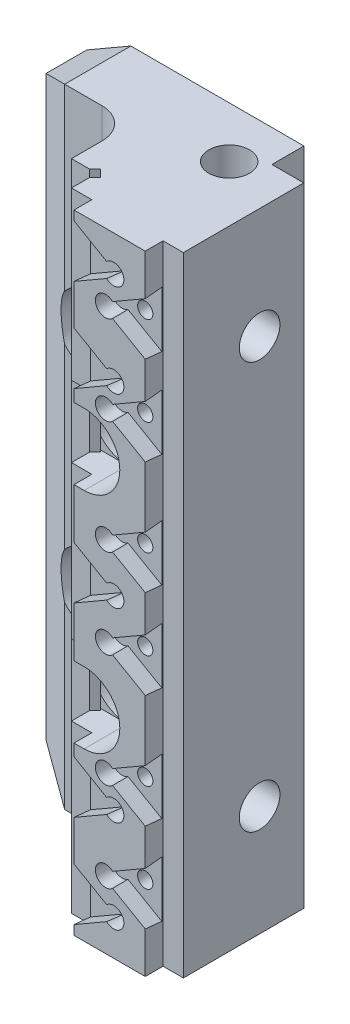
ISO-10303-21;
HEADER;
FILE_DESCRIPTION(('STEP AP214'),'2;1');
FILE_NAME('part.step','',(''),(''),'','','');
FILE_SCHEMA(('AUTOMOTIVE_DESIGN { 1 0 10303 214 1 1 1 1 }'));
ENDSEC;
DATA;
#1=APPLICATION_CONTEXT('core data for automotive mechanical design processes');
#2=APPLICATION_PROTOCOL_DEFINITION('international standard','automotive_design',2000,#1);
#3=PRODUCT_CONTEXT('',#1,'mechanical');
#4=PRODUCT('Part','Part','',(#3));
#5=PRODUCT_RELATED_PRODUCT_CATEGORY('part','',(#4));
#6=PRODUCT_DEFINITION_FORMATION('','',#4);
#7=PRODUCT_DEFINITION_CONTEXT('part definition',#1,'design');
#8=PRODUCT_DEFINITION('design','',#6,#7);
#9=PRODUCT_DEFINITION_SHAPE('','',#8);
#10=(LENGTH_UNIT() NAMED_UNIT(*) SI_UNIT(.MILLI.,.METRE.));
#11=(NAMED_UNIT(*) PLANE_ANGLE_UNIT() SI_UNIT($,.RADIAN.));
#12=(NAMED_UNIT(*) SI_UNIT($,.STERADIAN.) SOLID_ANGLE_UNIT());
#13=UNCERTAINTY_MEASURE_WITH_UNIT(LENGTH_MEASURE(1.E-05),#10,'distance_accuracy_value','');
#14=(GEOMETRIC_REPRESENTATION_CONTEXT(3) GLOBAL_UNCERTAINTY_ASSIGNED_CONTEXT((#13)) GLOBAL_UNIT_ASSIGNED_CONTEXT((#10,
#11,#12)) REPRESENTATION_CONTEXT('',''));
#15=CARTESIAN_POINT('',(0.,0.,0.));
#16=DIRECTION('',(0.,0.,1.));
#17=DIRECTION('',(1.,0.,0.));
#18=AXIS2_PLACEMENT_3D('',#15,#16,#17);
#19=CARTESIAN_POINT('',(-6.99999999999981,50.9,-4.));
#20=DIRECTION('',(1.,0.,0.));
#21=DIRECTION('',(0.,1.,0.));
#22=AXIS2_PLACEMENT_3D('',#19,#20,#21);
#23=PLANE('',#22);
#24=DIRECTION('',(0.,0.,1.));
#25=VECTOR('',#24,1.);
#26=CARTESIAN_POINT('',(-6.99999999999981,50.9,-4.));
#27=LINE('',#26,#25);
#28=CARTESIAN_POINT('',(-6.99999999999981,50.9,0.));
#29=VERTEX_POINT('',#28);
#30=CARTESIAN_POINT('',(-6.99999999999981,50.9,-4.));
#31=VERTEX_POINT('',#30);
#32=EDGE_CURVE('E974',#29,#31,#27,.F.);
#33=ORIENTED_EDGE('',*,*,#32,.T.);
#34=DIRECTION('',(0.,-1.,0.));
#35=VECTOR('',#34,1.);
#36=CARTESIAN_POINT('',(-6.99999999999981,50.9,-4.));
#37=LINE('',#36,#35);
#38=CARTESIAN_POINT('',(-7.,-6.9,-4.));
#39=VERTEX_POINT('',#38);
#40=EDGE_CURVE('E988',#31,#39,#37,.T.);
#41=ORIENTED_EDGE('',*,*,#40,.T.);
#42=DIRECTION('',(0.,0.,1.));
#43=VECTOR('',#42,1.);
#44=CARTESIAN_POINT('',(-7.,-6.9,-4.));
#45=LINE('',#44,#43);
#46=CARTESIAN_POINT('',(-7.,-6.9,0.));
#47=VERTEX_POINT('',#46);
#48=EDGE_CURVE('E977',#47,#39,#45,.F.);
#49=ORIENTED_EDGE('',*,*,#48,.F.);
#50=DIRECTION('',(0.,-1.,0.));
#51=VECTOR('',#50,1.);
#52=CARTESIAN_POINT('',(-7.00000000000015,-39.75,0.));
#53=LINE('',#52,#51);
#54=EDGE_CURVE('E654',#29,#47,#53,.T.);
#55=ORIENTED_EDGE('',*,*,#54,.F.);
#56=EDGE_LOOP('',(#33,#41,#49,#55));
#57=FACE_BOUND('',#56,.T.);
#58=ADVANCED_FACE('F19',(#57),#23,.F.);
#59=CARTESIAN_POINT('',(7.,-6.9,-4.));
#60=DIRECTION('',(0.,1.,0.));
#61=DIRECTION('',(0.,0.,-1.));
#62=AXIS2_PLACEMENT_3D('',#59,#60,#61);
#63=PLANE('',#62);
#64=ORIENTED_EDGE('',*,*,#48,.T.);
#65=DIRECTION('',(1.,0.,0.));
#66=VECTOR('',#65,1.);
#67=CARTESIAN_POINT('',(7.,-6.9,-4.));
#68=LINE('',#67,#66);
#69=CARTESIAN_POINT('',(7.,-6.9,-4.));
#70=VERTEX_POINT('',#69);
#71=EDGE_CURVE('E985',#39,#70,#68,.T.);
#72=ORIENTED_EDGE('',*,*,#71,.T.);
#73=DIRECTION('',(0.,0.,1.));
#74=VECTOR('',#73,1.);
#75=CARTESIAN_POINT('',(7.,-6.9,-4.));
#76=LINE('',#75,#74);
#77=CARTESIAN_POINT('',(7.,-6.9,0.));
#78=VERTEX_POINT('',#77);
#79=EDGE_CURVE('E967',#78,#70,#76,.F.);
#80=ORIENTED_EDGE('',*,*,#79,.F.);
#81=DIRECTION('',(-1.,0.,0.));
#82=VECTOR('',#81,1.);
#83=CARTESIAN_POINT('',(35.,-6.90000000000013,1.24672987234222E-13));
#84=LINE('',#83,#82);
#85=EDGE_CURVE('E1479',#47,#78,#84,.F.);
#86=ORIENTED_EDGE('',*,*,#85,.F.);
#87=EDGE_LOOP('',(#64,#72,#80,#86));
#88=FACE_BOUND('',#87,.T.);
#89=ADVANCED_FACE('F1776',(#88),#63,.F.);
#90=CARTESIAN_POINT('',(7.00000000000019,50.9,-4.));
#91=DIRECTION('',(-1.,0.,0.));
#92=DIRECTION('',(0.,-1.,0.));
#93=AXIS2_PLACEMENT_3D('',#90,#91,#92);
#94=PLANE('',#93);
#95=ORIENTED_EDGE('',*,*,#79,.T.);
#96=DIRECTION('',(0.,1.,0.));
#97=VECTOR('',#96,1.);
#98=CARTESIAN_POINT('',(7.00000000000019,50.9,-4.));
#99=LINE('',#98,#97);
#100=CARTESIAN_POINT('',(7.00000000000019,50.9,-4.));
#101=VERTEX_POINT('',#100);
#102=EDGE_CURVE('E983',#70,#101,#99,.T.);
#103=ORIENTED_EDGE('',*,*,#102,.T.);
#104=DIRECTION('',(0.,0.,1.));
#105=VECTOR('',#104,1.);
#106=CARTESIAN_POINT('',(7.00000000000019,50.9,-4.));
#107=LINE('',#106,#105);
#108=CARTESIAN_POINT('',(7.00000000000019,50.9,0.));
#109=VERTEX_POINT('',#108);
#110=EDGE_CURVE('E970',#109,#101,#107,.F.);
#111=ORIENTED_EDGE('',*,*,#110,.F.);
#112=DIRECTION('',(0.,-1.,0.));
#113=VECTOR('',#112,1.);
#114=CARTESIAN_POINT('',(6.99999999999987,-39.75,0.));
#115=LINE('',#114,#113);
#116=EDGE_CURVE('E1803',#78,#109,#115,.F.);
#117=ORIENTED_EDGE('',*,*,#116,.F.);
#118=EDGE_LOOP('',(#95,#103,#111,#117));
#119=FACE_BOUND('',#118,.T.);
#120=ADVANCED_FACE('F1783',(#119),#94,.F.);
#121=CARTESIAN_POINT('',(7.00000000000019,50.9,-4.));
#122=DIRECTION('',(0.,-1.,0.));
#123=DIRECTION('',(0.,0.,1.));
#124=AXIS2_PLACEMENT_3D('',#121,#122,#123);
#125=PLANE('',#124);
#126=ORIENTED_EDGE('',*,*,#110,.T.);
#127=DIRECTION('',(-1.,0.,0.));
#128=VECTOR('',#127,1.);
#129=CARTESIAN_POINT('',(7.00000000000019,50.9,-4.));
#130=LINE('',#129,#128);
#131=EDGE_CURVE('E980',#101,#31,#130,.T.);
#132=ORIENTED_EDGE('',*,*,#131,.T.);
#133=ORIENTED_EDGE('',*,*,#32,.F.);
#134=DIRECTION('',(-1.,0.,0.));
#135=VECTOR('',#134,1.);
#136=CARTESIAN_POINT('',(35.,50.9,1.19636492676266E-13));
#137=LINE('',#136,#135);
#138=EDGE_CURVE('E1811',#109,#29,#137,.T.);
#139=ORIENTED_EDGE('',*,*,#138,.F.);
#140=EDGE_LOOP('',(#126,#132,#133,#139));
#141=FACE_BOUND('',#140,.T.);
#142=ADVANCED_FACE('F1789',(#141),#125,.F.);
#143=CARTESIAN_POINT('',(29.,22.,13.0000000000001));
#144=DIRECTION('',(0.,0.,1.));
#145=DIRECTION('',(-1.,0.,0.));
#146=AXIS2_PLACEMENT_3D('',#143,#144,#145);
#147=PLANE('',#146);
#148=DIRECTION('',(0.,-1.,0.));
#149=VECTOR('',#148,1.);
#150=CARTESIAN_POINT('',(-5.33974596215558,22.,13.));
#151=LINE('',#150,#149);
#152=CARTESIAN_POINT('',(-5.33974596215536,83.75,13.));
#153=VERTEX_POINT('',#152);
#154=CARTESIAN_POINT('',(-5.33974596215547,48.5262692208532,13.));
#155=VERTEX_POINT('',#154);
#156=EDGE_CURVE('E868',#153,#155,#151,.T.);
#157=ORIENTED_EDGE('',*,*,#156,.T.);
#158=CARTESIAN_POINT('',(1.11022302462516E-13,44.,13.));
#159=DIRECTION('',(0.,0.,1.));
#160=DIRECTION('',(-1.,0.,0.));
#161=AXIS2_PLACEMENT_3D('',#158,#159,#160);
#162=CIRCLE('',#161,7.);
#163=CARTESIAN_POINT('',(2.00000000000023,50.7082039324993,13.));
#164=VERTEX_POINT('',#163);
#165=EDGE_CURVE('E922',#164,#155,#162,.T.);
#166=ORIENTED_EDGE('',*,*,#165,.F.);
#167=DIRECTION('',(0.,1.,0.));
#168=VECTOR('',#167,1.);
#169=CARTESIAN_POINT('',(2.00000000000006,22.,13.));
#170=LINE('',#169,#168);
#171=CARTESIAN_POINT('',(2.00000000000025,83.75,13.));
#172=VERTEX_POINT('',#171);
#173=EDGE_CURVE('E877',#164,#172,#170,.T.);
#174=ORIENTED_EDGE('',*,*,#173,.T.);
#175=DIRECTION('',(-1.,0.,0.));
#176=VECTOR('',#175,1.);
#177=CARTESIAN_POINT('',(29.,83.75,13.0000000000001));
#178=LINE('',#177,#176);
#179=EDGE_CURVE('E772',#153,#172,#178,.F.);
#180=ORIENTED_EDGE('',*,*,#179,.F.);
#181=EDGE_LOOP('',(#157,#166,#174,#180));
#182=FACE_BOUND('',#181,.T.);
#183=ADVANCED_FACE('F1792',(#182),#147,.T.);
#184=CARTESIAN_POINT('',(0.,44.,25.));
#185=DIRECTION('',(0.,0.,1.));
#186=DIRECTION('',(-1.,0.,0.));
#187=AXIS2_PLACEMENT_3D('',#184,#185,#186);
#188=CYLINDRICAL_SURFACE('',#187,4.5);
#189=CARTESIAN_POINT('',(1.38777878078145E-13,44.,4.));
#190=DIRECTION('',(0.,0.,1.));
#191=DIRECTION('',(-1.,0.,0.));
#192=AXIS2_PLACEMENT_3D('',#189,#190,#191);
#193=CIRCLE('',#192,4.5);
#194=CARTESIAN_POINT('',(-4.49999999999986,44.,3.99999999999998));
#195=VERTEX_POINT('',#194);
#196=EDGE_CURVE('E1036',#195,#195,#193,.F.);
#197=ORIENTED_EDGE('',*,*,#196,.F.);
#198=EDGE_LOOP('',(#197));
#199=FACE_BOUND('',#198,.T.);
#200=CARTESIAN_POINT('',(1.66533453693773E-13,44.,-4.));
#201=DIRECTION('',(0.,0.,1.));
#202=DIRECTION('',(0.,1.,0.));
#203=AXIS2_PLACEMENT_3D('',#200,#201,#202);
#204=CIRCLE('',#203,4.5);
#205=CARTESIAN_POINT('',(1.8284361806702E-13,48.5,-4.));
#206=VERTEX_POINT('',#205);
#207=EDGE_CURVE('E928',#206,#206,#204,.F.);
#208=ORIENTED_EDGE('',*,*,#207,.T.);
#209=EDGE_LOOP('',(#208));
#210=FACE_BOUND('',#209,.T.);
#211=ADVANCED_FACE('F1755',(#199,#210),#188,.F.);
#212=CARTESIAN_POINT('',(1.38777878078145E-13,39.5,4.));
#213=DIRECTION('',(0.,0.,-1.));
#214=DIRECTION('',(1.,0.,0.));
#215=AXIS2_PLACEMENT_3D('',#212,#213,#214);
#216=PLANE('',#215);
#217=CARTESIAN_POINT('',(1.38777878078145E-13,44.,4.));
#218=DIRECTION('',(0.,0.,1.));
#219=DIRECTION('',(-1.,0.,0.));
#220=AXIS2_PLACEMENT_3D('',#217,#218,#219);
#221=CIRCLE('',#220,7.);
#222=CARTESIAN_POINT('',(-6.99999999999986,44.,3.99999999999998));
#223=VERTEX_POINT('',#222);
#224=EDGE_CURVE('E647',#223,#223,#221,.T.);
#225=ORIENTED_EDGE('',*,*,#224,.T.);
#226=EDGE_LOOP('',(#225));
#227=FACE_BOUND('',#226,.T.);
#228=ORIENTED_EDGE('',*,*,#196,.T.);
#229=EDGE_LOOP('',(#228));
#230=FACE_BOUND('',#229,.T.);
#231=ADVANCED_FACE('F910',(#227,#230),#216,.F.);
#232=CARTESIAN_POINT('',(0.,44.,25.));
#233=DIRECTION('',(0.,0.,1.));
#234=DIRECTION('',(-1.,0.,0.));
#235=AXIS2_PLACEMENT_3D('',#232,#233,#234);
#236=CYLINDRICAL_SURFACE('',#235,7.);
#237=ORIENTED_EDGE('',*,*,#224,.F.);
#238=EDGE_LOOP('',(#237));
#239=FACE_BOUND('',#238,.T.);
#240=CARTESIAN_POINT('',(1.11022302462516E-13,44.,16.0829037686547));
#241=DIRECTION('',(0.5,0.,-0.866025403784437));
#242=DIRECTION('',(0.866025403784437,0.,0.5));
#243=AXIS2_PLACEMENT_3D('',#240,#241,#242);
#244=ELLIPSE('',#243,8.08290376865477,7.);
#245=CARTESIAN_POINT('',(-5.3397459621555,39.4737307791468,13.));
#246=VERTEX_POINT('',#245);
#247=EDGE_CURVE('E924',#155,#246,#244,.F.);
#248=ORIENTED_EDGE('',*,*,#247,.T.);
#249=CARTESIAN_POINT('',(1.11022302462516E-13,44.,13.));
#250=DIRECTION('',(0.,0.,1.));
#251=DIRECTION('',(-1.,0.,0.));
#252=AXIS2_PLACEMENT_3D('',#249,#250,#251);
#253=CIRCLE('',#252,7.);
#254=CARTESIAN_POINT('',(2.00000000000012,37.2917960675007,13.));
#255=VERTEX_POINT('',#254);
#256=EDGE_CURVE('E921',#246,#255,#253,.T.);
#257=ORIENTED_EDGE('',*,*,#256,.T.);
#258=CARTESIAN_POINT('',(2.00000000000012,37.2917960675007,13.));
#259=CARTESIAN_POINT('',(2.15357726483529,37.3375426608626,12.9999688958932));
#260=CARTESIAN_POINT('',(2.30547969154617,37.3886126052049,13.0058942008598));
#261=CARTESIAN_POINT('',(2.60452746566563,37.5006349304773,13.0286602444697));
#262=CARTESIAN_POINT('',(2.75167910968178,37.5615735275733,13.0454858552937));
#263=CARTESIAN_POINT('',(3.03879404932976,37.6920378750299,13.0888406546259));
#264=CARTESIAN_POINT('',(3.17881489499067,37.7614707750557,13.1152702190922));
#265=CARTESIAN_POINT('',(3.45245586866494,37.9086367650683,13.1767660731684));
#266=CARTESIAN_POINT('',(3.58607390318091,37.9863725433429,13.2118351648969));
#267=CARTESIAN_POINT('',(3.97488712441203,38.2299624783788,13.3279084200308));
#268=CARTESIAN_POINT('',(4.21985791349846,38.4070366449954,13.4200783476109));
#269=CARTESIAN_POINT('',(4.68042275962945,38.7862521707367,13.6260524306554));
#270=CARTESIAN_POINT('',(4.89591231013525,38.9884780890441,13.7399302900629));
#271=CARTESIAN_POINT('',(5.24347335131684,39.35756859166,13.9493104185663));
#272=CARTESIAN_POINT('',(5.38255154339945,39.5196815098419,14.0417312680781));
#273=CARTESIAN_POINT('',(5.644393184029,39.8543988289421,14.2308822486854));
#274=CARTESIAN_POINT('',(5.76714812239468,40.0270086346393,14.3276145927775));
#275=CARTESIAN_POINT('',(5.99639370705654,40.3822678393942,14.5221166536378));
#276=CARTESIAN_POINT('',(6.10287672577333,40.5649218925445,14.6198868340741));
#277=CARTESIAN_POINT('',(6.29939702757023,40.9401873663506,14.8126283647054));
#278=CARTESIAN_POINT('',(6.38944331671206,41.1327932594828,14.9076012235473));
#279=CARTESIAN_POINT('',(6.52161419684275,41.4532187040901,15.0552851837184));
#280=CARTESIAN_POINT('',(6.56894003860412,41.5778196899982,15.110332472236));
#281=CARTESIAN_POINT('',(6.65688744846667,41.8311578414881,15.2160694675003));
#282=CARTESIAN_POINT('',(6.69750737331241,41.9598960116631,15.2667581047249));
#283=CARTESIAN_POINT('',(6.80860840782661,42.3518910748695,15.409490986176));
#284=CARTESIAN_POINT('',(6.86871096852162,42.621836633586,15.4926461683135));
#285=CARTESIAN_POINT('',(6.93036551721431,43.0087928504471,15.5805789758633));
#286=CARTESIAN_POINT('',(6.94537707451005,43.1199605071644,15.6023939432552));
#287=CARTESIAN_POINT('',(6.97010880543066,43.3440535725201,15.6386756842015));
#288=CARTESIAN_POINT('',(6.9798316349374,43.456978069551,15.6531461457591));
#289=CARTESIAN_POINT('',(6.99377573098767,43.6837797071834,15.6739866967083));
#290=CARTESIAN_POINT('',(6.99800359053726,43.797655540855,15.680366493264));
#291=CARTESIAN_POINT('',(7.00088123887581,44.0256426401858,15.6847030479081));
#292=CARTESIAN_POINT('',(6.99953096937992,44.1397539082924,15.6826597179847));
#293=CARTESIAN_POINT('',(6.99129008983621,44.3671249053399,15.6702736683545));
#294=CARTESIAN_POINT('',(6.9844088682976,44.4803857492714,15.6599450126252));
#295=CARTESIAN_POINT('',(6.96527521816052,44.7054953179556,15.6315688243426));
#296=CARTESIAN_POINT('',(6.95302043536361,44.8173434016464,15.6135179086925));
#297=CARTESIAN_POINT('',(6.90847715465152,45.1502439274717,15.5489700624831));
#298=CARTESIAN_POINT('',(6.86842324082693,45.3683087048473,15.4921011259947));
#299=CARTESIAN_POINT('',(6.77836883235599,45.7568220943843,15.3706986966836));
#300=CARTESIAN_POINT('',(6.73129278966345,45.9289760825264,15.3091988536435));
#301=CARTESIAN_POINT('',(6.6253670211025,46.2662162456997,15.1772855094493));
#302=CARTESIAN_POINT('',(6.56650909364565,46.4312973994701,15.1068658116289));
#303=CARTESIAN_POINT('',(6.43748182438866,46.7548592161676,14.9604078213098));
#304=CARTESIAN_POINT('',(6.36728632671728,46.9133235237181,14.8843567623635));
#305=CARTESIAN_POINT('',(6.21600923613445,47.2235056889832,14.7295215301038));
#306=CARTESIAN_POINT('',(6.13493008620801,47.3752250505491,14.6507379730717));
#307=CARTESIAN_POINT('',(5.95578699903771,47.6827287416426,14.4869616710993));
#308=CARTESIAN_POINT('',(5.8569224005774,47.8380256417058,14.4019284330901));
#309=CARTESIAN_POINT('',(5.64678587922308,48.140990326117,14.2335447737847));
#310=CARTESIAN_POINT('',(5.53551224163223,48.288657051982,14.1501945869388));
#311=CARTESIAN_POINT('',(5.30064140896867,48.5757534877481,13.98740188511));
#312=CARTESIAN_POINT('',(5.17706294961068,48.7151952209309,13.9079536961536));
#313=CARTESIAN_POINT('',(4.91745000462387,48.985361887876,13.7548846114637));
#314=CARTESIAN_POINT('',(4.78141500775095,49.1160864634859,13.6812639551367));
#315=CARTESIAN_POINT('',(4.41004155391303,49.4447066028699,13.4994028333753));
#316=CARTESIAN_POINT('',(4.1646484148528,49.6350699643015,13.3973571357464));
#317=CARTESIAN_POINT('',(3.77425807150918,49.8974202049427,13.2666897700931));
#318=CARTESIAN_POINT('',(3.64053921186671,49.9809408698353,13.2268928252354));
#319=CARTESIAN_POINT('',(3.36606050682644,50.1396020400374,13.1558631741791));
#320=CARTESIAN_POINT('',(3.22530447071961,50.2147470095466,13.1246258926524));
#321=CARTESIAN_POINT('',(2.96028129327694,50.3446784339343,13.0760627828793));
#322=CARTESIAN_POINT('',(2.83692831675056,50.400804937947,13.0573179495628));
#323=CARTESIAN_POINT('',(2.5864047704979,50.50607145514,13.0273925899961));
#324=CARTESIAN_POINT('',(2.45923529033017,50.5552134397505,13.0162099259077));
#325=CARTESIAN_POINT('',(2.20084462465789,50.6464400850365,13.0019581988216));
#326=CARTESIAN_POINT('',(2.06960007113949,50.6884685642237,12.9989511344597));
#327=CARTESIAN_POINT('',(1.80483361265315,50.7647378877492,13.0017058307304));
#328=CARTESIAN_POINT('',(1.67130973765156,50.7989715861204,13.0074756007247));
#329=CARTESIAN_POINT('',(1.53719123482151,50.8291319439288,13.0178759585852));
#330=B_SPLINE_CURVE_WITH_KNOTS('',3,(#258,#259,#260,#261,#262,#263,#264,#265,#266,#267,#268,
#269,#270,#271,#272,#273,#274,#275,#276,#277,#278,#279,#280,#281,#282,#283,#284,#285,#286,#287,
#288,#289,#290,#291,#292,#293,#294,#295,#296,#297,#298,#299,#300,#301,#302,#303,#304,#305,#306,
#307,#308,#309,#310,#311,#312,#313,#314,#315,#316,#317,#318,#319,#320,#321,#322,#323,#324,#325,
#326,#327,#328,#329),.UNSPECIFIED.,.F.,.F.,(4,2,2,2,2,2,2,2,2,2,2,2,2,2,2,2,2,2,2,2,2,2,2,2,2,2,
2,2,2,2,2,2,2,2,2,4),(0.,0.480405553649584,0.960145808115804,1.43504538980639,1.91009920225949,
2.85421315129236,3.80159161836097,4.49895876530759,5.19668807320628,5.89474345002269,
6.59241519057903,7.02475734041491,7.45720527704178,8.31888218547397,8.66142698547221,
9.00379960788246,9.34576106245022,9.68772609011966,10.0291118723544,10.3706473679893,
11.0547413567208,11.6203457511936,12.1863452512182,12.7536696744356,13.3208669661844,
13.9286975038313,14.5366121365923,15.1436148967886,15.7506425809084,16.7270602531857,
17.2144082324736,17.7014952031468,18.1115254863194,18.5214398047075,18.9344540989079,
19.3478455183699),.UNSPECIFIED.);
#331=EDGE_CURVE('E915',#255,#164,#330,.T.);
#332=ORIENTED_EDGE('',*,*,#331,.T.);
#333=ORIENTED_EDGE('',*,*,#165,.T.);
#334=EDGE_LOOP('',(#248,#257,#332,#333));
#335=FACE_BOUND('',#334,.T.);
#336=ADVANCED_FACE('F905',(#239,#335),#236,.F.);
#337=CARTESIAN_POINT('',(0.,0.,13.));
#338=DIRECTION('',(0.,0.,1.));
#339=DIRECTION('',(-1.,0.,0.));
#340=AXIS2_PLACEMENT_3D('',#337,#338,#339);
#341=CIRCLE('',#340,7.);
#342=CARTESIAN_POINT('',(-5.33974596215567,-4.52626922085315,13.));
#343=VERTEX_POINT('',#342);
#344=CARTESIAN_POINT('',(1.99999999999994,-6.70820393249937,13.));
#345=VERTEX_POINT('',#344);
#346=EDGE_CURVE('E971',#343,#345,#341,.T.);
#347=ORIENTED_EDGE('',*,*,#346,.F.);
#348=CARTESIAN_POINT('',(-5.33974596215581,-39.75,13.));
#349=VERTEX_POINT('',#348);
#350=EDGE_CURVE('E889',#343,#349,#151,.T.);
#351=ORIENTED_EDGE('',*,*,#350,.T.);
#352=DIRECTION('',(-1.,0.,0.));
#353=VECTOR('',#352,1.);
#354=CARTESIAN_POINT('',(35.,-39.75,13.0000000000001));
#355=LINE('',#354,#353);
#356=CARTESIAN_POINT('',(1.99999999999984,-39.75,13.));
#357=VERTEX_POINT('',#356);
#358=EDGE_CURVE('E742',#349,#357,#355,.F.);
#359=ORIENTED_EDGE('',*,*,#358,.T.);
#360=EDGE_CURVE('E861',#357,#345,#170,.T.);
#361=ORIENTED_EDGE('',*,*,#360,.T.);
#362=EDGE_LOOP('',(#347,#351,#359,#361));
#363=FACE_BOUND('',#362,.T.);
#364=ADVANCED_FACE('F909',(#363),#147,.T.);
#365=CARTESIAN_POINT('',(2.,6.70820393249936,13.));
#366=VERTEX_POINT('',#365);
#367=EDGE_CURVE('E865',#366,#255,#170,.T.);
#368=ORIENTED_EDGE('',*,*,#367,.T.);
#369=ORIENTED_EDGE('',*,*,#256,.F.);
#370=CARTESIAN_POINT('',(-5.33974596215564,4.52626922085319,13.));
#371=VERTEX_POINT('',#370);
#372=EDGE_CURVE('E963',#246,#371,#151,.T.);
#373=ORIENTED_EDGE('',*,*,#372,.T.);
#374=EDGE_CURVE('E3105',#366,#371,#341,.T.);
#375=ORIENTED_EDGE('',*,*,#374,.F.);
#376=EDGE_LOOP('',(#368,#369,#373,#375));
#377=FACE_BOUND('',#376,.T.);
#378=ADVANCED_FACE('F1748',(#377),#147,.T.);
#379=CARTESIAN_POINT('',(25.32,-32.75,30.25));
#380=DIRECTION('',(0.,0.,-1.));
#381=DIRECTION('',(0.,-1.,0.));
#382=AXIS2_PLACEMENT_3D('',#379,#380,#381);
#383=PLANE('',#382);
#384=CARTESIAN_POINT('',(20.2500000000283,-32.75,30.25));
#385=DIRECTION('',(0.,0.,1.));
#386=DIRECTION('',(1.,0.,0.));
#387=AXIS2_PLACEMENT_3D('',#384,#385,#386);
#388=CIRCLE('',#387,1.5);
#389=CARTESIAN_POINT('',(21.7500000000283,-32.75,30.25));
#390=VERTEX_POINT('',#389);
#391=EDGE_CURVE('E3515',#390,#390,#388,.T.);
#392=ORIENTED_EDGE('',*,*,#391,.F.);
#393=EDGE_LOOP('',(#392));
#394=FACE_BOUND('',#393,.T.);
#395=DIRECTION('',(0.866025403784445,0.49999999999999,0.));
#396=VECTOR('',#395,1.);
#397=CARTESIAN_POINT('',(25.6137443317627,-33.258780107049,30.25));
#398=LINE('',#397,#396);
#399=CARTESIAN_POINT('',(17.,-38.2319277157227,30.25));
#400=VERTEX_POINT('',#399);
#401=CARTESIAN_POINT('',(23.6548841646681,-34.3897285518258,30.25));
#402=VERTEX_POINT('',#401);
#403=EDGE_CURVE('E1148',#400,#402,#398,.T.);
#404=ORIENTED_EDGE('',*,*,#403,.T.);
#405=CARTESIAN_POINT('',(24.8,-32.75,30.25));
#406=DIRECTION('',(0.,0.,1.));
#407=DIRECTION('',(1.,0.,0.));
#408=AXIS2_PLACEMENT_3D('',#405,#406,#407);
#409=CIRCLE('',#408,2.);
#410=CARTESIAN_POINT('',(23.6548841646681,-31.1102714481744,30.25));
#411=VERTEX_POINT('',#410);
#412=EDGE_CURVE('E2197',#402,#411,#409,.T.);
#413=ORIENTED_EDGE('',*,*,#412,.T.);
#414=DIRECTION('',(-0.866025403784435,0.500000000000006,0.));
#415=VECTOR('',#414,1.);
#416=CARTESIAN_POINT('',(16.0437443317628,-26.7159778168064,30.25));
#417=LINE('',#416,#415);
#418=CARTESIAN_POINT('',(17.,-27.2680722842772,30.25));
#419=VERTEX_POINT('',#418);
#420=EDGE_CURVE('E1167',#411,#419,#417,.T.);
#421=ORIENTED_EDGE('',*,*,#420,.T.);
#422=DIRECTION('',(0.,1.,0.));
#423=VECTOR('',#422,1.);
#424=CARTESIAN_POINT('',(17.,83.75,30.25));
#425=LINE('',#424,#423);
#426=EDGE_CURVE('E1164',#419,#400,#425,.F.);
#427=ORIENTED_EDGE('',*,*,#426,.T.);
#428=EDGE_LOOP('',(#404,#413,#421,#427));
#429=FACE_BOUND('',#428,.T.);
#430=ADVANCED_FACE('F1744',(#394,#429),#383,.F.);
#431=CARTESIAN_POINT('',(25.32,-14.5000000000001,30.25));
#432=DIRECTION('',(0.,0.,-1.));
#433=DIRECTION('',(0.,-1.,0.));
#434=AXIS2_PLACEMENT_3D('',#431,#432,#433);
#435=PLANE('',#434);
#436=CARTESIAN_POINT('',(20.249999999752,-14.5,30.25));
#437=DIRECTION('',(0.,0.,1.));
#438=DIRECTION('',(1.,0.,0.));
#439=AXIS2_PLACEMENT_3D('',#436,#437,#438);
#440=CIRCLE('',#439,1.5);
#441=CARTESIAN_POINT('',(21.7499999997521,-14.5,30.25));
#442=VERTEX_POINT('',#441);
#443=EDGE_CURVE('E3503',#442,#442,#440,.T.);
#444=ORIENTED_EDGE('',*,*,#443,.F.);
#445=EDGE_LOOP('',(#444));
#446=FACE_BOUND('',#445,.T.);
#447=DIRECTION('',(0.866025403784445,0.49999999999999,0.));
#448=VECTOR('',#447,1.);
#449=CARTESIAN_POINT('',(25.6137443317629,-15.008780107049,30.25));
#450=LINE('',#449,#448);
#451=CARTESIAN_POINT('',(17.,-19.9819277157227,30.25));
#452=VERTEX_POINT('',#451);
#453=CARTESIAN_POINT('',(23.6548841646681,-16.1397285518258,30.25));
#454=VERTEX_POINT('',#453);
#455=EDGE_CURVE('E1188',#452,#454,#450,.T.);
#456=ORIENTED_EDGE('',*,*,#455,.T.);
#457=CARTESIAN_POINT('',(24.8,-14.5,30.25));
#458=DIRECTION('',(0.,0.,1.));
#459=DIRECTION('',(1.,0.,0.));
#460=AXIS2_PLACEMENT_3D('',#457,#458,#459);
#461=CIRCLE('',#460,2.);
#462=CARTESIAN_POINT('',(23.6548841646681,-12.8602714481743,30.25));
#463=VERTEX_POINT('',#462);
#464=EDGE_CURVE('E2193',#454,#463,#461,.T.);
#465=ORIENTED_EDGE('',*,*,#464,.T.);
#466=DIRECTION('',(-0.866025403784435,0.500000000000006,0.));
#467=VECTOR('',#466,1.);
#468=CARTESIAN_POINT('',(16.0437443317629,-8.46597781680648,30.25));
#469=LINE('',#468,#467);
#470=CARTESIAN_POINT('',(17.,-9.01807228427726,30.25));
#471=VERTEX_POINT('',#470);
#472=EDGE_CURVE('E1194',#463,#471,#469,.T.);
#473=ORIENTED_EDGE('',*,*,#472,.T.);
#474=DIRECTION('',(0.,1.,0.));
#475=VECTOR('',#474,1.);
#476=CARTESIAN_POINT('',(17.,83.75,30.25));
#477=LINE('',#476,#475);
#478=EDGE_CURVE('E1021',#471,#452,#477,.F.);
#479=ORIENTED_EDGE('',*,*,#478,.T.);
#480=EDGE_LOOP('',(#456,#465,#473,#479));
#481=FACE_BOUND('',#480,.T.);
#482=ADVANCED_FACE('F1747',(#446,#481),#435,.F.);
#483=CARTESIAN_POINT('',(25.32,22.,30.25));
#484=DIRECTION('',(0.,0.,-1.));
#485=DIRECTION('',(0.,-1.,0.));
#486=AXIS2_PLACEMENT_3D('',#483,#484,#485);
#487=PLANE('',#486);
#488=CARTESIAN_POINT('',(20.25,22.,30.25));
#489=DIRECTION('',(0.,0.,1.));
#490=DIRECTION('',(1.,0.,0.));
#491=AXIS2_PLACEMENT_3D('',#488,#489,#490);
#492=CIRCLE('',#491,1.5);
#493=CARTESIAN_POINT('',(21.75,22.,30.25));
#494=VERTEX_POINT('',#493);
#495=EDGE_CURVE('E3485',#494,#494,#492,.T.);
#496=ORIENTED_EDGE('',*,*,#495,.F.);
#497=EDGE_LOOP('',(#496));
#498=FACE_BOUND('',#497,.T.);
#499=DIRECTION('',(0.866025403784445,0.49999999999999,0.));
#500=VECTOR('',#499,1.);
#501=CARTESIAN_POINT('',(25.613744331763,21.491219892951,30.25));
#502=LINE('',#501,#500);
#503=CARTESIAN_POINT('',(17.,16.5180722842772,30.25));
#504=VERTEX_POINT('',#503);
#505=CARTESIAN_POINT('',(23.6548841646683,20.3602714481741,30.25));
#506=VERTEX_POINT('',#505);
#507=EDGE_CURVE('E1208',#504,#506,#502,.T.);
#508=ORIENTED_EDGE('',*,*,#507,.T.);
#509=CARTESIAN_POINT('',(24.8,22.,30.25));
#510=DIRECTION('',(0.,0.,1.));
#511=DIRECTION('',(1.,0.,0.));
#512=AXIS2_PLACEMENT_3D('',#509,#510,#511);
#513=CIRCLE('',#512,2.);
#514=CARTESIAN_POINT('',(23.6548841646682,23.6397285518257,30.25));
#515=VERTEX_POINT('',#514);
#516=EDGE_CURVE('E2187',#506,#515,#513,.T.);
#517=ORIENTED_EDGE('',*,*,#516,.T.);
#518=DIRECTION('',(-0.866025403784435,0.500000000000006,0.));
#519=VECTOR('',#518,1.);
#520=CARTESIAN_POINT('',(16.043744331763,28.0340221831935,30.25));
#521=LINE('',#520,#519);
#522=CARTESIAN_POINT('',(17.,27.4819277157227,30.25));
#523=VERTEX_POINT('',#522);
#524=EDGE_CURVE('E1224',#515,#523,#521,.T.);
#525=ORIENTED_EDGE('',*,*,#524,.T.);
#526=DIRECTION('',(0.,1.,0.));
#527=VECTOR('',#526,1.);
#528=CARTESIAN_POINT('',(17.,83.75,30.25));
#529=LINE('',#528,#527);
#530=EDGE_CURVE('E1221',#523,#504,#529,.F.);
#531=ORIENTED_EDGE('',*,*,#530,.T.);
#532=EDGE_LOOP('',(#508,#517,#525,#531));
#533=FACE_BOUND('',#532,.T.);
#534=ADVANCED_FACE('F1738',(#498,#533),#487,.F.);
#535=CARTESIAN_POINT('',(25.32,58.5,30.25));
#536=DIRECTION('',(0.,0.,-1.));
#537=DIRECTION('',(0.,-1.,0.));
#538=AXIS2_PLACEMENT_3D('',#535,#536,#537);
#539=PLANE('',#538);
#540=CARTESIAN_POINT('',(20.2499999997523,58.5,30.25));
#541=DIRECTION('',(0.,0.,1.));
#542=DIRECTION('',(1.,0.,0.));
#543=AXIS2_PLACEMENT_3D('',#540,#541,#542);
#544=CIRCLE('',#543,1.5);
#545=CARTESIAN_POINT('',(21.7499999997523,58.5,30.25));
#546=VERTEX_POINT('',#545);
#547=EDGE_CURVE('E3467',#546,#546,#544,.T.);
#548=ORIENTED_EDGE('',*,*,#547,.F.);
#549=EDGE_LOOP('',(#548));
#550=FACE_BOUND('',#549,.T.);
#551=DIRECTION('',(0.866025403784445,0.49999999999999,0.));
#552=VECTOR('',#551,1.);
#553=CARTESIAN_POINT('',(25.6137443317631,57.9912198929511,30.25));
#554=LINE('',#553,#552);
#555=CARTESIAN_POINT('',(17.,53.0180722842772,30.25));
#556=VERTEX_POINT('',#555);
#557=CARTESIAN_POINT('',(23.6548841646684,56.8602714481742,30.25));
#558=VERTEX_POINT('',#557);
#559=EDGE_CURVE('E1241',#556,#558,#554,.T.);
#560=ORIENTED_EDGE('',*,*,#559,.T.);
#561=CARTESIAN_POINT('',(24.8,58.5,30.25));
#562=DIRECTION('',(0.,0.,1.));
#563=DIRECTION('',(1.,0.,0.));
#564=AXIS2_PLACEMENT_3D('',#561,#562,#563);
#565=CIRCLE('',#564,2.);
#566=CARTESIAN_POINT('',(23.6548841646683,60.1397285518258,30.25));
#567=VERTEX_POINT('',#566);
#568=EDGE_CURVE('E2179',#558,#567,#565,.T.);
#569=ORIENTED_EDGE('',*,*,#568,.T.);
#570=DIRECTION('',(-0.866025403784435,0.500000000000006,0.));
#571=VECTOR('',#570,1.);
#572=CARTESIAN_POINT('',(16.0437443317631,64.5340221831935,30.25));
#573=LINE('',#572,#571);
#574=CARTESIAN_POINT('',(17.,63.9819277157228,30.25));
#575=VERTEX_POINT('',#574);
#576=EDGE_CURVE('E1257',#567,#575,#573,.T.);
#577=ORIENTED_EDGE('',*,*,#576,.T.);
#578=DIRECTION('',(0.,1.,0.));
#579=VECTOR('',#578,1.);
#580=CARTESIAN_POINT('',(17.,83.75,30.25));
#581=LINE('',#580,#579);
#582=EDGE_CURVE('E1254',#575,#556,#581,.F.);
#583=ORIENTED_EDGE('',*,*,#582,.T.);
#584=EDGE_LOOP('',(#560,#569,#577,#583));
#585=FACE_BOUND('',#584,.T.);
#586=ADVANCED_FACE('F1735',(#550,#585),#539,.F.);
#587=CARTESIAN_POINT('',(25.32,76.75,30.25));
#588=DIRECTION('',(0.,0.,-1.));
#589=DIRECTION('',(0.,-1.,0.));
#590=AXIS2_PLACEMENT_3D('',#587,#588,#589);
#591=PLANE('',#590);
#592=CARTESIAN_POINT('',(20.2500000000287,76.75,30.25));
#593=DIRECTION('',(0.,0.,1.));
#594=DIRECTION('',(1.,0.,0.));
#595=AXIS2_PLACEMENT_3D('',#592,#593,#594);
#596=CIRCLE('',#595,1.5);
#597=CARTESIAN_POINT('',(21.7500000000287,76.75,30.25));
#598=VERTEX_POINT('',#597);
#599=EDGE_CURVE('E3458',#598,#598,#596,.T.);
#600=ORIENTED_EDGE('',*,*,#599,.F.);
#601=EDGE_LOOP('',(#600));
#602=FACE_BOUND('',#601,.T.);
#603=DIRECTION('',(0.866025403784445,0.49999999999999,0.));
#604=VECTOR('',#603,1.);
#605=CARTESIAN_POINT('',(25.6137443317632,76.2412198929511,30.25));
#606=LINE('',#605,#604);
#607=CARTESIAN_POINT('',(17.,71.2680722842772,30.25));
#608=VERTEX_POINT('',#607);
#609=CARTESIAN_POINT('',(23.6548841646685,75.1102714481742,30.25));
#610=VERTEX_POINT('',#609);
#611=EDGE_CURVE('E619',#608,#610,#606,.T.);
#612=ORIENTED_EDGE('',*,*,#611,.T.);
#613=CARTESIAN_POINT('',(24.8,76.75,30.25));
#614=DIRECTION('',(0.,0.,1.));
#615=DIRECTION('',(1.,0.,0.));
#616=AXIS2_PLACEMENT_3D('',#613,#614,#615);
#617=CIRCLE('',#616,2.);
#618=CARTESIAN_POINT('',(23.6548841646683,78.3897285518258,30.25));
#619=VERTEX_POINT('',#618);
#620=EDGE_CURVE('E613',#610,#619,#617,.T.);
#621=ORIENTED_EDGE('',*,*,#620,.T.);
#622=DIRECTION('',(-0.866025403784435,0.500000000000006,0.));
#623=VECTOR('',#622,1.);
#624=CARTESIAN_POINT('',(16.0437443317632,82.7840221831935,30.25));
#625=LINE('',#624,#623);
#626=CARTESIAN_POINT('',(17.,82.2319277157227,30.25));
#627=VERTEX_POINT('',#626);
#628=EDGE_CURVE('E616',#619,#627,#625,.T.);
#629=ORIENTED_EDGE('',*,*,#628,.T.);
#630=DIRECTION('',(0.,1.,0.));
#631=VECTOR('',#630,1.);
#632=CARTESIAN_POINT('',(17.,83.75,30.25));
#633=LINE('',#632,#631);
#634=EDGE_CURVE('E1275',#627,#608,#633,.F.);
#635=ORIENTED_EDGE('',*,*,#634,.T.);
#636=EDGE_LOOP('',(#612,#621,#629,#635));
#637=FACE_BOUND('',#636,.T.);
#638=ADVANCED_FACE('F615',(#602,#637),#591,.F.);
#639=CARTESIAN_POINT('',(35.,83.75,30.));
#640=DIRECTION('',(-0.999999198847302,0.,0.00126582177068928));
#641=DIRECTION('',(-0.00126582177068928,0.,-0.999999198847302));
#642=AXIS2_PLACEMENT_3D('',#639,#640,#641);
#643=PLANE('',#642);
#644=CARTESIAN_POINT('',(34.9810126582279,62.,15.));
#645=DIRECTION('',(0.999999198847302,0.,-0.00126582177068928));
#646=DIRECTION('',(-0.00126582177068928,0.,-0.999999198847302));
#647=AXIS2_PLACEMENT_3D('',#644,#645,#646);
#648=CIRCLE('',#647,4.);
#649=CARTESIAN_POINT('',(34.9759493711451,62.,11.0000032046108));
#650=VERTEX_POINT('',#649);
#651=EDGE_CURVE('E2203',#650,#650,#648,.T.);
#652=ORIENTED_EDGE('',*,*,#651,.F.);
#653=EDGE_LOOP('',(#652));
#654=FACE_BOUND('',#653,.T.);
#655=CARTESIAN_POINT('',(34.9810126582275,-18.,15.));
#656=DIRECTION('',(0.999999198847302,0.,-0.00126582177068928));
#657=DIRECTION('',(-0.00126582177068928,0.,-0.999999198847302));
#658=AXIS2_PLACEMENT_3D('',#655,#656,#657);
#659=CIRCLE('',#658,4.);
#660=CARTESIAN_POINT('',(34.9759493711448,-18.,11.0000032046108));
#661=VERTEX_POINT('',#660);
#662=EDGE_CURVE('E2206',#661,#661,#659,.T.);
#663=ORIENTED_EDGE('',*,*,#662,.F.);
#664=EDGE_LOOP('',(#663));
#665=FACE_BOUND('',#664,.T.);
#666=DIRECTION('',(0.00126582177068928,0.,0.999999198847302));
#667=VECTOR('',#666,1.);
#668=CARTESIAN_POINT('',(34.962025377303,83.75,4.80691427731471E-05));
#669=LINE('',#668,#667);
#670=CARTESIAN_POINT('',(34.97,83.75,6.30000000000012));
#671=VERTEX_POINT('',#670);
#672=CARTESIAN_POINT('',(35.,83.75,30.));
#673=VERTEX_POINT('',#672);
#674=EDGE_CURVE('E704',#671,#673,#669,.T.);
#675=ORIENTED_EDGE('',*,*,#674,.T.);
#676=DIRECTION('',(0.,-1.,0.));
#677=VECTOR('',#676,1.);
#678=CARTESIAN_POINT('',(35.,22.,30.));
#679=LINE('',#678,#677);
#680=CARTESIAN_POINT('',(35.,-39.75,30.));
#681=VERTEX_POINT('',#680);
#682=EDGE_CURVE('E797',#673,#681,#679,.T.);
#683=ORIENTED_EDGE('',*,*,#682,.T.);
#684=DIRECTION('',(-0.00126582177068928,0.,-0.999999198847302));
#685=VECTOR('',#684,1.);
#686=CARTESIAN_POINT('',(34.9620253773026,-39.75,4.806914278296E-05));
#687=LINE('',#686,#685);
#688=CARTESIAN_POINT('',(34.97,-39.75,6.30000000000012));
#689=VERTEX_POINT('',#688);
#690=EDGE_CURVE('E739',#681,#689,#687,.T.);
#691=ORIENTED_EDGE('',*,*,#690,.T.);
#692=DIRECTION('',(0.,1.,0.));
#693=VECTOR('',#692,1.);
#694=CARTESIAN_POINT('',(34.97,83.75,6.30000000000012));
#695=LINE('',#694,#693);
#696=EDGE_CURVE('E653',#671,#689,#695,.F.);
#697=ORIENTED_EDGE('',*,*,#696,.F.);
#698=EDGE_LOOP('',(#675,#683,#691,#697));
#699=FACE_BOUND('',#698,.T.);
#700=ADVANCED_FACE('F1742',(#654,#665,#699),#643,.F.);
#701=CARTESIAN_POINT('',(-5.33974596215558,22.,13.));
#702=DIRECTION('',(0.5,0.,-0.866025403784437));
#703=DIRECTION('',(0.866025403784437,0.,0.5));
#704=AXIS2_PLACEMENT_3D('',#701,#702,#703);
#705=PLANE('',#704);
#706=ORIENTED_EDGE('',*,*,#247,.F.);
#707=ORIENTED_EDGE('',*,*,#156,.F.);
#708=DIRECTION('',(-0.774596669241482,-0.447213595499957,-0.447213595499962));
#709=VECTOR('',#708,1.);
#710=CARTESIAN_POINT('',(-5.77275866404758,83.5,12.75));
#711=LINE('',#710,#709);
#712=CARTESIAN_POINT('',(-13.9999999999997,78.75,8.));
#713=VERTEX_POINT('',#712);
#714=EDGE_CURVE('E1823',#153,#713,#711,.T.);
#715=ORIENTED_EDGE('',*,*,#714,.T.);
#716=DIRECTION('',(0.,-1.,0.));
#717=VECTOR('',#716,1.);
#718=CARTESIAN_POINT('',(-14.,22.,8.));
#719=LINE('',#718,#717);
#720=CARTESIAN_POINT('',(-14.0000000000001,-34.75,8.));
#721=VERTEX_POINT('',#720);
#722=EDGE_CURVE('E1824',#721,#713,#719,.F.);
#723=ORIENTED_EDGE('',*,*,#722,.F.);
#724=DIRECTION('',(0.774596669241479,-0.447213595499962,0.447213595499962));
#725=VECTOR('',#724,1.);
#726=CARTESIAN_POINT('',(-14.0000000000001,-34.75,8.));
#727=LINE('',#726,#725);
#728=EDGE_CURVE('E1846',#721,#349,#727,.T.);
#729=ORIENTED_EDGE('',*,*,#728,.T.);
#730=ORIENTED_EDGE('',*,*,#350,.F.);
#731=CARTESIAN_POINT('',(0.,0.,16.0829037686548));
#732=DIRECTION('',(0.5,0.,-0.866025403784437));
#733=DIRECTION('',(0.866025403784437,0.,0.5));
#734=AXIS2_PLACEMENT_3D('',#731,#732,#733);
#735=ELLIPSE('',#734,8.08290376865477,7.);
#736=EDGE_CURVE('E888',#343,#371,#735,.T.);
#737=ORIENTED_EDGE('',*,*,#736,.T.);
#738=ORIENTED_EDGE('',*,*,#372,.F.);
#739=EDGE_LOOP('',(#706,#707,#715,#723,#729,#730,#737,#738));
#740=FACE_BOUND('',#739,.T.);
#741=ADVANCED_FACE('F2052',(#740),#705,.F.);
#742=CARTESIAN_POINT('',(2.,22.,19.));
#743=DIRECTION('',(0.,1.,0.));
#744=DIRECTION('',(-1.,0.,0.));
#745=AXIS2_PLACEMENT_3D('',#742,#743,#744);
#746=CYLINDRICAL_SURFACE('',#745,6.);
#747=ORIENTED_EDGE('',*,*,#331,.F.);
#748=ORIENTED_EDGE('',*,*,#367,.F.);
#749=CARTESIAN_POINT('',(2.,6.70820393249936,13.));
#750=CARTESIAN_POINT('',(2.15357726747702,6.66245733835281,12.9999688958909));
#751=CARTESIAN_POINT('',(2.30547969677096,6.61138739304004,13.0058942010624));
#752=CARTESIAN_POINT('',(2.60452747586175,6.49936506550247,13.0286602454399));
#753=CARTESIAN_POINT('',(2.75167912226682,6.43842646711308,13.0454858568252));
#754=CARTESIAN_POINT('',(3.03879406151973,6.3079621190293,13.0888406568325));
#755=CARTESIAN_POINT('',(3.17881490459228,6.2385292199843,13.115270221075));
#756=CARTESIAN_POINT('',(3.45245587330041,6.09136323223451,13.1767660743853));
#757=CARTESIAN_POINT('',(3.58607390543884,6.01362745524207,13.2118351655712));
#758=CARTESIAN_POINT('',(3.97488712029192,5.77003752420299,13.3279084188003));
#759=CARTESIAN_POINT('',(4.21985790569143,5.59296336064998,13.4200783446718));
#760=CARTESIAN_POINT('',(4.68042275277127,5.21374783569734,13.6260524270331));
#761=CARTESIAN_POINT('',(4.89591230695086,5.01152191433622,13.7399302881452));
#762=CARTESIAN_POINT('',(5.24347335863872,4.64243140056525,13.9493104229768));
#763=CARTESIAN_POINT('',(5.38255155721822,4.48031847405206,14.0417312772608));
#764=CARTESIAN_POINT('',(5.64439320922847,4.14560113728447,14.2308822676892));
#765=CARTESIAN_POINT('',(5.76714815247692,3.97299132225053,14.3276146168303));
#766=CARTESIAN_POINT('',(5.99639373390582,3.61773211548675,14.5221166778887));
#767=CARTESIAN_POINT('',(6.10287674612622,3.43507807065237,14.6198868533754));
#768=CARTESIAN_POINT('',(6.29939703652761,3.05981261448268,14.8126283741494));
#769=CARTESIAN_POINT('',(6.38944332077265,2.86720673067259,14.907601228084));
#770=CARTESIAN_POINT('',(6.52161418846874,2.54678131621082,15.0552851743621));
#771=CARTESIAN_POINT('',(6.56894002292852,2.42218035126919,15.1103324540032));
#772=CARTESIAN_POINT('',(6.65688742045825,2.16884224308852,15.216069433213));
#773=CARTESIAN_POINT('',(6.69750734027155,2.04010409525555,15.266758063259));
#774=CARTESIAN_POINT('',(6.80860838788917,1.64810901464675,15.4094909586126));
#775=CARTESIAN_POINT('',(6.86871096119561,1.37816341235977,15.4926461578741));
#776=CARTESIAN_POINT('',(6.93036552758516,0.991207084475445,15.5805789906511));
#777=CARTESIAN_POINT('',(6.94537709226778,0.880039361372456,15.6023939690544));
#778=CARTESIAN_POINT('',(6.97010883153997,0.655946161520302,15.6386757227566));
#779=CARTESIAN_POINT('',(6.97983166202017,0.543021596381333,15.6531461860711));
#780=CARTESIAN_POINT('',(6.99377574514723,0.316219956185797,15.6739867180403));
#781=CARTESIAN_POINT('',(6.99800359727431,0.202344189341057,15.6803665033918));
#782=CARTESIAN_POINT('',(7.00088123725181,-0.025642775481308,15.6847030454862));
#783=CARTESIAN_POINT('',(6.99953096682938,-0.139753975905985,15.6826597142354));
#784=CARTESIAN_POINT('',(6.99129009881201,-0.367124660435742,15.6702736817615));
#785=CARTESIAN_POINT('',(6.98440889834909,-0.480385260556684,15.6599450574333));
#786=CARTESIAN_POINT('',(6.96527531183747,-0.705494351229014,15.6315689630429));
#787=CARTESIAN_POINT('',(6.95302057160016,-0.817342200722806,15.613518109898));
#788=CARTESIAN_POINT('',(6.90847732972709,-1.15024298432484,15.5489703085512));
#789=CARTESIAN_POINT('',(6.86842336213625,-1.36830822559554,15.4921012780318));
#790=CARTESIAN_POINT('',(6.77836848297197,-1.75682356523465,15.3706982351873));
#791=CARTESIAN_POINT('',(6.73129196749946,-1.92897898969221,15.3091978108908));
#792=CARTESIAN_POINT('',(6.62536520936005,-2.26622172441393,15.1772832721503));
#793=CARTESIAN_POINT('',(6.56650676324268,-2.43130401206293,15.106862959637));
#794=CARTESIAN_POINT('',(6.43747876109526,-2.75486612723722,14.9604045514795));
#795=CARTESIAN_POINT('',(6.3672832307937,-2.91332971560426,14.8843537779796));
#796=CARTESIAN_POINT('',(6.21600844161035,-3.22350747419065,14.7295205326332));
#797=CARTESIAN_POINT('',(6.13493163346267,-3.37522315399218,14.6507386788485));
#798=CARTESIAN_POINT('',(5.95578656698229,-3.68272866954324,14.4869620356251));
#799=CARTESIAN_POINT('',(5.85691723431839,-3.83803200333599,14.4019264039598));
#800=CARTESIAN_POINT('',(5.64680451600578,-4.14096454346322,14.2335575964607));
#801=CARTESIAN_POINT('',(5.5355593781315,-4.28859265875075,14.1502246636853));
#802=CARTESIAN_POINT('',(5.18341960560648,-4.71905411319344,13.9061587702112));
#803=CARTESIAN_POINT('',(4.92370467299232,-4.99018250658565,13.7509583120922));
#804=CARTESIAN_POINT('',(4.40991772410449,-5.44481214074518,13.4993298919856));
#805=CARTESIAN_POINT('',(4.16462854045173,-5.6350895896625,13.39734293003));
#806=CARTESIAN_POINT('',(3.77427257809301,-5.89740732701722,13.2666983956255));
#807=CARTESIAN_POINT('',(3.64055213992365,-5.98092961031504,13.2268996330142));
#808=CARTESIAN_POINT('',(3.36608824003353,-6.13958979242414,13.1558668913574));
#809=CARTESIAN_POINT('',(3.22534737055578,-6.21473075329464,13.124629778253));
#810=CARTESIAN_POINT('',(2.90921778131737,-6.36970734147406,13.0667106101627));
#811=CARTESIAN_POINT('',(2.73245125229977,-6.44756871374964,13.042126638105));
#812=CARTESIAN_POINT('',(2.461760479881,-6.55356306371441,13.0171043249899));
#813=CARTESIAN_POINT('',(2.37045430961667,-6.58714048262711,13.0107385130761));
#814=CARTESIAN_POINT('',(2.18630384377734,-6.65053133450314,13.0021842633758));
#815=CARTESIAN_POINT('',(2.09345882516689,-6.68034293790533,12.9999978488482));
#816=CARTESIAN_POINT('',(1.99999999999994,-6.70820393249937,13.));
#817=B_SPLINE_CURVE_WITH_KNOTS('',3,(#749,#750,#751,#752,#753,#754,#755,#756,#757,#758,#759,
#760,#761,#762,#763,#764,#765,#766,#767,#768,#769,#770,#771,#772,#773,#774,#775,#776,#777,#778,
#779,#780,#781,#782,#783,#784,#785,#786,#787,#788,#789,#790,#791,#792,#793,#794,#795,#796,#797,
#798,#799,#800,#801,#802,#803,#804,#805,#806,#807,#808,#809,#810,#811,#812,#813,#814,#815,#816),
.UNSPECIFIED.,.F.,.F.,(4,2,2,2,2,2,2,2,2,2,2,2,2,2,2,2,2,2,2,2,2,2,2,2,2,2,2,2,2,2,2,2,2,4),(0.,
0.480405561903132,0.960145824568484,1.43504539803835,1.91009920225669,2.85421313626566,
3.80159161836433,4.49895879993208,5.19668814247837,5.89474348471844,6.59241519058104,
7.02475726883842,7.45720513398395,8.31888218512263,8.66142718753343,9.003800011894,
9.34576126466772,9.68772608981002,10.0291111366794,10.3706458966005,11.0547413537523,
11.6203504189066,12.1863546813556,12.7536746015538,13.320866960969,13.9286841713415,
14.5365875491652,15.7496560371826,16.726080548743,17.2133839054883,17.700508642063,
18.2832630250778,18.5755887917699,18.8680560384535),.UNSPECIFIED.);
#818=EDGE_CURVE('E879',#366,#345,#817,.T.);
#819=ORIENTED_EDGE('',*,*,#818,.T.);
#820=ORIENTED_EDGE('',*,*,#360,.F.);
#821=CARTESIAN_POINT('',(1.99999999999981,-39.75,19.));
#822=DIRECTION('',(0.,-1.,0.));
#823=DIRECTION('',(1.,0.,0.));
#824=AXIS2_PLACEMENT_3D('',#821,#822,#823);
#825=CIRCLE('',#824,6.);
#826=CARTESIAN_POINT('',(7.99999999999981,-39.75,19.));
#827=VERTEX_POINT('',#826);
#828=EDGE_CURVE('E757',#827,#357,#825,.F.);
#829=ORIENTED_EDGE('',*,*,#828,.F.);
#830=DIRECTION('',(0.,-1.,0.));
#831=VECTOR('',#830,1.);
#832=CARTESIAN_POINT('',(8.00000000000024,83.75,19.));
#833=LINE('',#832,#831);
#834=CARTESIAN_POINT('',(8.00000000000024,83.75,19.));
#835=VERTEX_POINT('',#834);
#836=EDGE_CURVE('E864',#827,#835,#833,.F.);
#837=ORIENTED_EDGE('',*,*,#836,.T.);
#838=CARTESIAN_POINT('',(2.00000000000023,83.75,19.));
#839=DIRECTION('',(0.,1.,0.));
#840=DIRECTION('',(-1.,0.,0.));
#841=AXIS2_PLACEMENT_3D('',#838,#839,#840);
#842=CIRCLE('',#841,6.);
#843=EDGE_CURVE('E777',#172,#835,#842,.F.);
#844=ORIENTED_EDGE('',*,*,#843,.F.);
#845=ORIENTED_EDGE('',*,*,#173,.F.);
#846=EDGE_LOOP('',(#747,#748,#819,#820,#829,#837,#844,#845));
#847=FACE_BOUND('',#846,.T.);
#848=ADVANCED_FACE('F891',(#847),#746,.F.);
#849=CARTESIAN_POINT('',(29.,22.,-3.9999999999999));
#850=DIRECTION('',(0.,0.,1.));
#851=DIRECTION('',(0.,1.,0.));
#852=AXIS2_PLACEMENT_3D('',#849,#850,#851);
#853=PLANE('',#852);
#854=ORIENTED_EDGE('',*,*,#40,.F.);
#855=ORIENTED_EDGE('',*,*,#131,.F.);
#856=ORIENTED_EDGE('',*,*,#102,.F.);
#857=ORIENTED_EDGE('',*,*,#71,.F.);
#858=EDGE_LOOP('',(#854,#855,#856,#857));
#859=FACE_BOUND('',#858,.T.);
#860=ORIENTED_EDGE('',*,*,#207,.F.);
#861=EDGE_LOOP('',(#860));
#862=FACE_BOUND('',#861,.T.);
#863=CARTESIAN_POINT('',(0.,0.,-4.));
#864=DIRECTION('',(0.,0.,1.));
#865=DIRECTION('',(0.,1.,0.));
#866=AXIS2_PLACEMENT_3D('',#863,#864,#865);
#867=CIRCLE('',#866,4.5);
#868=CARTESIAN_POINT('',(0.,4.5,-4.));
#869=VERTEX_POINT('',#868);
#870=EDGE_CURVE('E858',#869,#869,#867,.T.);
#871=ORIENTED_EDGE('',*,*,#870,.T.);
#872=EDGE_LOOP('',(#871));
#873=FACE_BOUND('',#872,.T.);
#874=ADVANCED_FACE('F21',(#859,#862,#873),#853,.F.);
#875=CARTESIAN_POINT('',(13.0000000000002,83.75,30.));
#876=DIRECTION('',(1.,0.,0.));
#877=DIRECTION('',(0.,1.,0.));
#878=AXIS2_PLACEMENT_3D('',#875,#876,#877);
#879=PLANE('',#878);
#880=DIRECTION('',(0.,-1.,0.));
#881=VECTOR('',#880,1.);
#882=CARTESIAN_POINT('',(12.9999999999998,-39.75,26.4142135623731));
#883=LINE('',#882,#881);
#884=CARTESIAN_POINT('',(13.,37.,26.4142135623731));
#885=VERTEX_POINT('',#884);
#886=CARTESIAN_POINT('',(13.,7.,26.4142135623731));
#887=VERTEX_POINT('',#886);
#888=EDGE_CURVE('E932',#885,#887,#883,.T.);
#889=ORIENTED_EDGE('',*,*,#888,.T.);
#890=DIRECTION('',(0.,0.,-1.));
#891=VECTOR('',#890,1.);
#892=CARTESIAN_POINT('',(13.,7.,-11.7695526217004));
#893=LINE('',#892,#891);
#894=CARTESIAN_POINT('',(13.,7.,30.));
#895=VERTEX_POINT('',#894);
#896=EDGE_CURVE('E812',#887,#895,#893,.F.);
#897=ORIENTED_EDGE('',*,*,#896,.T.);
#898=DIRECTION('',(0.,-1.,0.));
#899=VECTOR('',#898,1.);
#900=CARTESIAN_POINT('',(13.0000000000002,83.75,30.));
#901=LINE('',#900,#899);
#902=CARTESIAN_POINT('',(13.,37.,30.));
#903=VERTEX_POINT('',#902);
#904=EDGE_CURVE('E650',#895,#903,#901,.F.);
#905=ORIENTED_EDGE('',*,*,#904,.T.);
#906=DIRECTION('',(0.,0.,1.));
#907=VECTOR('',#906,1.);
#908=CARTESIAN_POINT('',(13.0000000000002,37.,-11.7695526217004));
#909=LINE('',#908,#907);
#910=EDGE_CURVE('E818',#903,#885,#909,.F.);
#911=ORIENTED_EDGE('',*,*,#910,.T.);
#912=EDGE_LOOP('',(#889,#897,#905,#911));
#913=FACE_BOUND('',#912,.T.);
#914=ADVANCED_FACE('F903',(#913),#879,.F.);
#915=CARTESIAN_POINT('',(11.93933982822,-39.75,27.474873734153));
#916=DIRECTION('',(0.70710678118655,0.,0.707106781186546));
#917=DIRECTION('',(-0.707106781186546,0.,0.70710678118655));
#918=AXIS2_PLACEMENT_3D('',#915,#916,#917);
#919=PLANE('',#918);
#920=DIRECTION('',(-0.707106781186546,0.,0.70710678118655));
#921=VECTOR('',#920,1.);
#922=CARTESIAN_POINT('',(11.9393398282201,7.,27.474873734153));
#923=LINE('',#922,#921);
#924=CARTESIAN_POINT('',(14.0606601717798,7.,25.3535533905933));
#925=VERTEX_POINT('',#924);
#926=EDGE_CURVE('E1413',#887,#925,#923,.F.);
#927=ORIENTED_EDGE('',*,*,#926,.F.);
#928=ORIENTED_EDGE('',*,*,#888,.F.);
#929=DIRECTION('',(0.707106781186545,0.,-0.707106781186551));
#930=VECTOR('',#929,1.);
#931=CARTESIAN_POINT('',(13.5,37.,25.9142135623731));
#932=LINE('',#931,#930);
#933=CARTESIAN_POINT('',(14.0606601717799,37.,25.3535533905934));
#934=VERTEX_POINT('',#933);
#935=EDGE_CURVE('E1063',#885,#934,#932,.T.);
#936=ORIENTED_EDGE('',*,*,#935,.T.);
#937=DIRECTION('',(0.,-1.,0.));
#938=VECTOR('',#937,1.);
#939=CARTESIAN_POINT('',(14.0606601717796,-39.75,25.3535533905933));
#940=LINE('',#939,#938);
#941=EDGE_CURVE('E1053',#934,#925,#940,.T.);
#942=ORIENTED_EDGE('',*,*,#941,.T.);
#943=EDGE_LOOP('',(#927,#928,#936,#942));
#944=FACE_BOUND('',#943,.T.);
#945=ADVANCED_FACE('F1763',(#944),#919,.F.);
#946=CARTESIAN_POINT('',(-13.9999999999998,83.75,30.));
#947=DIRECTION('',(0.,0.,-1.));
#948=DIRECTION('',(1.,0.,0.));
#949=AXIS2_PLACEMENT_3D('',#946,#947,#948);
#950=PLANE('',#949);
#951=ORIENTED_EDGE('',*,*,#904,.F.);
#952=DIRECTION('',(-1.,0.,0.));
#953=VECTOR('',#952,1.);
#954=CARTESIAN_POINT('',(19.,7.,30.));
#955=LINE('',#954,#953);
#956=CARTESIAN_POINT('',(17.,7.,30.));
#957=VERTEX_POINT('',#956);
#958=EDGE_CURVE('E1382',#895,#957,#955,.F.);
#959=ORIENTED_EDGE('',*,*,#958,.T.);
#960=DIRECTION('',(0.,1.,0.));
#961=VECTOR('',#960,1.);
#962=CARTESIAN_POINT('',(17.,83.75,30.));
#963=LINE('',#962,#961);
#964=CARTESIAN_POINT('',(17.,37.,30.));
#965=VERTEX_POINT('',#964);
#966=EDGE_CURVE('E1196',#957,#965,#963,.T.);
#967=ORIENTED_EDGE('',*,*,#966,.T.);
#968=DIRECTION('',(-1.,0.,0.));
#969=VECTOR('',#968,1.);
#970=CARTESIAN_POINT('',(19.,37.,30.));
#971=LINE('',#970,#969);
#972=EDGE_CURVE('E1060',#965,#903,#971,.T.);
#973=ORIENTED_EDGE('',*,*,#972,.T.);
#974=EDGE_LOOP('',(#951,#959,#967,#973));
#975=FACE_BOUND('',#974,.T.);
#976=ADVANCED_FACE('F1733',(#975),#950,.F.);
#977=CARTESIAN_POINT('',(23.2,-9.,33.5));
#978=DIRECTION('',(0.,0.,1.));
#979=DIRECTION('',(-1.,0.,0.));
#980=AXIS2_PLACEMENT_3D('',#977,#978,#979);
#981=CYLINDRICAL_SURFACE('',#980,2.);
#982=CARTESIAN_POINT('',(23.2,-9.,39.9368397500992));
#983=DIRECTION('',(-0.498097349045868,-0.862729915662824,0.0871557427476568));
#984=DIRECTION('',(0.0435778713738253,0.0754790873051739,0.996194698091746));
#985=AXIS2_PLACEMENT_3D('',#982,#983,#984);
#986=ELLIPSE('',#985,22.9474264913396,2.);
#987=CARTESIAN_POINT('',(24.5803953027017,-10.4472417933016,33.5));
#988=VERTEX_POINT('',#987);
#989=CARTESIAN_POINT('',(24.3451158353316,-10.6397285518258,30.25));
#990=VERTEX_POINT('',#989);
#991=EDGE_CURVE('E1074',#988,#990,#986,.F.);
#992=ORIENTED_EDGE('',*,*,#991,.T.);
#993=CARTESIAN_POINT('',(23.2,-9.,30.25));
#994=DIRECTION('',(0.,0.,1.));
#995=DIRECTION('',(1.,0.,0.));
#996=AXIS2_PLACEMENT_3D('',#993,#994,#995);
#997=CIRCLE('',#996,2.);
#998=CARTESIAN_POINT('',(24.3451158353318,-7.36027144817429,30.25));
#999=VERTEX_POINT('',#998);
#1000=EDGE_CURVE('E2191',#999,#990,#997,.T.);
#1001=ORIENTED_EDGE('',*,*,#1000,.F.);
#1002=CARTESIAN_POINT('',(23.2,-9.,39.9368397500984));
#1003=DIRECTION('',(-0.498097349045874,0.86272991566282,0.0871557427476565));
#1004=DIRECTION('',(0.0435778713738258,-0.0754790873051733,0.996194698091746));
#1005=AXIS2_PLACEMENT_3D('',#1002,#1003,#1004);
#1006=ELLIPSE('',#1005,22.9474264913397,2.);
#1007=CARTESIAN_POINT('',(24.5803953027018,-7.55275820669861,33.5));
#1008=VERTEX_POINT('',#1007);
#1009=EDGE_CURVE('E2152',#999,#1008,#1006,.F.);
#1010=ORIENTED_EDGE('',*,*,#1009,.T.);
#1011=CARTESIAN_POINT('',(23.2,-9.,33.5));
#1012=DIRECTION('',(0.,0.,1.));
#1013=DIRECTION('',(-1.,0.,0.));
#1014=AXIS2_PLACEMENT_3D('',#1011,#1012,#1013);
#1015=CIRCLE('',#1014,2.);
#1016=EDGE_CURVE('E1953',#988,#1008,#1015,.F.);
#1017=ORIENTED_EDGE('',*,*,#1016,.F.);
#1018=EDGE_LOOP('',(#992,#1001,#1010,#1017));
#1019=FACE_BOUND('',#1018,.T.);
#1020=ADVANCED_FACE('F1729',(#1019),#981,.F.);
#1021=CARTESIAN_POINT('',(23.2,13.25,33.5));
#1022=DIRECTION('',(0.,0.,1.));
#1023=DIRECTION('',(-1.,0.,0.));
#1024=AXIS2_PLACEMENT_3D('',#1021,#1022,#1023);
#1025=CYLINDRICAL_SURFACE('',#1024,2.);
#1026=CARTESIAN_POINT('',(23.2,13.25,39.9368397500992));
#1027=DIRECTION('',(-0.498097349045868,-0.862729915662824,0.0871557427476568));
#1028=DIRECTION('',(0.0435778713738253,0.0754790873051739,0.996194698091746));
#1029=AXIS2_PLACEMENT_3D('',#1026,#1027,#1028);
#1030=ELLIPSE('',#1029,22.9474264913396,2.);
#1031=CARTESIAN_POINT('',(24.5803953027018,11.8027582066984,33.5));
#1032=VERTEX_POINT('',#1031);
#1033=CARTESIAN_POINT('',(24.3451158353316,11.6102714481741,30.25));
#1034=VERTEX_POINT('',#1033);
#1035=EDGE_CURVE('E1134',#1032,#1034,#1030,.F.);
#1036=ORIENTED_EDGE('',*,*,#1035,.T.);
#1037=CARTESIAN_POINT('',(23.2,13.25,30.25));
#1038=DIRECTION('',(0.,0.,1.));
#1039=DIRECTION('',(1.,0.,0.));
#1040=AXIS2_PLACEMENT_3D('',#1037,#1038,#1039);
#1041=CIRCLE('',#1040,2.);
#1042=CARTESIAN_POINT('',(24.3451158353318,14.8897285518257,30.25));
#1043=VERTEX_POINT('',#1042);
#1044=EDGE_CURVE('E2189',#1043,#1034,#1041,.T.);
#1045=ORIENTED_EDGE('',*,*,#1044,.F.);
#1046=CARTESIAN_POINT('',(23.2,13.25,39.9368397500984));
#1047=DIRECTION('',(-0.498097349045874,0.86272991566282,0.0871557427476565));
#1048=DIRECTION('',(0.0435778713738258,-0.0754790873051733,0.996194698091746));
#1049=AXIS2_PLACEMENT_3D('',#1046,#1047,#1048);
#1050=ELLIPSE('',#1049,22.9474264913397,2.);
#1051=CARTESIAN_POINT('',(24.5803953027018,14.6972417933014,33.5));
#1052=VERTEX_POINT('',#1051);
#1053=EDGE_CURVE('E1128',#1043,#1052,#1050,.F.);
#1054=ORIENTED_EDGE('',*,*,#1053,.T.);
#1055=CARTESIAN_POINT('',(23.2,13.25,33.5));
#1056=DIRECTION('',(0.,0.,1.));
#1057=DIRECTION('',(-1.,0.,0.));
#1058=AXIS2_PLACEMENT_3D('',#1055,#1056,#1057);
#1059=CIRCLE('',#1058,2.);
#1060=EDGE_CURVE('E1942',#1032,#1052,#1059,.F.);
#1061=ORIENTED_EDGE('',*,*,#1060,.F.);
#1062=EDGE_LOOP('',(#1036,#1045,#1054,#1061));
#1063=FACE_BOUND('',#1062,.T.);
#1064=ADVANCED_FACE('F1725',(#1063),#1025,.F.);
#1065=CARTESIAN_POINT('',(23.2,30.75,33.5));
#1066=DIRECTION('',(0.,0.,1.));
#1067=DIRECTION('',(-1.,0.,0.));
#1068=AXIS2_PLACEMENT_3D('',#1065,#1066,#1067);
#1069=CYLINDRICAL_SURFACE('',#1068,2.);
#1070=CARTESIAN_POINT('',(23.2,30.75,39.9368397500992));
#1071=DIRECTION('',(-0.498097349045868,-0.862729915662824,0.0871557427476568));
#1072=DIRECTION('',(0.0435778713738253,0.0754790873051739,0.996194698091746));
#1073=AXIS2_PLACEMENT_3D('',#1070,#1071,#1072);
#1074=ELLIPSE('',#1073,22.9474264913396,2.);
#1075=CARTESIAN_POINT('',(24.5803953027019,29.3027582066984,33.5));
#1076=VERTEX_POINT('',#1075);
#1077=CARTESIAN_POINT('',(24.3451158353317,29.1102714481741,30.25));
#1078=VERTEX_POINT('',#1077);
#1079=EDGE_CURVE('E1122',#1076,#1078,#1074,.F.);
#1080=ORIENTED_EDGE('',*,*,#1079,.T.);
#1081=CARTESIAN_POINT('',(23.2,30.75,30.25));
#1082=DIRECTION('',(0.,0.,1.));
#1083=DIRECTION('',(1.,0.,0.));
#1084=AXIS2_PLACEMENT_3D('',#1081,#1082,#1083);
#1085=CIRCLE('',#1084,2.);
#1086=CARTESIAN_POINT('',(24.3451158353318,32.3897285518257,30.25));
#1087=VERTEX_POINT('',#1086);
#1088=EDGE_CURVE('E2182',#1087,#1078,#1085,.T.);
#1089=ORIENTED_EDGE('',*,*,#1088,.F.);
#1090=CARTESIAN_POINT('',(23.2,30.75,39.9368397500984));
#1091=DIRECTION('',(-0.498097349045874,0.86272991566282,0.0871557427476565));
#1092=DIRECTION('',(0.0435778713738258,-0.0754790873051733,0.996194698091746));
#1093=AXIS2_PLACEMENT_3D('',#1090,#1091,#1092);
#1094=ELLIPSE('',#1093,22.9474264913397,2.);
#1095=CARTESIAN_POINT('',(24.5803953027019,32.1972417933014,33.5));
#1096=VERTEX_POINT('',#1095);
#1097=EDGE_CURVE('E1116',#1087,#1096,#1094,.F.);
#1098=ORIENTED_EDGE('',*,*,#1097,.T.);
#1099=CARTESIAN_POINT('',(23.2,30.75,33.5));
#1100=DIRECTION('',(0.,0.,1.));
#1101=DIRECTION('',(-1.,0.,0.));
#1102=AXIS2_PLACEMENT_3D('',#1099,#1100,#1101);
#1103=CIRCLE('',#1102,2.);
#1104=EDGE_CURVE('E1931',#1076,#1096,#1103,.F.);
#1105=ORIENTED_EDGE('',*,*,#1104,.F.);
#1106=EDGE_LOOP('',(#1080,#1089,#1098,#1105));
#1107=FACE_BOUND('',#1106,.T.);
#1108=ADVANCED_FACE('F1721',(#1107),#1069,.F.);
#1109=CARTESIAN_POINT('',(23.2,53.,33.5));
#1110=DIRECTION('',(0.,0.,1.));
#1111=DIRECTION('',(-1.,0.,0.));
#1112=AXIS2_PLACEMENT_3D('',#1109,#1110,#1111);
#1113=CYLINDRICAL_SURFACE('',#1112,2.);
#1114=CARTESIAN_POINT('',(23.2,53.,39.9368397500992));
#1115=DIRECTION('',(-0.498097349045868,-0.862729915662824,0.0871557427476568));
#1116=DIRECTION('',(0.0435778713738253,0.0754790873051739,0.996194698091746));
#1117=AXIS2_PLACEMENT_3D('',#1114,#1115,#1116);
#1118=ELLIPSE('',#1117,22.9474264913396,2.);
#1119=CARTESIAN_POINT('',(24.580395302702,51.5527582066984,33.5));
#1120=VERTEX_POINT('',#1119);
#1121=CARTESIAN_POINT('',(24.3451158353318,51.3602714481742,30.25));
#1122=VERTEX_POINT('',#1121);
#1123=EDGE_CURVE('E1110',#1120,#1122,#1118,.F.);
#1124=ORIENTED_EDGE('',*,*,#1123,.T.);
#1125=CARTESIAN_POINT('',(23.2,53.,30.25));
#1126=DIRECTION('',(0.,0.,1.));
#1127=DIRECTION('',(1.,0.,0.));
#1128=AXIS2_PLACEMENT_3D('',#1125,#1126,#1127);
#1129=CIRCLE('',#1128,2.);
#1130=CARTESIAN_POINT('',(24.3451158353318,54.6397285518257,30.25));
#1131=VERTEX_POINT('',#1130);
#1132=EDGE_CURVE('E2180',#1131,#1122,#1129,.T.);
#1133=ORIENTED_EDGE('',*,*,#1132,.F.);
#1134=CARTESIAN_POINT('',(23.2,53.,39.9368397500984));
#1135=DIRECTION('',(-0.498097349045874,0.86272991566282,0.0871557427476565));
#1136=DIRECTION('',(0.0435778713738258,-0.0754790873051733,0.996194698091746));
#1137=AXIS2_PLACEMENT_3D('',#1134,#1135,#1136);
#1138=ELLIPSE('',#1137,22.9474264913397,2.);
#1139=CARTESIAN_POINT('',(24.580395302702,54.4472417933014,33.5));
#1140=VERTEX_POINT('',#1139);
#1141=EDGE_CURVE('E1104',#1131,#1140,#1138,.F.);
#1142=ORIENTED_EDGE('',*,*,#1141,.T.);
#1143=CARTESIAN_POINT('',(23.2,53.,33.5));
#1144=DIRECTION('',(0.,0.,1.));
#1145=DIRECTION('',(-1.,0.,0.));
#1146=AXIS2_PLACEMENT_3D('',#1143,#1144,#1145);
#1147=CIRCLE('',#1146,2.);
#1148=EDGE_CURVE('E1920',#1120,#1140,#1147,.F.);
#1149=ORIENTED_EDGE('',*,*,#1148,.F.);
#1150=EDGE_LOOP('',(#1124,#1133,#1142,#1149));
#1151=FACE_BOUND('',#1150,.T.);
#1152=ADVANCED_FACE('F1717',(#1151),#1113,.F.);
#1153=CARTESIAN_POINT('',(23.2,70.5,33.5));
#1154=DIRECTION('',(0.,0.,1.));
#1155=DIRECTION('',(-1.,0.,0.));
#1156=AXIS2_PLACEMENT_3D('',#1153,#1154,#1155);
#1157=CYLINDRICAL_SURFACE('',#1156,2.);
#1158=CARTESIAN_POINT('',(23.2,70.5,39.9368397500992));
#1159=DIRECTION('',(-0.498097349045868,-0.862729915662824,0.0871557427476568));
#1160=DIRECTION('',(0.0435778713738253,0.0754790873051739,0.996194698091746));
#1161=AXIS2_PLACEMENT_3D('',#1158,#1159,#1160);
#1162=ELLIPSE('',#1161,22.9474264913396,2.);
#1163=CARTESIAN_POINT('',(24.580395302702,69.0527582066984,33.5));
#1164=VERTEX_POINT('',#1163);
#1165=CARTESIAN_POINT('',(24.3451158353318,68.8602714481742,30.25));
#1166=VERTEX_POINT('',#1165);
#1167=EDGE_CURVE('E1098',#1164,#1166,#1162,.F.);
#1168=ORIENTED_EDGE('',*,*,#1167,.T.);
#1169=CARTESIAN_POINT('',(23.2,70.5,30.25));
#1170=DIRECTION('',(0.,0.,1.));
#1171=DIRECTION('',(1.,0.,0.));
#1172=AXIS2_PLACEMENT_3D('',#1169,#1170,#1171);
#1173=CIRCLE('',#1172,2.);
#1174=CARTESIAN_POINT('',(24.3451158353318,72.1397285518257,30.25));
#1175=VERTEX_POINT('',#1174);
#1176=EDGE_CURVE('E623',#1175,#1166,#1173,.T.);
#1177=ORIENTED_EDGE('',*,*,#1176,.F.);
#1178=CARTESIAN_POINT('',(23.2,70.5,39.9368397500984));
#1179=DIRECTION('',(-0.498097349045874,0.86272991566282,0.0871557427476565));
#1180=DIRECTION('',(0.0435778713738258,-0.0754790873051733,0.996194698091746));
#1181=AXIS2_PLACEMENT_3D('',#1178,#1179,#1180);
#1182=ELLIPSE('',#1181,22.9474264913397,2.);
#1183=CARTESIAN_POINT('',(24.5803953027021,71.9472417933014,33.5));
#1184=VERTEX_POINT('',#1183);
#1185=EDGE_CURVE('E1092',#1175,#1184,#1182,.F.);
#1186=ORIENTED_EDGE('',*,*,#1185,.T.);
#1187=CARTESIAN_POINT('',(23.2,70.5,33.5));
#1188=DIRECTION('',(0.,0.,1.));
#1189=DIRECTION('',(-1.,0.,0.));
#1190=AXIS2_PLACEMENT_3D('',#1187,#1188,#1189);
#1191=CIRCLE('',#1190,2.);
#1192=EDGE_CURVE('E1909',#1164,#1184,#1191,.F.);
#1193=ORIENTED_EDGE('',*,*,#1192,.F.);
#1194=EDGE_LOOP('',(#1168,#1177,#1186,#1193));
#1195=FACE_BOUND('',#1194,.T.);
#1196=ADVANCED_FACE('F1714',(#1195),#1157,.F.);
#1197=CARTESIAN_POINT('',(16.,82.7082547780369,31.25));
#1198=DIRECTION('',(0.498097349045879,0.862729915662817,0.08715574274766));
#1199=DIRECTION('',(-0.866025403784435,0.500000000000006,0.));
#1200=AXIS2_PLACEMENT_3D('',#1197,#1198,#1199);
#1201=PLANE('',#1200);
#1202=CARTESIAN_POINT('',(24.8,76.75,39.9368397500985));
#1203=DIRECTION('',(0.498097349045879,0.862729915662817,0.08715574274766));
#1204=DIRECTION('',(-0.0435778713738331,-0.0754790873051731,0.996194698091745));
#1205=AXIS2_PLACEMENT_3D('',#1202,#1203,#1204);
#1206=ELLIPSE('',#1205,22.9474264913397,2.);
#1207=CARTESIAN_POINT('',(23.4196046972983,78.1972417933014,33.5));
#1208=VERTEX_POINT('',#1207);
#1209=EDGE_CURVE('E630',#619,#1208,#1206,.T.);
#1210=ORIENTED_EDGE('',*,*,#1209,.T.);
#1211=DIRECTION('',(0.866025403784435,-0.500000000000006,0.));
#1212=VECTOR('',#1211,1.);
#1213=CARTESIAN_POINT('',(17.,81.9036022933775,33.5));
#1214=LINE('',#1213,#1212);
#1215=CARTESIAN_POINT('',(17.,81.9036022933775,33.5));
#1216=VERTEX_POINT('',#1215);
#1217=EDGE_CURVE('E1285',#1216,#1208,#1214,.T.);
#1218=ORIENTED_EDGE('',*,*,#1217,.F.);
#1219=DIRECTION('',(0.,0.100511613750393,-0.994935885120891));
#1220=VECTOR('',#1219,1.);
#1221=CARTESIAN_POINT('',(17.,81.9036022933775,33.5));
#1222=LINE('',#1221,#1220);
#1223=EDGE_CURVE('E632',#1216,#627,#1222,.T.);
#1224=ORIENTED_EDGE('',*,*,#1223,.T.);
#1225=ORIENTED_EDGE('',*,*,#628,.F.);
#1226=EDGE_LOOP('',(#1210,#1218,#1224,#1225));
#1227=FACE_BOUND('',#1226,.T.);
#1228=ADVANCED_FACE('F628',(#1227),#1201,.F.);
#1229=CARTESIAN_POINT('',(24.8,76.75,33.5));
#1230=DIRECTION('',(0.,0.,1.));
#1231=DIRECTION('',(-1.,0.,0.));
#1232=AXIS2_PLACEMENT_3D('',#1229,#1230,#1231);
#1233=CYLINDRICAL_SURFACE('',#1232,2.);
#1234=ORIENTED_EDGE('',*,*,#1209,.F.);
#1235=ORIENTED_EDGE('',*,*,#620,.F.);
#1236=CARTESIAN_POINT('',(24.8,76.75,39.936839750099));
#1237=DIRECTION('',(0.498097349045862,-0.862729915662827,0.0871557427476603));
#1238=DIRECTION('',(-0.0435778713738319,0.0754790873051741,0.996194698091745));
#1239=AXIS2_PLACEMENT_3D('',#1236,#1237,#1238);
#1240=ELLIPSE('',#1239,22.9474264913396,2.);
#1241=CARTESIAN_POINT('',(23.4196046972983,75.3027582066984,33.5));
#1242=VERTEX_POINT('',#1241);
#1243=EDGE_CURVE('E640',#610,#1242,#1240,.F.);
#1244=ORIENTED_EDGE('',*,*,#1243,.T.);
#1245=CARTESIAN_POINT('',(24.8,76.75,33.5));
#1246=DIRECTION('',(0.,0.,1.));
#1247=DIRECTION('',(-1.,0.,0.));
#1248=AXIS2_PLACEMENT_3D('',#1245,#1246,#1247);
#1249=CIRCLE('',#1248,2.);
#1250=EDGE_CURVE('E638',#1208,#1242,#1249,.F.);
#1251=ORIENTED_EDGE('',*,*,#1250,.F.);
#1252=EDGE_LOOP('',(#1234,#1235,#1244,#1251));
#1253=FACE_BOUND('',#1252,.T.);
#1254=ADVANCED_FACE('F636',(#1253),#1233,.F.);
#1255=CARTESIAN_POINT('',(25.57,76.3169872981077,31.25));
#1256=DIRECTION('',(0.498097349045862,-0.862729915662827,0.0871557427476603));
#1257=DIRECTION('',(0.866025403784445,0.49999999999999,0.));
#1258=AXIS2_PLACEMENT_3D('',#1255,#1256,#1257);
#1259=PLANE('',#1258);
#1260=ORIENTED_EDGE('',*,*,#1243,.F.);
#1261=ORIENTED_EDGE('',*,*,#611,.F.);
#1262=DIRECTION('',(0.,0.100511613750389,0.994935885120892));
#1263=VECTOR('',#1262,1.);
#1264=CARTESIAN_POINT('',(17.,71.2680722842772,30.25));
#1265=LINE('',#1264,#1263);
#1266=CARTESIAN_POINT('',(17.,71.5963977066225,33.5));
#1267=VERTEX_POINT('',#1266);
#1268=EDGE_CURVE('E1271',#608,#1267,#1265,.T.);
#1269=ORIENTED_EDGE('',*,*,#1268,.T.);
#1270=DIRECTION('',(-0.866025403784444,-0.49999999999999,0.));
#1271=VECTOR('',#1270,1.);
#1272=CARTESIAN_POINT('',(23.4196046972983,75.3027582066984,33.5));
#1273=LINE('',#1272,#1271);
#1274=EDGE_CURVE('E1265',#1242,#1267,#1273,.T.);
#1275=ORIENTED_EDGE('',*,*,#1274,.F.);
#1276=EDGE_LOOP('',(#1260,#1261,#1269,#1275));
#1277=FACE_BOUND('',#1276,.T.);
#1278=ADVANCED_FACE('F1705',(#1277),#1259,.F.);
#1279=CARTESIAN_POINT('',(16.,64.4582547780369,31.25));
#1280=DIRECTION('',(0.498097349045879,0.862729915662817,0.08715574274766));
#1281=DIRECTION('',(-0.866025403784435,0.500000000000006,0.));
#1282=AXIS2_PLACEMENT_3D('',#1279,#1280,#1281);
#1283=PLANE('',#1282);
#1284=CARTESIAN_POINT('',(24.8,58.5,39.9368397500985));
#1285=DIRECTION('',(0.498097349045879,0.862729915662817,0.08715574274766));
#1286=DIRECTION('',(-0.0435778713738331,-0.0754790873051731,0.996194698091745));
#1287=AXIS2_PLACEMENT_3D('',#1284,#1285,#1286);
#1288=ELLIPSE('',#1287,22.9474264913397,2.);
#1289=CARTESIAN_POINT('',(23.4196046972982,59.9472417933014,33.5));
#1290=VERTEX_POINT('',#1289);
#1291=EDGE_CURVE('E1244',#567,#1290,#1288,.T.);
#1292=ORIENTED_EDGE('',*,*,#1291,.T.);
#1293=DIRECTION('',(0.866025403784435,-0.500000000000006,0.));
#1294=VECTOR('',#1293,1.);
#1295=CARTESIAN_POINT('',(17.,63.6536022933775,33.5));
#1296=LINE('',#1295,#1294);
#1297=CARTESIAN_POINT('',(17.,63.6536022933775,33.5));
#1298=VERTEX_POINT('',#1297);
#1299=EDGE_CURVE('E1264',#1298,#1290,#1296,.T.);
#1300=ORIENTED_EDGE('',*,*,#1299,.F.);
#1301=DIRECTION('',(0.,0.100511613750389,-0.994935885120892));
#1302=VECTOR('',#1301,1.);
#1303=CARTESIAN_POINT('',(17.,63.6536022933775,33.5));
#1304=LINE('',#1303,#1302);
#1305=EDGE_CURVE('E1268',#1298,#575,#1304,.T.);
#1306=ORIENTED_EDGE('',*,*,#1305,.T.);
#1307=ORIENTED_EDGE('',*,*,#576,.F.);
#1308=EDGE_LOOP('',(#1292,#1300,#1306,#1307));
#1309=FACE_BOUND('',#1308,.T.);
#1310=ADVANCED_FACE('F1701',(#1309),#1283,.F.);
#1311=CARTESIAN_POINT('',(24.8,58.5,33.5));
#1312=DIRECTION('',(0.,0.,1.));
#1313=DIRECTION('',(-1.,0.,0.));
#1314=AXIS2_PLACEMENT_3D('',#1311,#1312,#1313);
#1315=CYLINDRICAL_SURFACE('',#1314,2.);
#1316=ORIENTED_EDGE('',*,*,#1291,.F.);
#1317=ORIENTED_EDGE('',*,*,#568,.F.);
#1318=CARTESIAN_POINT('',(24.8,58.5,39.9368397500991));
#1319=DIRECTION('',(0.498097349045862,-0.862729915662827,0.0871557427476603));
#1320=DIRECTION('',(-0.0435778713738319,0.0754790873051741,0.996194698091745));
#1321=AXIS2_PLACEMENT_3D('',#1318,#1319,#1320);
#1322=ELLIPSE('',#1321,22.9474264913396,2.);
#1323=CARTESIAN_POINT('',(23.4196046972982,57.0527582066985,33.5));
#1324=VERTEX_POINT('',#1323);
#1325=EDGE_CURVE('E1226',#558,#1324,#1322,.F.);
#1326=ORIENTED_EDGE('',*,*,#1325,.T.);
#1327=CARTESIAN_POINT('',(24.8,58.5,33.5));
#1328=DIRECTION('',(0.,0.,1.));
#1329=DIRECTION('',(-1.,0.,0.));
#1330=AXIS2_PLACEMENT_3D('',#1327,#1328,#1329);
#1331=CIRCLE('',#1330,2.);
#1332=EDGE_CURVE('E1893',#1290,#1324,#1331,.F.);
#1333=ORIENTED_EDGE('',*,*,#1332,.F.);
#1334=EDGE_LOOP('',(#1316,#1317,#1326,#1333));
#1335=FACE_BOUND('',#1334,.T.);
#1336=ADVANCED_FACE('F1697',(#1335),#1315,.F.);
#1337=CARTESIAN_POINT('',(25.57,58.0669872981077,31.25));
#1338=DIRECTION('',(0.498097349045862,-0.862729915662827,0.0871557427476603));
#1339=DIRECTION('',(0.866025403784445,0.49999999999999,0.));
#1340=AXIS2_PLACEMENT_3D('',#1337,#1338,#1339);
#1341=PLANE('',#1340);
#1342=ORIENTED_EDGE('',*,*,#1325,.F.);
#1343=ORIENTED_EDGE('',*,*,#559,.F.);
#1344=DIRECTION('',(0.,0.100511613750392,0.994935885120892));
#1345=VECTOR('',#1344,1.);
#1346=CARTESIAN_POINT('',(17.,53.0180722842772,30.25));
#1347=LINE('',#1346,#1345);
#1348=CARTESIAN_POINT('',(17.,53.3463977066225,33.5));
#1349=VERTEX_POINT('',#1348);
#1350=EDGE_CURVE('E1251',#556,#1349,#1347,.T.);
#1351=ORIENTED_EDGE('',*,*,#1350,.T.);
#1352=DIRECTION('',(-0.866025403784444,-0.49999999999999,0.));
#1353=VECTOR('',#1352,1.);
#1354=CARTESIAN_POINT('',(23.4196046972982,57.0527582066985,33.5));
#1355=LINE('',#1354,#1353);
#1356=EDGE_CURVE('E1248',#1324,#1349,#1355,.T.);
#1357=ORIENTED_EDGE('',*,*,#1356,.F.);
#1358=EDGE_LOOP('',(#1342,#1343,#1351,#1357));
#1359=FACE_BOUND('',#1358,.T.);
#1360=ADVANCED_FACE('F1693',(#1359),#1341,.F.);
#1361=CARTESIAN_POINT('',(16.,27.9582547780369,31.25));
#1362=DIRECTION('',(0.498097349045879,0.862729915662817,0.08715574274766));
#1363=DIRECTION('',(-0.866025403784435,0.500000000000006,0.));
#1364=AXIS2_PLACEMENT_3D('',#1361,#1362,#1363);
#1365=PLANE('',#1364);
#1366=CARTESIAN_POINT('',(24.8,22.,39.9368397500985));
#1367=DIRECTION('',(0.498097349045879,0.862729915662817,0.08715574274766));
#1368=DIRECTION('',(-0.0435778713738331,-0.0754790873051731,0.996194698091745));
#1369=AXIS2_PLACEMENT_3D('',#1366,#1367,#1368);
#1370=ELLIPSE('',#1369,22.9474264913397,2.);
#1371=CARTESIAN_POINT('',(23.4196046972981,23.4472417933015,33.5));
#1372=VERTEX_POINT('',#1371);
#1373=EDGE_CURVE('E1212',#515,#1372,#1370,.T.);
#1374=ORIENTED_EDGE('',*,*,#1373,.T.);
#1375=DIRECTION('',(0.866025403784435,-0.500000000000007,0.));
#1376=VECTOR('',#1375,1.);
#1377=CARTESIAN_POINT('',(17.,27.1536022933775,33.5));
#1378=LINE('',#1377,#1376);
#1379=CARTESIAN_POINT('',(17.,27.1536022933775,33.5));
#1380=VERTEX_POINT('',#1379);
#1381=EDGE_CURVE('E1232',#1380,#1372,#1378,.T.);
#1382=ORIENTED_EDGE('',*,*,#1381,.F.);
#1383=DIRECTION('',(0.,0.100511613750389,-0.994935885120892));
#1384=VECTOR('',#1383,1.);
#1385=CARTESIAN_POINT('',(17.,27.1536022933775,33.5));
#1386=LINE('',#1385,#1384);
#1387=EDGE_CURVE('E1236',#1380,#523,#1386,.T.);
#1388=ORIENTED_EDGE('',*,*,#1387,.T.);
#1389=ORIENTED_EDGE('',*,*,#524,.F.);
#1390=EDGE_LOOP('',(#1374,#1382,#1388,#1389));
#1391=FACE_BOUND('',#1390,.T.);
#1392=ADVANCED_FACE('F1689',(#1391),#1365,.F.);
#1393=CARTESIAN_POINT('',(24.8,22.,33.5));
#1394=DIRECTION('',(0.,0.,1.));
#1395=DIRECTION('',(-1.,0.,0.));
#1396=AXIS2_PLACEMENT_3D('',#1393,#1394,#1395);
#1397=CYLINDRICAL_SURFACE('',#1396,2.);
#1398=ORIENTED_EDGE('',*,*,#1373,.F.);
#1399=ORIENTED_EDGE('',*,*,#516,.F.);
#1400=CARTESIAN_POINT('',(24.8,22.,39.9368397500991));
#1401=DIRECTION('',(0.498097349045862,-0.862729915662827,0.0871557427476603));
#1402=DIRECTION('',(-0.0435778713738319,0.0754790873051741,0.996194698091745));
#1403=AXIS2_PLACEMENT_3D('',#1400,#1401,#1402);
#1404=ELLIPSE('',#1403,22.9474264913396,2.);
#1405=CARTESIAN_POINT('',(23.4196046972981,20.5527582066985,33.5));
#1406=VERTEX_POINT('',#1405);
#1407=EDGE_CURVE('E1211',#506,#1406,#1404,.F.);
#1408=ORIENTED_EDGE('',*,*,#1407,.T.);
#1409=CARTESIAN_POINT('',(24.8,22.,33.5));
#1410=DIRECTION('',(0.,0.,1.));
#1411=DIRECTION('',(-1.,0.,0.));
#1412=AXIS2_PLACEMENT_3D('',#1409,#1410,#1411);
#1413=CIRCLE('',#1412,2.);
#1414=EDGE_CURVE('E1884',#1372,#1406,#1413,.F.);
#1415=ORIENTED_EDGE('',*,*,#1414,.F.);
#1416=EDGE_LOOP('',(#1398,#1399,#1408,#1415));
#1417=FACE_BOUND('',#1416,.T.);
#1418=ADVANCED_FACE('F1685',(#1417),#1397,.F.);
#1419=CARTESIAN_POINT('',(25.57,21.5669872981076,31.25));
#1420=DIRECTION('',(0.498097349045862,-0.862729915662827,0.0871557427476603));
#1421=DIRECTION('',(0.866025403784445,0.49999999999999,0.));
#1422=AXIS2_PLACEMENT_3D('',#1419,#1420,#1421);
#1423=PLANE('',#1422);
#1424=ORIENTED_EDGE('',*,*,#1407,.F.);
#1425=ORIENTED_EDGE('',*,*,#507,.F.);
#1426=DIRECTION('',(0.,0.100511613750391,0.994935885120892));
#1427=VECTOR('',#1426,1.);
#1428=CARTESIAN_POINT('',(17.,16.5180722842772,30.25));
#1429=LINE('',#1428,#1427);
#1430=CARTESIAN_POINT('',(17.,16.8463977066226,33.5));
#1431=VERTEX_POINT('',#1430);
#1432=EDGE_CURVE('E1219',#504,#1431,#1429,.T.);
#1433=ORIENTED_EDGE('',*,*,#1432,.T.);
#1434=DIRECTION('',(-0.866025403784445,-0.49999999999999,0.));
#1435=VECTOR('',#1434,1.);
#1436=CARTESIAN_POINT('',(23.4196046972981,20.5527582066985,33.5));
#1437=LINE('',#1436,#1435);
#1438=EDGE_CURVE('E1216',#1406,#1431,#1437,.T.);
#1439=ORIENTED_EDGE('',*,*,#1438,.F.);
#1440=EDGE_LOOP('',(#1424,#1425,#1433,#1439));
#1441=FACE_BOUND('',#1440,.T.);
#1442=ADVANCED_FACE('F1681',(#1441),#1423,.F.);
#1443=CARTESIAN_POINT('',(17.,83.75,33.5));
#1444=DIRECTION('',(1.,0.,0.));
#1445=DIRECTION('',(0.,1.,0.));
#1446=AXIS2_PLACEMENT_3D('',#1443,#1444,#1445);
#1447=PLANE('',#1446);
#1448=DIRECTION('',(0.,1.,0.));
#1449=VECTOR('',#1448,1.);
#1450=CARTESIAN_POINT('',(16.9999999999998,-39.75,33.5));
#1451=LINE('',#1450,#1449);
#1452=CARTESIAN_POINT('',(17.,37.,33.5));
#1453=VERTEX_POINT('',#1452);
#1454=EDGE_CURVE('E1229',#1453,#1380,#1451,.F.);
#1455=ORIENTED_EDGE('',*,*,#1454,.F.);
#1456=DIRECTION('',(0.,0.,-1.));
#1457=VECTOR('',#1456,1.);
#1458=CARTESIAN_POINT('',(17.,37.,33.5));
#1459=LINE('',#1458,#1457);
#1460=EDGE_CURVE('E817',#965,#1453,#1459,.F.);
#1461=ORIENTED_EDGE('',*,*,#1460,.F.);
#1462=ORIENTED_EDGE('',*,*,#966,.F.);
#1463=DIRECTION('',(0.,0.,-1.));
#1464=VECTOR('',#1463,1.);
#1465=CARTESIAN_POINT('',(17.,7.,-11.7695526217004));
#1466=LINE('',#1465,#1464);
#1467=CARTESIAN_POINT('',(17.,7.,33.5));
#1468=VERTEX_POINT('',#1467);
#1469=EDGE_CURVE('E809',#957,#1468,#1466,.F.);
#1470=ORIENTED_EDGE('',*,*,#1469,.T.);
#1471=DIRECTION('',(0.,1.,0.));
#1472=VECTOR('',#1471,1.);
#1473=CARTESIAN_POINT('',(16.9999999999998,-39.75,33.5));
#1474=LINE('',#1473,#1472);
#1475=EDGE_CURVE('E1203',#1431,#1468,#1474,.F.);
#1476=ORIENTED_EDGE('',*,*,#1475,.F.);
#1477=ORIENTED_EDGE('',*,*,#1432,.F.);
#1478=ORIENTED_EDGE('',*,*,#530,.F.);
#1479=ORIENTED_EDGE('',*,*,#1387,.F.);
#1480=EDGE_LOOP('',(#1455,#1461,#1462,#1470,#1476,#1477,#1478,#1479));
#1481=FACE_BOUND('',#1480,.T.);
#1482=ADVANCED_FACE('F1677',(#1481),#1447,.F.);
#1483=CARTESIAN_POINT('',(16.,-8.54174522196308,31.25));
#1484=DIRECTION('',(0.498097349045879,0.862729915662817,0.08715574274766));
#1485=DIRECTION('',(-0.866025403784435,0.500000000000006,0.));
#1486=AXIS2_PLACEMENT_3D('',#1483,#1484,#1485);
#1487=PLANE('',#1486);
#1488=CARTESIAN_POINT('',(24.8,-14.5,39.9368397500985));
#1489=DIRECTION('',(0.498097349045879,0.862729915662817,0.08715574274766));
#1490=DIRECTION('',(-0.0435778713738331,-0.0754790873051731,0.996194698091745));
#1491=AXIS2_PLACEMENT_3D('',#1488,#1489,#1490);
#1492=ELLIPSE('',#1491,22.9474264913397,2.);
#1493=CARTESIAN_POINT('',(23.419604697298,-13.0527582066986,33.5));
#1494=VERTEX_POINT('',#1493);
#1495=EDGE_CURVE('E1191',#463,#1494,#1492,.T.);
#1496=ORIENTED_EDGE('',*,*,#1495,.T.);
#1497=DIRECTION('',(0.866025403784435,-0.500000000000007,0.));
#1498=VECTOR('',#1497,1.);
#1499=CARTESIAN_POINT('',(17.,-9.34639770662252,33.5));
#1500=LINE('',#1499,#1498);
#1501=CARTESIAN_POINT('',(17.,-9.34639770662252,33.5));
#1502=VERTEX_POINT('',#1501);
#1503=EDGE_CURVE('E1202',#1502,#1494,#1500,.T.);
#1504=ORIENTED_EDGE('',*,*,#1503,.F.);
#1505=DIRECTION('',(0.,0.100511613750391,-0.994935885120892));
#1506=VECTOR('',#1505,1.);
#1507=CARTESIAN_POINT('',(17.,-9.34639770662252,33.5));
#1508=LINE('',#1507,#1506);
#1509=EDGE_CURVE('E1018',#1502,#471,#1508,.T.);
#1510=ORIENTED_EDGE('',*,*,#1509,.T.);
#1511=ORIENTED_EDGE('',*,*,#472,.F.);
#1512=EDGE_LOOP('',(#1496,#1504,#1510,#1511));
#1513=FACE_BOUND('',#1512,.T.);
#1514=ADVANCED_FACE('F1673',(#1513),#1487,.F.);
#1515=CARTESIAN_POINT('',(24.8,-14.5,33.5));
#1516=DIRECTION('',(0.,0.,1.));
#1517=DIRECTION('',(-1.,0.,0.));
#1518=AXIS2_PLACEMENT_3D('',#1515,#1516,#1517);
#1519=CYLINDRICAL_SURFACE('',#1518,2.);
#1520=ORIENTED_EDGE('',*,*,#1495,.F.);
#1521=ORIENTED_EDGE('',*,*,#464,.F.);
#1522=CARTESIAN_POINT('',(24.8,-14.5,39.9368397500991));
#1523=DIRECTION('',(0.498097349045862,-0.862729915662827,0.0871557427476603));
#1524=DIRECTION('',(-0.0435778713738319,0.0754790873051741,0.996194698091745));
#1525=AXIS2_PLACEMENT_3D('',#1522,#1523,#1524);
#1526=ELLIPSE('',#1525,22.9474264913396,2.);
#1527=CARTESIAN_POINT('',(23.419604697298,-15.9472417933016,33.5));
#1528=VERTEX_POINT('',#1527);
#1529=EDGE_CURVE('E1169',#454,#1528,#1526,.F.);
#1530=ORIENTED_EDGE('',*,*,#1529,.T.);
#1531=CARTESIAN_POINT('',(24.8,-14.5,33.5));
#1532=DIRECTION('',(0.,0.,1.));
#1533=DIRECTION('',(-1.,0.,0.));
#1534=AXIS2_PLACEMENT_3D('',#1531,#1532,#1533);
#1535=CIRCLE('',#1534,2.);
#1536=EDGE_CURVE('E1875',#1494,#1528,#1535,.F.);
#1537=ORIENTED_EDGE('',*,*,#1536,.F.);
#1538=EDGE_LOOP('',(#1520,#1521,#1530,#1537));
#1539=FACE_BOUND('',#1538,.T.);
#1540=ADVANCED_FACE('F1669',(#1539),#1519,.F.);
#1541=CARTESIAN_POINT('',(25.57,-14.9330127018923,31.25));
#1542=DIRECTION('',(0.498097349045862,-0.862729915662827,0.0871557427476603));
#1543=DIRECTION('',(0.866025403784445,0.49999999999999,0.));
#1544=AXIS2_PLACEMENT_3D('',#1541,#1542,#1543);
#1545=PLANE('',#1544);
#1546=ORIENTED_EDGE('',*,*,#1529,.F.);
#1547=ORIENTED_EDGE('',*,*,#455,.F.);
#1548=DIRECTION('',(0.,0.100511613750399,0.994935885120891));
#1549=VECTOR('',#1548,1.);
#1550=CARTESIAN_POINT('',(17.,-19.9819277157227,30.25));
#1551=LINE('',#1550,#1549);
#1552=CARTESIAN_POINT('',(17.,-19.6536022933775,33.5));
#1553=VERTEX_POINT('',#1552);
#1554=EDGE_CURVE('E1182',#452,#1553,#1551,.T.);
#1555=ORIENTED_EDGE('',*,*,#1554,.T.);
#1556=DIRECTION('',(-0.866025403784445,-0.499999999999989,0.));
#1557=VECTOR('',#1556,1.);
#1558=CARTESIAN_POINT('',(23.419604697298,-15.9472417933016,33.5));
#1559=LINE('',#1558,#1557);
#1560=EDGE_CURVE('E1176',#1528,#1553,#1559,.T.);
#1561=ORIENTED_EDGE('',*,*,#1560,.F.);
#1562=EDGE_LOOP('',(#1546,#1547,#1555,#1561));
#1563=FACE_BOUND('',#1562,.T.);
#1564=ADVANCED_FACE('F1665',(#1563),#1545,.F.);
#1565=CARTESIAN_POINT('',(16.,-26.7917452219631,31.25));
#1566=DIRECTION('',(0.498097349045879,0.862729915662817,0.08715574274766));
#1567=DIRECTION('',(-0.866025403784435,0.500000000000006,0.));
#1568=AXIS2_PLACEMENT_3D('',#1565,#1566,#1567);
#1569=PLANE('',#1568);
#1570=CARTESIAN_POINT('',(24.7999999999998,-32.75,39.9368397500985));
#1571=DIRECTION('',(0.498097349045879,0.862729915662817,0.08715574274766));
#1572=DIRECTION('',(-0.0435778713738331,-0.0754790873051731,0.996194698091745));
#1573=AXIS2_PLACEMENT_3D('',#1570,#1571,#1572);
#1574=ELLIPSE('',#1573,22.9474264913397,2.);
#1575=CARTESIAN_POINT('',(23.4196046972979,-31.3027582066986,33.5));
#1576=VERTEX_POINT('',#1575);
#1577=EDGE_CURVE('E1152',#411,#1576,#1574,.T.);
#1578=ORIENTED_EDGE('',*,*,#1577,.T.);
#1579=DIRECTION('',(0.866025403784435,-0.500000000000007,0.));
#1580=VECTOR('',#1579,1.);
#1581=CARTESIAN_POINT('',(17.,-27.5963977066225,33.5));
#1582=LINE('',#1581,#1580);
#1583=CARTESIAN_POINT('',(17.,-27.5963977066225,33.5));
#1584=VERTEX_POINT('',#1583);
#1585=EDGE_CURVE('E1175',#1584,#1576,#1582,.T.);
#1586=ORIENTED_EDGE('',*,*,#1585,.F.);
#1587=DIRECTION('',(0.,0.100511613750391,-0.994935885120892));
#1588=VECTOR('',#1587,1.);
#1589=CARTESIAN_POINT('',(17.,-27.5963977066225,33.5));
#1590=LINE('',#1589,#1588);
#1591=EDGE_CURVE('E1179',#1584,#419,#1590,.T.);
#1592=ORIENTED_EDGE('',*,*,#1591,.T.);
#1593=ORIENTED_EDGE('',*,*,#420,.F.);
#1594=EDGE_LOOP('',(#1578,#1586,#1592,#1593));
#1595=FACE_BOUND('',#1594,.T.);
#1596=ADVANCED_FACE('F1661',(#1595),#1569,.F.);
#1597=CARTESIAN_POINT('',(24.8,-32.75,33.5));
#1598=DIRECTION('',(0.,0.,1.));
#1599=DIRECTION('',(-1.,0.,0.));
#1600=AXIS2_PLACEMENT_3D('',#1597,#1598,#1599);
#1601=CYLINDRICAL_SURFACE('',#1600,2.);
#1602=ORIENTED_EDGE('',*,*,#1577,.F.);
#1603=ORIENTED_EDGE('',*,*,#412,.F.);
#1604=CARTESIAN_POINT('',(24.7999999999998,-32.75,39.9368397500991));
#1605=DIRECTION('',(0.498097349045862,-0.862729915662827,0.0871557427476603));
#1606=DIRECTION('',(-0.0435778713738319,0.0754790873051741,0.996194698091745));
#1607=AXIS2_PLACEMENT_3D('',#1604,#1605,#1606);
#1608=ELLIPSE('',#1607,22.9474264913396,2.);
#1609=CARTESIAN_POINT('',(23.4196046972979,-34.1972417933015,33.5));
#1610=VERTEX_POINT('',#1609);
#1611=EDGE_CURVE('E1151',#402,#1610,#1608,.F.);
#1612=ORIENTED_EDGE('',*,*,#1611,.T.);
#1613=CARTESIAN_POINT('',(24.8,-32.75,33.5));
#1614=DIRECTION('',(0.,0.,1.));
#1615=DIRECTION('',(-1.,0.,0.));
#1616=AXIS2_PLACEMENT_3D('',#1613,#1614,#1615);
#1617=CIRCLE('',#1616,2.);
#1618=EDGE_CURVE('E1866',#1576,#1610,#1617,.F.);
#1619=ORIENTED_EDGE('',*,*,#1618,.F.);
#1620=EDGE_LOOP('',(#1602,#1603,#1612,#1619));
#1621=FACE_BOUND('',#1620,.T.);
#1622=ADVANCED_FACE('F1657',(#1621),#1601,.F.);
#1623=CARTESIAN_POINT('',(25.57,-33.1830127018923,31.25));
#1624=DIRECTION('',(0.498097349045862,-0.862729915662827,0.0871557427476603));
#1625=DIRECTION('',(0.866025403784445,0.49999999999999,0.));
#1626=AXIS2_PLACEMENT_3D('',#1623,#1624,#1625);
#1627=PLANE('',#1626);
#1628=ORIENTED_EDGE('',*,*,#1611,.F.);
#1629=ORIENTED_EDGE('',*,*,#403,.F.);
#1630=DIRECTION('',(0.,0.100511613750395,0.994935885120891));
#1631=VECTOR('',#1630,1.);
#1632=CARTESIAN_POINT('',(17.,-38.2319277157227,30.25));
#1633=LINE('',#1632,#1631);
#1634=CARTESIAN_POINT('',(16.9999999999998,-37.9036022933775,33.5));
#1635=VERTEX_POINT('',#1634);
#1636=EDGE_CURVE('E1161',#400,#1635,#1633,.T.);
#1637=ORIENTED_EDGE('',*,*,#1636,.T.);
#1638=DIRECTION('',(-0.866025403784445,-0.499999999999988,0.));
#1639=VECTOR('',#1638,1.);
#1640=CARTESIAN_POINT('',(23.4196046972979,-34.1972417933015,33.5));
#1641=LINE('',#1640,#1639);
#1642=EDGE_CURVE('E1158',#1610,#1635,#1641,.T.);
#1643=ORIENTED_EDGE('',*,*,#1642,.F.);
#1644=EDGE_LOOP('',(#1628,#1629,#1637,#1643));
#1645=FACE_BOUND('',#1644,.T.);
#1646=ADVANCED_FACE('F1653',(#1645),#1627,.F.);
#1647=CARTESIAN_POINT('',(23.2,-26.5,33.5));
#1648=DIRECTION('',(0.,0.,1.));
#1649=DIRECTION('',(-1.,0.,0.));
#1650=AXIS2_PLACEMENT_3D('',#1647,#1648,#1649);
#1651=CYLINDRICAL_SURFACE('',#1650,2.);
#1652=CARTESIAN_POINT('',(23.2,-26.5,39.9368397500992));
#1653=DIRECTION('',(-0.498097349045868,-0.862729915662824,0.0871557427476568));
#1654=DIRECTION('',(0.0435778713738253,0.0754790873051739,0.996194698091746));
#1655=AXIS2_PLACEMENT_3D('',#1652,#1653,#1654);
#1656=ELLIPSE('',#1655,22.9474264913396,2.);
#1657=CARTESIAN_POINT('',(24.5803953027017,-27.9472417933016,33.5));
#1658=VERTEX_POINT('',#1657);
#1659=CARTESIAN_POINT('',(24.3451158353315,-28.1397285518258,30.25));
#1660=VERTEX_POINT('',#1659);
#1661=EDGE_CURVE('E1086',#1658,#1660,#1656,.F.);
#1662=ORIENTED_EDGE('',*,*,#1661,.T.);
#1663=CARTESIAN_POINT('',(23.2,-26.5,30.25));
#1664=DIRECTION('',(0.,0.,1.));
#1665=DIRECTION('',(1.,0.,0.));
#1666=AXIS2_PLACEMENT_3D('',#1663,#1664,#1665);
#1667=CIRCLE('',#1666,2.);
#1668=CARTESIAN_POINT('',(24.3451158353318,-24.8602714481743,30.25));
#1669=VERTEX_POINT('',#1668);
#1670=EDGE_CURVE('E2195',#1669,#1660,#1667,.T.);
#1671=ORIENTED_EDGE('',*,*,#1670,.F.);
#1672=CARTESIAN_POINT('',(23.2,-26.5,39.9368397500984));
#1673=DIRECTION('',(-0.498097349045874,0.86272991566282,0.0871557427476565));
#1674=DIRECTION('',(0.0435778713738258,-0.0754790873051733,0.996194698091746));
#1675=AXIS2_PLACEMENT_3D('',#1672,#1673,#1674);
#1676=ELLIPSE('',#1675,22.9474264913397,2.);
#1677=CARTESIAN_POINT('',(24.5803953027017,-25.0527582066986,33.5));
#1678=VERTEX_POINT('',#1677);
#1679=EDGE_CURVE('E1080',#1669,#1678,#1676,.F.);
#1680=ORIENTED_EDGE('',*,*,#1679,.T.);
#1681=CARTESIAN_POINT('',(23.2,-26.5,33.5));
#1682=DIRECTION('',(0.,0.,1.));
#1683=DIRECTION('',(-1.,0.,0.));
#1684=AXIS2_PLACEMENT_3D('',#1681,#1682,#1683);
#1685=CIRCLE('',#1684,2.);
#1686=EDGE_CURVE('E1354',#1658,#1678,#1685,.F.);
#1687=ORIENTED_EDGE('',*,*,#1686,.F.);
#1688=EDGE_LOOP('',(#1662,#1671,#1680,#1687));
#1689=FACE_BOUND('',#1688,.T.);
#1690=ADVANCED_FACE('F1649',(#1689),#1651,.F.);
#1691=CARTESIAN_POINT('',(22.43,-8.5669872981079,31.25));
#1692=DIRECTION('',(-0.498097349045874,0.86272991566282,0.0871557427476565));
#1693=DIRECTION('',(-0.866025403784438,-0.5,0.));
#1694=AXIS2_PLACEMENT_3D('',#1691,#1692,#1693);
#1695=PLANE('',#1694);
#1696=ORIENTED_EDGE('',*,*,#1009,.F.);
#1697=DIRECTION('',(-0.866025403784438,-0.5,0.));
#1698=VECTOR('',#1697,1.);
#1699=CARTESIAN_POINT('',(31.,-3.5180722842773,30.25));
#1700=LINE('',#1699,#1698);
#1701=CARTESIAN_POINT('',(31.,-3.5180722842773,30.25));
#1702=VERTEX_POINT('',#1701);
#1703=EDGE_CURVE('E1066',#1702,#999,#1700,.T.);
#1704=ORIENTED_EDGE('',*,*,#1703,.F.);
#1705=DIRECTION('',(0.,-0.100511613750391,0.994935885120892));
#1706=VECTOR('',#1705,1.);
#1707=CARTESIAN_POINT('',(31.,-3.5180722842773,30.25));
#1708=LINE('',#1707,#1706);
#1709=CARTESIAN_POINT('',(31.,-3.84639770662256,33.5));
#1710=VERTEX_POINT('',#1709);
#1711=EDGE_CURVE('E1347',#1702,#1710,#1708,.T.);
#1712=ORIENTED_EDGE('',*,*,#1711,.T.);
#1713=DIRECTION('',(0.866025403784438,0.5,0.));
#1714=VECTOR('',#1713,1.);
#1715=CARTESIAN_POINT('',(24.5803953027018,-7.55275820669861,33.5));
#1716=LINE('',#1715,#1714);
#1717=EDGE_CURVE('E1948',#1008,#1710,#1716,.T.);
#1718=ORIENTED_EDGE('',*,*,#1717,.F.);
#1719=EDGE_LOOP('',(#1696,#1704,#1712,#1718));
#1720=FACE_BOUND('',#1719,.T.);
#1721=ADVANCED_FACE('F1645',(#1720),#1695,.F.);
#1722=CARTESIAN_POINT('',(32.,7.29174522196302,31.25));
#1723=DIRECTION('',(-0.498097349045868,-0.862729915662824,0.0871557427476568));
#1724=DIRECTION('',(0.866025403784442,-0.5,0.));
#1725=AXIS2_PLACEMENT_3D('',#1722,#1723,#1724);
#1726=PLANE('',#1725);
#1727=ORIENTED_EDGE('',*,*,#1035,.F.);
#1728=DIRECTION('',(-0.866025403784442,0.499999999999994,0.));
#1729=VECTOR('',#1728,1.);
#1730=CARTESIAN_POINT('',(31.,8.09639770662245,33.5));
#1731=LINE('',#1730,#1729);
#1732=CARTESIAN_POINT('',(31.,8.09639770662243,33.5));
#1733=VERTEX_POINT('',#1732);
#1734=EDGE_CURVE('E1945',#1733,#1032,#1731,.T.);
#1735=ORIENTED_EDGE('',*,*,#1734,.F.);
#1736=DIRECTION('',(0.,-0.100511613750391,-0.994935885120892));
#1737=VECTOR('',#1736,1.);
#1738=CARTESIAN_POINT('',(31.,8.09639770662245,33.5));
#1739=LINE('',#1738,#1737);
#1740=CARTESIAN_POINT('',(31.,7.76807228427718,30.25));
#1741=VERTEX_POINT('',#1740);
#1742=EDGE_CURVE('E1346',#1733,#1741,#1739,.T.);
#1743=ORIENTED_EDGE('',*,*,#1742,.T.);
#1744=DIRECTION('',(0.866025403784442,-0.499999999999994,0.));
#1745=VECTOR('',#1744,1.);
#1746=CARTESIAN_POINT('',(24.3451158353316,11.6102714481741,30.25));
#1747=LINE('',#1746,#1745);
#1748=EDGE_CURVE('E1129',#1034,#1741,#1747,.T.);
#1749=ORIENTED_EDGE('',*,*,#1748,.F.);
#1750=EDGE_LOOP('',(#1727,#1735,#1743,#1749));
#1751=FACE_BOUND('',#1750,.T.);
#1752=ADVANCED_FACE('F1641',(#1751),#1726,.F.);
#1753=CARTESIAN_POINT('',(22.68,13.2499999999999,30.25));
#1754=DIRECTION('',(0.,0.,1.));
#1755=DIRECTION('',(0.,1.,0.));
#1756=AXIS2_PLACEMENT_3D('',#1753,#1754,#1755);
#1757=PLANE('',#1756);
#1758=CARTESIAN_POINT('',(27.7500000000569,13.25,30.25));
#1759=DIRECTION('',(0.,0.,1.));
#1760=DIRECTION('',(1.,0.,0.));
#1761=AXIS2_PLACEMENT_3D('',#1758,#1759,#1760);
#1762=CIRCLE('',#1761,1.5);
#1763=CARTESIAN_POINT('',(29.2500000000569,13.25,30.25));
#1764=VERTEX_POINT('',#1763);
#1765=EDGE_CURVE('E3491',#1764,#1764,#1762,.T.);
#1766=ORIENTED_EDGE('',*,*,#1765,.F.);
#1767=EDGE_LOOP('',(#1766));
#1768=FACE_BOUND('',#1767,.T.);
#1769=DIRECTION('',(-0.866025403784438,-0.5,0.));
#1770=VECTOR('',#1769,1.);
#1771=CARTESIAN_POINT('',(22.3862556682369,13.7587801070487,30.25));
#1772=LINE('',#1771,#1770);
#1773=CARTESIAN_POINT('',(31.,18.7319277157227,30.25));
#1774=VERTEX_POINT('',#1773);
#1775=EDGE_CURVE('E1125',#1774,#1043,#1772,.T.);
#1776=ORIENTED_EDGE('',*,*,#1775,.T.);
#1777=ORIENTED_EDGE('',*,*,#1044,.T.);
#1778=ORIENTED_EDGE('',*,*,#1748,.T.);
#1779=DIRECTION('',(0.,-1.,0.));
#1780=VECTOR('',#1779,1.);
#1781=CARTESIAN_POINT('',(31.,83.75,30.25));
#1782=LINE('',#1781,#1780);
#1783=EDGE_CURVE('E1340',#1741,#1774,#1782,.F.);
#1784=ORIENTED_EDGE('',*,*,#1783,.T.);
#1785=EDGE_LOOP('',(#1776,#1777,#1778,#1784));
#1786=FACE_BOUND('',#1785,.T.);
#1787=ADVANCED_FACE('F1637',(#1768,#1786),#1757,.T.);
#1788=CARTESIAN_POINT('',(22.43,13.6830127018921,31.25));
#1789=DIRECTION('',(-0.498097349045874,0.86272991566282,0.0871557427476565));
#1790=DIRECTION('',(-0.866025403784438,-0.5,0.));
#1791=AXIS2_PLACEMENT_3D('',#1788,#1789,#1790);
#1792=PLANE('',#1791);
#1793=ORIENTED_EDGE('',*,*,#1053,.F.);
#1794=ORIENTED_EDGE('',*,*,#1775,.F.);
#1795=DIRECTION('',(0.,-0.100511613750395,0.994935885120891));
#1796=VECTOR('',#1795,1.);
#1797=CARTESIAN_POINT('',(31.,18.7319277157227,30.25));
#1798=LINE('',#1797,#1796);
#1799=CARTESIAN_POINT('',(31.,18.4036022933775,33.5));
#1800=VERTEX_POINT('',#1799);
#1801=EDGE_CURVE('E1333',#1774,#1800,#1798,.T.);
#1802=ORIENTED_EDGE('',*,*,#1801,.T.);
#1803=DIRECTION('',(0.866025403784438,0.5,0.));
#1804=VECTOR('',#1803,1.);
#1805=CARTESIAN_POINT('',(24.5803953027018,14.6972417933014,33.5));
#1806=LINE('',#1805,#1804);
#1807=EDGE_CURVE('E1937',#1052,#1800,#1806,.T.);
#1808=ORIENTED_EDGE('',*,*,#1807,.F.);
#1809=EDGE_LOOP('',(#1793,#1794,#1802,#1808));
#1810=FACE_BOUND('',#1809,.T.);
#1811=ADVANCED_FACE('F1633',(#1810),#1792,.F.);
#1812=CARTESIAN_POINT('',(32.,24.791745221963,31.25));
#1813=DIRECTION('',(-0.498097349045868,-0.862729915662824,0.0871557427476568));
#1814=DIRECTION('',(0.866025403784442,-0.5,0.));
#1815=AXIS2_PLACEMENT_3D('',#1812,#1813,#1814);
#1816=PLANE('',#1815);
#1817=ORIENTED_EDGE('',*,*,#1079,.F.);
#1818=DIRECTION('',(-0.866025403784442,0.499999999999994,0.));
#1819=VECTOR('',#1818,1.);
#1820=CARTESIAN_POINT('',(31.,25.5963977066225,33.5));
#1821=LINE('',#1820,#1819);
#1822=CARTESIAN_POINT('',(31.,25.5963977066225,33.5));
#1823=VERTEX_POINT('',#1822);
#1824=EDGE_CURVE('E1934',#1823,#1076,#1821,.T.);
#1825=ORIENTED_EDGE('',*,*,#1824,.F.);
#1826=DIRECTION('',(0.,-0.100511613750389,-0.994935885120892));
#1827=VECTOR('',#1826,1.);
#1828=CARTESIAN_POINT('',(31.,25.5963977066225,33.5));
#1829=LINE('',#1828,#1827);
#1830=CARTESIAN_POINT('',(31.,25.2680722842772,30.25));
#1831=VERTEX_POINT('',#1830);
#1832=EDGE_CURVE('E1332',#1823,#1831,#1829,.T.);
#1833=ORIENTED_EDGE('',*,*,#1832,.T.);
#1834=DIRECTION('',(0.866025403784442,-0.499999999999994,0.));
#1835=VECTOR('',#1834,1.);
#1836=CARTESIAN_POINT('',(24.3451158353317,29.1102714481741,30.25));
#1837=LINE('',#1836,#1835);
#1838=EDGE_CURVE('E1117',#1078,#1831,#1837,.T.);
#1839=ORIENTED_EDGE('',*,*,#1838,.F.);
#1840=EDGE_LOOP('',(#1817,#1825,#1833,#1839));
#1841=FACE_BOUND('',#1840,.T.);
#1842=ADVANCED_FACE('F1629',(#1841),#1816,.F.);
#1843=CARTESIAN_POINT('',(22.68,30.75,30.25));
#1844=DIRECTION('',(0.,0.,1.));
#1845=DIRECTION('',(0.,1.,0.));
#1846=AXIS2_PLACEMENT_3D('',#1843,#1844,#1845);
#1847=PLANE('',#1846);
#1848=CARTESIAN_POINT('',(27.750000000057,30.75,30.25));
#1849=DIRECTION('',(0.,0.,1.));
#1850=DIRECTION('',(1.,0.,0.));
#1851=AXIS2_PLACEMENT_3D('',#1848,#1849,#1850);
#1852=CIRCLE('',#1851,1.5);
#1853=CARTESIAN_POINT('',(29.250000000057,30.75,30.25));
#1854=VERTEX_POINT('',#1853);
#1855=EDGE_CURVE('E3479',#1854,#1854,#1852,.T.);
#1856=ORIENTED_EDGE('',*,*,#1855,.F.);
#1857=EDGE_LOOP('',(#1856));
#1858=FACE_BOUND('',#1857,.T.);
#1859=DIRECTION('',(-0.866025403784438,-0.5,0.));
#1860=VECTOR('',#1859,1.);
#1861=CARTESIAN_POINT('',(22.386255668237,31.2587801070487,30.25));
#1862=LINE('',#1861,#1860);
#1863=CARTESIAN_POINT('',(31.,36.2319277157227,30.25));
#1864=VERTEX_POINT('',#1863);
#1865=EDGE_CURVE('E1113',#1864,#1087,#1862,.T.);
#1866=ORIENTED_EDGE('',*,*,#1865,.T.);
#1867=ORIENTED_EDGE('',*,*,#1088,.T.);
#1868=ORIENTED_EDGE('',*,*,#1838,.T.);
#1869=DIRECTION('',(0.,-1.,0.));
#1870=VECTOR('',#1869,1.);
#1871=CARTESIAN_POINT('',(31.,83.75,30.25));
#1872=LINE('',#1871,#1870);
#1873=EDGE_CURVE('E1326',#1831,#1864,#1872,.F.);
#1874=ORIENTED_EDGE('',*,*,#1873,.T.);
#1875=EDGE_LOOP('',(#1866,#1867,#1868,#1874));
#1876=FACE_BOUND('',#1875,.T.);
#1877=ADVANCED_FACE('F1625',(#1858,#1876),#1847,.T.);
#1878=CARTESIAN_POINT('',(22.43,31.1830127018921,31.25));
#1879=DIRECTION('',(-0.498097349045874,0.86272991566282,0.0871557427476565));
#1880=DIRECTION('',(-0.866025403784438,-0.5,0.));
#1881=AXIS2_PLACEMENT_3D('',#1878,#1879,#1880);
#1882=PLANE('',#1881);
#1883=ORIENTED_EDGE('',*,*,#1097,.F.);
#1884=ORIENTED_EDGE('',*,*,#1865,.F.);
#1885=DIRECTION('',(0.,-0.100511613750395,0.994935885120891));
#1886=VECTOR('',#1885,1.);
#1887=CARTESIAN_POINT('',(31.,36.2319277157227,30.25));
#1888=LINE('',#1887,#1886);
#1889=CARTESIAN_POINT('',(31.,35.9036022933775,33.5));
#1890=VERTEX_POINT('',#1889);
#1891=EDGE_CURVE('E1319',#1864,#1890,#1888,.T.);
#1892=ORIENTED_EDGE('',*,*,#1891,.T.);
#1893=DIRECTION('',(0.866025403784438,0.5,0.));
#1894=VECTOR('',#1893,1.);
#1895=CARTESIAN_POINT('',(24.5803953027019,32.1972417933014,33.5));
#1896=LINE('',#1895,#1894);
#1897=EDGE_CURVE('E1926',#1096,#1890,#1896,.T.);
#1898=ORIENTED_EDGE('',*,*,#1897,.F.);
#1899=EDGE_LOOP('',(#1883,#1884,#1892,#1898));
#1900=FACE_BOUND('',#1899,.T.);
#1901=ADVANCED_FACE('F1621',(#1900),#1882,.F.);
#1902=CARTESIAN_POINT('',(32.,47.041745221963,31.25));
#1903=DIRECTION('',(-0.498097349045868,-0.862729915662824,0.0871557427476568));
#1904=DIRECTION('',(0.866025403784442,-0.5,0.));
#1905=AXIS2_PLACEMENT_3D('',#1902,#1903,#1904);
#1906=PLANE('',#1905);
#1907=ORIENTED_EDGE('',*,*,#1123,.F.);
#1908=DIRECTION('',(-0.866025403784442,0.499999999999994,0.));
#1909=VECTOR('',#1908,1.);
#1910=CARTESIAN_POINT('',(31.,47.8463977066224,33.5));
#1911=LINE('',#1910,#1909);
#1912=CARTESIAN_POINT('',(31.,47.8463977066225,33.5));
#1913=VERTEX_POINT('',#1912);
#1914=EDGE_CURVE('E1923',#1913,#1120,#1911,.T.);
#1915=ORIENTED_EDGE('',*,*,#1914,.F.);
#1916=DIRECTION('',(0.,-0.100511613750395,-0.994935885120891));
#1917=VECTOR('',#1916,1.);
#1918=CARTESIAN_POINT('',(31.,47.8463977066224,33.5));
#1919=LINE('',#1918,#1917);
#1920=CARTESIAN_POINT('',(31.,47.5180722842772,30.25));
#1921=VERTEX_POINT('',#1920);
#1922=EDGE_CURVE('E1318',#1913,#1921,#1919,.T.);
#1923=ORIENTED_EDGE('',*,*,#1922,.T.);
#1924=DIRECTION('',(0.866025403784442,-0.5,0.));
#1925=VECTOR('',#1924,1.);
#1926=CARTESIAN_POINT('',(24.3451158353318,51.3602714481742,30.25));
#1927=LINE('',#1926,#1925);
#1928=EDGE_CURVE('E1105',#1122,#1921,#1927,.T.);
#1929=ORIENTED_EDGE('',*,*,#1928,.F.);
#1930=EDGE_LOOP('',(#1907,#1915,#1923,#1929));
#1931=FACE_BOUND('',#1930,.T.);
#1932=ADVANCED_FACE('F1617',(#1931),#1906,.F.);
#1933=CARTESIAN_POINT('',(22.68,53.,30.25));
#1934=DIRECTION('',(0.,0.,1.));
#1935=DIRECTION('',(0.,1.,0.));
#1936=AXIS2_PLACEMENT_3D('',#1933,#1934,#1935);
#1937=PLANE('',#1936);
#1938=CARTESIAN_POINT('',(27.75,53.,30.25));
#1939=DIRECTION('',(0.,0.,1.));
#1940=DIRECTION('',(1.,0.,0.));
#1941=AXIS2_PLACEMENT_3D('',#1938,#1939,#1940);
#1942=CIRCLE('',#1941,1.5);
#1943=CARTESIAN_POINT('',(29.25,53.,30.25));
#1944=VERTEX_POINT('',#1943);
#1945=EDGE_CURVE('E3473',#1944,#1944,#1942,.T.);
#1946=ORIENTED_EDGE('',*,*,#1945,.F.);
#1947=EDGE_LOOP('',(#1946));
#1948=FACE_BOUND('',#1947,.T.);
#1949=DIRECTION('',(-0.866025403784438,-0.5,0.));
#1950=VECTOR('',#1949,1.);
#1951=CARTESIAN_POINT('',(22.3862556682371,53.5087801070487,30.25));
#1952=LINE('',#1951,#1950);
#1953=CARTESIAN_POINT('',(31.,58.4819277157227,30.25));
#1954=VERTEX_POINT('',#1953);
#1955=EDGE_CURVE('E1101',#1954,#1131,#1952,.T.);
#1956=ORIENTED_EDGE('',*,*,#1955,.T.);
#1957=ORIENTED_EDGE('',*,*,#1132,.T.);
#1958=ORIENTED_EDGE('',*,*,#1928,.T.);
#1959=DIRECTION('',(0.,-1.,0.));
#1960=VECTOR('',#1959,1.);
#1961=CARTESIAN_POINT('',(31.,83.75,30.25));
#1962=LINE('',#1961,#1960);
#1963=EDGE_CURVE('E1312',#1921,#1954,#1962,.F.);
#1964=ORIENTED_EDGE('',*,*,#1963,.T.);
#1965=EDGE_LOOP('',(#1956,#1957,#1958,#1964));
#1966=FACE_BOUND('',#1965,.T.);
#1967=ADVANCED_FACE('F1613',(#1948,#1966),#1937,.T.);
#1968=CARTESIAN_POINT('',(22.43,53.4330127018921,31.25));
#1969=DIRECTION('',(-0.498097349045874,0.86272991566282,0.0871557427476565));
#1970=DIRECTION('',(-0.866025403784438,-0.5,0.));
#1971=AXIS2_PLACEMENT_3D('',#1968,#1969,#1970);
#1972=PLANE('',#1971);
#1973=ORIENTED_EDGE('',*,*,#1141,.F.);
#1974=ORIENTED_EDGE('',*,*,#1955,.F.);
#1975=DIRECTION('',(0.,-0.100511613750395,0.994935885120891));
#1976=VECTOR('',#1975,1.);
#1977=CARTESIAN_POINT('',(31.,58.4819277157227,30.25));
#1978=LINE('',#1977,#1976);
#1979=CARTESIAN_POINT('',(31.,58.1536022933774,33.5));
#1980=VERTEX_POINT('',#1979);
#1981=EDGE_CURVE('E1305',#1954,#1980,#1978,.T.);
#1982=ORIENTED_EDGE('',*,*,#1981,.T.);
#1983=DIRECTION('',(0.866025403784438,0.5,0.));
#1984=VECTOR('',#1983,1.);
#1985=CARTESIAN_POINT('',(24.580395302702,54.4472417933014,33.5));
#1986=LINE('',#1985,#1984);
#1987=EDGE_CURVE('E1915',#1140,#1980,#1986,.T.);
#1988=ORIENTED_EDGE('',*,*,#1987,.F.);
#1989=EDGE_LOOP('',(#1973,#1974,#1982,#1988));
#1990=FACE_BOUND('',#1989,.T.);
#1991=ADVANCED_FACE('F1609',(#1990),#1972,.F.);
#1992=CARTESIAN_POINT('',(32.,64.541745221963,31.25));
#1993=DIRECTION('',(-0.498097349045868,-0.862729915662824,0.0871557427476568));
#1994=DIRECTION('',(0.866025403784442,-0.5,0.));
#1995=AXIS2_PLACEMENT_3D('',#1992,#1993,#1994);
#1996=PLANE('',#1995);
#1997=ORIENTED_EDGE('',*,*,#1167,.F.);
#1998=DIRECTION('',(-0.866025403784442,0.499999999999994,0.));
#1999=VECTOR('',#1998,1.);
#2000=CARTESIAN_POINT('',(31.,65.3463977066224,33.5));
#2001=LINE('',#2000,#1999);
#2002=CARTESIAN_POINT('',(31.,65.3463977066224,33.5));
#2003=VERTEX_POINT('',#2002);
#2004=EDGE_CURVE('E1912',#2003,#1164,#2001,.T.);
#2005=ORIENTED_EDGE('',*,*,#2004,.F.);
#2006=DIRECTION('',(0.,-0.100511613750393,-0.994935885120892));
#2007=VECTOR('',#2006,1.);
#2008=CARTESIAN_POINT('',(31.,65.3463977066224,33.5));
#2009=LINE('',#2008,#2007);
#2010=CARTESIAN_POINT('',(31.,65.0180722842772,30.25));
#2011=VERTEX_POINT('',#2010);
#2012=EDGE_CURVE('E1304',#2003,#2011,#2009,.T.);
#2013=ORIENTED_EDGE('',*,*,#2012,.T.);
#2014=DIRECTION('',(0.866025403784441,-0.5,0.));
#2015=VECTOR('',#2014,1.);
#2016=CARTESIAN_POINT('',(24.3451158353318,68.8602714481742,30.25));
#2017=LINE('',#2016,#2015);
#2018=EDGE_CURVE('E1093',#1166,#2011,#2017,.T.);
#2019=ORIENTED_EDGE('',*,*,#2018,.F.);
#2020=EDGE_LOOP('',(#1997,#2005,#2013,#2019));
#2021=FACE_BOUND('',#2020,.T.);
#2022=ADVANCED_FACE('F1605',(#2021),#1996,.F.);
#2023=CARTESIAN_POINT('',(22.68,70.5,30.25));
#2024=DIRECTION('',(0.,0.,1.));
#2025=DIRECTION('',(0.,1.,0.));
#2026=AXIS2_PLACEMENT_3D('',#2023,#2024,#2025);
#2027=PLANE('',#2026);
#2028=CARTESIAN_POINT('',(27.7500000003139,70.5,30.25));
#2029=DIRECTION('',(0.,0.,1.));
#2030=DIRECTION('',(1.,0.,0.));
#2031=AXIS2_PLACEMENT_3D('',#2028,#2029,#2030);
#2032=CIRCLE('',#2031,1.5);
#2033=CARTESIAN_POINT('',(29.250000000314,70.5,30.25));
#2034=VERTEX_POINT('',#2033);
#2035=EDGE_CURVE('E3461',#2034,#2034,#2032,.T.);
#2036=ORIENTED_EDGE('',*,*,#2035,.F.);
#2037=EDGE_LOOP('',(#2036));
#2038=FACE_BOUND('',#2037,.T.);
#2039=DIRECTION('',(-0.866025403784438,-0.5,0.));
#2040=VECTOR('',#2039,1.);
#2041=CARTESIAN_POINT('',(22.3862556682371,71.0087801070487,30.25));
#2042=LINE('',#2041,#2040);
#2043=CARTESIAN_POINT('',(31.,75.9819277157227,30.25));
#2044=VERTEX_POINT('',#2043);
#2045=EDGE_CURVE('E1089',#2044,#1175,#2042,.T.);
#2046=ORIENTED_EDGE('',*,*,#2045,.T.);
#2047=ORIENTED_EDGE('',*,*,#1176,.T.);
#2048=ORIENTED_EDGE('',*,*,#2018,.T.);
#2049=DIRECTION('',(0.,-1.,0.));
#2050=VECTOR('',#2049,1.);
#2051=CARTESIAN_POINT('',(31.,83.75,30.25));
#2052=LINE('',#2051,#2050);
#2053=EDGE_CURVE('E1295',#2011,#2044,#2052,.F.);
#2054=ORIENTED_EDGE('',*,*,#2053,.T.);
#2055=EDGE_LOOP('',(#2046,#2047,#2048,#2054));
#2056=FACE_BOUND('',#2055,.T.);
#2057=ADVANCED_FACE('F1601',(#2038,#2056),#2027,.T.);
#2058=CARTESIAN_POINT('',(22.43,70.9330127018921,31.25));
#2059=DIRECTION('',(-0.498097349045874,0.86272991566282,0.0871557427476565));
#2060=DIRECTION('',(-0.866025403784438,-0.5,0.));
#2061=AXIS2_PLACEMENT_3D('',#2058,#2059,#2060);
#2062=PLANE('',#2061);
#2063=ORIENTED_EDGE('',*,*,#1185,.F.);
#2064=ORIENTED_EDGE('',*,*,#2045,.F.);
#2065=DIRECTION('',(0.,-0.100511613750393,0.994935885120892));
#2066=VECTOR('',#2065,1.);
#2067=CARTESIAN_POINT('',(31.,75.9819277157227,30.25));
#2068=LINE('',#2067,#2066);
#2069=CARTESIAN_POINT('',(31.,75.6536022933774,33.5));
#2070=VERTEX_POINT('',#2069);
#2071=EDGE_CURVE('E1293',#2044,#2070,#2068,.T.);
#2072=ORIENTED_EDGE('',*,*,#2071,.T.);
#2073=DIRECTION('',(0.866025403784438,0.5,0.));
#2074=VECTOR('',#2073,1.);
#2075=CARTESIAN_POINT('',(24.5803953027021,71.9472417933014,33.5));
#2076=LINE('',#2075,#2074);
#2077=EDGE_CURVE('E1286',#1184,#2070,#2076,.T.);
#2078=ORIENTED_EDGE('',*,*,#2077,.F.);
#2079=EDGE_LOOP('',(#2063,#2064,#2072,#2078));
#2080=FACE_BOUND('',#2079,.T.);
#2081=ADVANCED_FACE('F1597',(#2080),#2062,.F.);
#2082=CARTESIAN_POINT('',(32.,-32.458254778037,31.25));
#2083=DIRECTION('',(-0.498097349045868,-0.862729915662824,0.0871557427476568));
#2084=DIRECTION('',(0.866025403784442,-0.5,0.));
#2085=AXIS2_PLACEMENT_3D('',#2082,#2083,#2084);
#2086=PLANE('',#2085);
#2087=ORIENTED_EDGE('',*,*,#1661,.F.);
#2088=DIRECTION('',(-0.866025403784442,0.5,0.));
#2089=VECTOR('',#2088,1.);
#2090=CARTESIAN_POINT('',(31.,-31.6536022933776,33.5));
#2091=LINE('',#2090,#2089);
#2092=CARTESIAN_POINT('',(31.,-31.6536022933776,33.5));
#2093=VERTEX_POINT('',#2092);
#2094=EDGE_CURVE('E1157',#2093,#1658,#2091,.T.);
#2095=ORIENTED_EDGE('',*,*,#2094,.F.);
#2096=DIRECTION('',(0.,-0.100511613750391,-0.994935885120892));
#2097=VECTOR('',#2096,1.);
#2098=CARTESIAN_POINT('',(31.,-31.6536022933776,33.5));
#2099=LINE('',#2098,#2097);
#2100=CARTESIAN_POINT('',(31.,-31.9819277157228,30.25));
#2101=VERTEX_POINT('',#2100);
#2102=EDGE_CURVE('E1140',#2093,#2101,#2099,.T.);
#2103=ORIENTED_EDGE('',*,*,#2102,.T.);
#2104=DIRECTION('',(0.866025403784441,-0.5,0.));
#2105=VECTOR('',#2104,1.);
#2106=CARTESIAN_POINT('',(24.3451158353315,-28.1397285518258,30.25));
#2107=LINE('',#2106,#2105);
#2108=EDGE_CURVE('E1081',#1660,#2101,#2107,.T.);
#2109=ORIENTED_EDGE('',*,*,#2108,.F.);
#2110=EDGE_LOOP('',(#2087,#2095,#2103,#2109));
#2111=FACE_BOUND('',#2110,.T.);
#2112=ADVANCED_FACE('F1593',(#2111),#2086,.F.);
#2113=CARTESIAN_POINT('',(22.68,-26.5,30.25));
#2114=DIRECTION('',(0.,0.,1.));
#2115=DIRECTION('',(0.,1.,0.));
#2116=AXIS2_PLACEMENT_3D('',#2113,#2114,#2115);
#2117=PLANE('',#2116);
#2118=CARTESIAN_POINT('',(27.7500000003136,-26.5,30.25));
#2119=DIRECTION('',(0.,0.,1.));
#2120=DIRECTION('',(1.,0.,0.));
#2121=AXIS2_PLACEMENT_3D('',#2118,#2119,#2120);
#2122=CIRCLE('',#2121,1.5);
#2123=CARTESIAN_POINT('',(29.2500000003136,-26.5,30.25));
#2124=VERTEX_POINT('',#2123);
#2125=EDGE_CURVE('E3509',#2124,#2124,#2122,.T.);
#2126=ORIENTED_EDGE('',*,*,#2125,.F.);
#2127=EDGE_LOOP('',(#2126));
#2128=FACE_BOUND('',#2127,.T.);
#2129=DIRECTION('',(-0.866025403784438,-0.5,0.));
#2130=VECTOR('',#2129,1.);
#2131=CARTESIAN_POINT('',(22.3862556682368,-25.9912198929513,30.25));
#2132=LINE('',#2131,#2130);
#2133=CARTESIAN_POINT('',(31.,-21.0180722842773,30.25));
#2134=VERTEX_POINT('',#2133);
#2135=EDGE_CURVE('E1077',#2134,#1669,#2132,.T.);
#2136=ORIENTED_EDGE('',*,*,#2135,.T.);
#2137=ORIENTED_EDGE('',*,*,#1670,.T.);
#2138=ORIENTED_EDGE('',*,*,#2108,.T.);
#2139=DIRECTION('',(0.,-1.,0.));
#2140=VECTOR('',#2139,1.);
#2141=CARTESIAN_POINT('',(31.,83.75,30.25));
#2142=LINE('',#2141,#2140);
#2143=EDGE_CURVE('E1145',#2101,#2134,#2142,.F.);
#2144=ORIENTED_EDGE('',*,*,#2143,.T.);
#2145=EDGE_LOOP('',(#2136,#2137,#2138,#2144));
#2146=FACE_BOUND('',#2145,.T.);
#2147=ADVANCED_FACE('F1589',(#2128,#2146),#2117,.T.);
#2148=CARTESIAN_POINT('',(22.43,-26.0669872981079,31.25));
#2149=DIRECTION('',(-0.498097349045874,0.86272991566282,0.0871557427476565));
#2150=DIRECTION('',(-0.866025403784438,-0.5,0.));
#2151=AXIS2_PLACEMENT_3D('',#2148,#2149,#2150);
#2152=PLANE('',#2151);
#2153=ORIENTED_EDGE('',*,*,#1679,.F.);
#2154=ORIENTED_EDGE('',*,*,#2135,.F.);
#2155=DIRECTION('',(0.,-0.1005116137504,0.994935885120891));
#2156=VECTOR('',#2155,1.);
#2157=CARTESIAN_POINT('',(31.,-21.0180722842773,30.25));
#2158=LINE('',#2157,#2156);
#2159=CARTESIAN_POINT('',(31.,-21.3463977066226,33.5));
#2160=VERTEX_POINT('',#2159);
#2161=EDGE_CURVE('E1361',#2134,#2160,#2158,.T.);
#2162=ORIENTED_EDGE('',*,*,#2161,.T.);
#2163=DIRECTION('',(0.866025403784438,0.5,0.));
#2164=VECTOR('',#2163,1.);
#2165=CARTESIAN_POINT('',(24.5803953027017,-25.0527582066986,33.5));
#2166=LINE('',#2165,#2164);
#2167=EDGE_CURVE('E1959',#1678,#2160,#2166,.T.);
#2168=ORIENTED_EDGE('',*,*,#2167,.F.);
#2169=EDGE_LOOP('',(#2153,#2154,#2162,#2168));
#2170=FACE_BOUND('',#2169,.T.);
#2171=ADVANCED_FACE('F1585',(#2170),#2152,.F.);
#2172=CARTESIAN_POINT('',(32.,-14.958254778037,31.25));
#2173=DIRECTION('',(-0.498097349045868,-0.862729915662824,0.0871557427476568));
#2174=DIRECTION('',(0.866025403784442,-0.5,0.));
#2175=AXIS2_PLACEMENT_3D('',#2172,#2173,#2174);
#2176=PLANE('',#2175);
#2177=ORIENTED_EDGE('',*,*,#991,.F.);
#2178=DIRECTION('',(-0.866025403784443,0.499999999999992,0.));
#2179=VECTOR('',#2178,1.);
#2180=CARTESIAN_POINT('',(31.,-14.1536022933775,33.5));
#2181=LINE('',#2180,#2179);
#2182=CARTESIAN_POINT('',(31.,-14.1536022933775,33.5));
#2183=VERTEX_POINT('',#2182);
#2184=EDGE_CURVE('E1956',#2183,#988,#2181,.T.);
#2185=ORIENTED_EDGE('',*,*,#2184,.F.);
#2186=DIRECTION('',(0.,-0.100511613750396,-0.994935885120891));
#2187=VECTOR('',#2186,1.);
#2188=CARTESIAN_POINT('',(31.,-14.1536022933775,33.5));
#2189=LINE('',#2188,#2187);
#2190=CARTESIAN_POINT('',(31.,-14.4819277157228,30.25));
#2191=VERTEX_POINT('',#2190);
#2192=EDGE_CURVE('E1360',#2183,#2191,#2189,.T.);
#2193=ORIENTED_EDGE('',*,*,#2192,.T.);
#2194=DIRECTION('',(0.866025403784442,-0.499999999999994,0.));
#2195=VECTOR('',#2194,1.);
#2196=CARTESIAN_POINT('',(24.3451158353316,-10.6397285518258,30.25));
#2197=LINE('',#2196,#2195);
#2198=EDGE_CURVE('E1069',#990,#2191,#2197,.T.);
#2199=ORIENTED_EDGE('',*,*,#2198,.F.);
#2200=EDGE_LOOP('',(#2177,#2185,#2193,#2199));
#2201=FACE_BOUND('',#2200,.T.);
#2202=ADVANCED_FACE('F1581',(#2201),#2176,.F.);
#2203=CARTESIAN_POINT('',(22.68,-9.00000000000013,30.25));
#2204=DIRECTION('',(0.,0.,1.));
#2205=DIRECTION('',(0.,1.,0.));
#2206=AXIS2_PLACEMENT_3D('',#2203,#2204,#2205);
#2207=PLANE('',#2206);
#2208=CARTESIAN_POINT('',(27.75,-9.,30.25));
#2209=DIRECTION('',(0.,0.,1.));
#2210=DIRECTION('',(1.,0.,0.));
#2211=AXIS2_PLACEMENT_3D('',#2208,#2209,#2210);
#2212=CIRCLE('',#2211,1.5);
#2213=CARTESIAN_POINT('',(29.25,-9.,30.25));
#2214=VERTEX_POINT('',#2213);
#2215=EDGE_CURVE('E3497',#2214,#2214,#2212,.T.);
#2216=ORIENTED_EDGE('',*,*,#2215,.F.);
#2217=EDGE_LOOP('',(#2216));
#2218=FACE_BOUND('',#2217,.T.);
#2219=ORIENTED_EDGE('',*,*,#1703,.T.);
#2220=ORIENTED_EDGE('',*,*,#1000,.T.);
#2221=ORIENTED_EDGE('',*,*,#2198,.T.);
#2222=DIRECTION('',(0.,-1.,0.));
#2223=VECTOR('',#2222,1.);
#2224=CARTESIAN_POINT('',(31.,83.75,30.25));
#2225=LINE('',#2224,#2223);
#2226=EDGE_CURVE('E804',#2191,#1702,#2225,.F.);
#2227=ORIENTED_EDGE('',*,*,#2226,.T.);
#2228=EDGE_LOOP('',(#2219,#2220,#2221,#2227));
#2229=FACE_BOUND('',#2228,.T.);
#2230=ADVANCED_FACE('F1577',(#2218,#2229),#2207,.T.);
#2231=CARTESIAN_POINT('',(19.0000000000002,51.,-11.7695526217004));
#2232=DIRECTION('',(0.,1.,0.));
#2233=DIRECTION('',(-1.,0.,0.));
#2234=AXIS2_PLACEMENT_3D('',#2231,#2232,#2233);
#2235=PLANE('',#2234);
#2236=DIRECTION('',(0.,0.,-1.));
#2237=VECTOR('',#2236,1.);
#2238=CARTESIAN_POINT('',(17.0000000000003,51.,-11.7695526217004));
#2239=LINE('',#2238,#2237);
#2240=CARTESIAN_POINT('',(17.,51.,30.));
#2241=VERTEX_POINT('',#2240);
#2242=CARTESIAN_POINT('',(17.,51.,33.5));
#2243=VERTEX_POINT('',#2242);
#2244=EDGE_CURVE('E821',#2241,#2243,#2239,.F.);
#2245=ORIENTED_EDGE('',*,*,#2244,.F.);
#2246=DIRECTION('',(1.,0.,0.));
#2247=VECTOR('',#2246,1.);
#2248=CARTESIAN_POINT('',(-14.,51.,30.));
#2249=LINE('',#2248,#2247);
#2250=CARTESIAN_POINT('',(13.,51.,30.));
#2251=VERTEX_POINT('',#2250);
#2252=EDGE_CURVE('E1432',#2241,#2251,#2249,.F.);
#2253=ORIENTED_EDGE('',*,*,#2252,.T.);
#2254=DIRECTION('',(0.,0.,-1.));
#2255=VECTOR('',#2254,1.);
#2256=CARTESIAN_POINT('',(13.0000000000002,51.,-11.7695526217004));
#2257=LINE('',#2256,#2255);
#2258=CARTESIAN_POINT('',(13.,51.,26.4142135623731));
#2259=VERTEX_POINT('',#2258);
#2260=EDGE_CURVE('E824',#2259,#2251,#2257,.F.);
#2261=ORIENTED_EDGE('',*,*,#2260,.F.);
#2262=DIRECTION('',(-0.707106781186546,0.,0.70710678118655));
#2263=VECTOR('',#2262,1.);
#2264=CARTESIAN_POINT('',(11.9393398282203,51.,27.474873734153));
#2265=LINE('',#2264,#2263);
#2266=CARTESIAN_POINT('',(14.0606601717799,51.,25.3535533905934));
#2267=VERTEX_POINT('',#2266);
#2268=EDGE_CURVE('E1437',#2259,#2267,#2265,.F.);
#2269=ORIENTED_EDGE('',*,*,#2268,.T.);
#2270=DIRECTION('',(0.707106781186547,0.,0.707106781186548));
#2271=VECTOR('',#2270,1.);
#2272=CARTESIAN_POINT('',(13.7071067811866,51.,25.));
#2273=LINE('',#2272,#2271);
#2274=CARTESIAN_POINT('',(13.7071067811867,51.,25.));
#2275=VERTEX_POINT('',#2274);
#2276=EDGE_CURVE('E1065',#2275,#2267,#2273,.T.);
#2277=ORIENTED_EDGE('',*,*,#2276,.F.);
#2278=DIRECTION('',(1.,0.,0.));
#2279=VECTOR('',#2278,1.);
#2280=CARTESIAN_POINT('',(-14.,51.,25.));
#2281=LINE('',#2280,#2279);
#2282=CARTESIAN_POINT('',(19.,51.,25.));
#2283=VERTEX_POINT('',#2282);
#2284=EDGE_CURVE('E1440',#2275,#2283,#2281,.T.);
#2285=ORIENTED_EDGE('',*,*,#2284,.T.);
#2286=DIRECTION('',(0.,0.,1.));
#2287=VECTOR('',#2286,1.);
#2288=CARTESIAN_POINT('',(19.,51.,33.5));
#2289=LINE('',#2288,#2287);
#2290=CARTESIAN_POINT('',(19.,51.,33.5));
#2291=VERTEX_POINT('',#2290);
#2292=EDGE_CURVE('E956',#2283,#2291,#2289,.T.);
#2293=ORIENTED_EDGE('',*,*,#2292,.T.);
#2294=DIRECTION('',(1.,0.,0.));
#2295=VECTOR('',#2294,1.);
#2296=CARTESIAN_POINT('',(19.,51.,33.5));
#2297=LINE('',#2296,#2295);
#2298=EDGE_CURVE('E848',#2243,#2291,#2297,.T.);
#2299=ORIENTED_EDGE('',*,*,#2298,.F.);
#2300=EDGE_LOOP('',(#2245,#2253,#2261,#2269,#2277,#2285,#2293,#2299));
#2301=FACE_BOUND('',#2300,.T.);
#2302=ADVANCED_FACE('F1573',(#2301),#2235,.F.);
#2303=CARTESIAN_POINT('',(19.,37.,-11.7695526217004));
#2304=DIRECTION('',(0.,-1.,0.));
#2305=DIRECTION('',(0.,0.,1.));
#2306=AXIS2_PLACEMENT_3D('',#2303,#2304,#2305);
#2307=PLANE('',#2306);
#2308=ORIENTED_EDGE('',*,*,#972,.F.);
#2309=ORIENTED_EDGE('',*,*,#1460,.T.);
#2310=DIRECTION('',(1.,0.,0.));
#2311=VECTOR('',#2310,1.);
#2312=CARTESIAN_POINT('',(35.,37.,33.5));
#2313=LINE('',#2312,#2311);
#2314=CARTESIAN_POINT('',(19.,37.,33.5));
#2315=VERTEX_POINT('',#2314);
#2316=EDGE_CURVE('E843',#1453,#2315,#2313,.T.);
#2317=ORIENTED_EDGE('',*,*,#2316,.T.);
#2318=DIRECTION('',(0.,0.,1.));
#2319=VECTOR('',#2318,1.);
#2320=CARTESIAN_POINT('',(19.,37.,33.5));
#2321=LINE('',#2320,#2319);
#2322=CARTESIAN_POINT('',(19.,37.,25.));
#2323=VERTEX_POINT('',#2322);
#2324=EDGE_CURVE('E953',#2315,#2323,#2321,.F.);
#2325=ORIENTED_EDGE('',*,*,#2324,.T.);
#2326=DIRECTION('',(1.,0.,0.));
#2327=VECTOR('',#2326,1.);
#2328=CARTESIAN_POINT('',(-14.,37.,25.));
#2329=LINE('',#2328,#2327);
#2330=CARTESIAN_POINT('',(13.7071067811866,37.,25.));
#2331=VERTEX_POINT('',#2330);
#2332=EDGE_CURVE('E1058',#2323,#2331,#2329,.F.);
#2333=ORIENTED_EDGE('',*,*,#2332,.T.);
#2334=DIRECTION('',(0.70710678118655,0.,0.707106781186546));
#2335=VECTOR('',#2334,1.);
#2336=CARTESIAN_POINT('',(14.0606601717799,37.,25.3535533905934));
#2337=LINE('',#2336,#2335);
#2338=EDGE_CURVE('E1047',#2331,#934,#2337,.T.);
#2339=ORIENTED_EDGE('',*,*,#2338,.T.);
#2340=ORIENTED_EDGE('',*,*,#935,.F.);
#2341=ORIENTED_EDGE('',*,*,#910,.F.);
#2342=EDGE_LOOP('',(#2308,#2309,#2317,#2325,#2333,#2339,#2340,#2341));
#2343=FACE_BOUND('',#2342,.T.);
#2344=ADVANCED_FACE('F1569',(#2343),#2307,.F.);
#2345=CARTESIAN_POINT('',(-13.9999999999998,83.75,25.));
#2346=DIRECTION('',(0.,0.,-1.));
#2347=DIRECTION('',(1.,0.,0.));
#2348=AXIS2_PLACEMENT_3D('',#2345,#2346,#2347);
#2349=PLANE('',#2348);
#2350=ORIENTED_EDGE('',*,*,#2332,.F.);
#2351=CARTESIAN_POINT('',(19.,44.,25.));
#2352=DIRECTION('',(0.,0.,1.));
#2353=DIRECTION('',(-1.,0.,0.));
#2354=AXIS2_PLACEMENT_3D('',#2351,#2352,#2353);
#2355=CIRCLE('',#2354,7.);
#2356=CARTESIAN_POINT('',(13.7071067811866,39.4190305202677,25.));
#2357=VERTEX_POINT('',#2356);
#2358=EDGE_CURVE('E955',#2323,#2357,#2355,.F.);
#2359=ORIENTED_EDGE('',*,*,#2358,.T.);
#2360=DIRECTION('',(0.,-1.,0.));
#2361=VECTOR('',#2360,1.);
#2362=CARTESIAN_POINT('',(13.7071067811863,-39.75,25.));
#2363=LINE('',#2362,#2361);
#2364=EDGE_CURVE('E1050',#2357,#2331,#2363,.T.);
#2365=ORIENTED_EDGE('',*,*,#2364,.T.);
#2366=EDGE_LOOP('',(#2350,#2359,#2365));
#2367=FACE_BOUND('',#2366,.T.);
#2368=ADVANCED_FACE('F1565',(#2367),#2349,.F.);
#2369=CARTESIAN_POINT('',(14.0606601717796,-39.75,25.3535533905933));
#2370=DIRECTION('',(0.707106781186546,0.,-0.70710678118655));
#2371=DIRECTION('',(0.70710678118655,0.,0.707106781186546));
#2372=AXIS2_PLACEMENT_3D('',#2369,#2370,#2371);
#2373=PLANE('',#2372);
#2374=ORIENTED_EDGE('',*,*,#2364,.F.);
#2375=CARTESIAN_POINT('',(19.,44.,30.2928932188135));
#2376=DIRECTION('',(0.707106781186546,0.,-0.70710678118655));
#2377=DIRECTION('',(0.70710678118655,0.,0.707106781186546));
#2378=AXIS2_PLACEMENT_3D('',#2375,#2376,#2377);
#2379=ELLIPSE('',#2378,9.8994949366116,7.);
#2380=CARTESIAN_POINT('',(12.646446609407,41.0619123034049,23.9393398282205));
#2381=VERTEX_POINT('',#2380);
#2382=EDGE_CURVE('E2105',#2357,#2381,#2379,.T.);
#2383=ORIENTED_EDGE('',*,*,#2382,.T.);
#2384=DIRECTION('',(0.,-1.,0.));
#2385=VECTOR('',#2384,1.);
#2386=CARTESIAN_POINT('',(12.6464466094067,-39.75,23.9393398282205));
#2387=LINE('',#2386,#2385);
#2388=CARTESIAN_POINT('',(12.6464466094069,2.93808769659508,23.9393398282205));
#2389=VERTEX_POINT('',#2388);
#2390=EDGE_CURVE('E1975',#2381,#2389,#2387,.T.);
#2391=ORIENTED_EDGE('',*,*,#2390,.T.);
#2392=CARTESIAN_POINT('',(19.,0.,30.2928932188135));
#2393=DIRECTION('',(0.707106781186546,0.,-0.70710678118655));
#2394=DIRECTION('',(0.70710678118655,0.,0.707106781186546));
#2395=AXIS2_PLACEMENT_3D('',#2392,#2393,#2394);
#2396=ELLIPSE('',#2395,9.8994949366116,7.);
#2397=CARTESIAN_POINT('',(13.7071067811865,4.58096947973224,25.));
#2398=VERTEX_POINT('',#2397);
#2399=EDGE_CURVE('E2098',#2389,#2398,#2396,.T.);
#2400=ORIENTED_EDGE('',*,*,#2399,.T.);
#2401=DIRECTION('',(0.,-1.,0.));
#2402=VECTOR('',#2401,1.);
#2403=CARTESIAN_POINT('',(13.7071067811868,83.75,25.));
#2404=LINE('',#2403,#2402);
#2405=CARTESIAN_POINT('',(13.7071067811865,7.,25.));
#2406=VERTEX_POINT('',#2405);
#2407=EDGE_CURVE('E1043',#2398,#2406,#2404,.F.);
#2408=ORIENTED_EDGE('',*,*,#2407,.T.);
#2409=DIRECTION('',(0.707106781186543,0.,0.707106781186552));
#2410=VECTOR('',#2409,1.);
#2411=CARTESIAN_POINT('',(13.7071067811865,7.,25.));
#2412=LINE('',#2411,#2410);
#2413=EDGE_CURVE('E1042',#2406,#925,#2412,.T.);
#2414=ORIENTED_EDGE('',*,*,#2413,.T.);
#2415=ORIENTED_EDGE('',*,*,#941,.F.);
#2416=ORIENTED_EDGE('',*,*,#2338,.F.);
#2417=EDGE_LOOP('',(#2374,#2383,#2391,#2400,#2408,#2414,#2415,#2416));
#2418=FACE_BOUND('',#2417,.T.);
#2419=ADVANCED_FACE('F1561',(#2418),#2373,.F.);
#2420=CARTESIAN_POINT('',(-13.9999999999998,83.75,25.));
#2421=DIRECTION('',(0.,0.,-1.));
#2422=DIRECTION('',(1.,0.,0.));
#2423=AXIS2_PLACEMENT_3D('',#2420,#2421,#2422);
#2424=PLANE('',#2423);
#2425=ORIENTED_EDGE('',*,*,#2407,.F.);
#2426=CARTESIAN_POINT('',(19.,0.,25.));
#2427=DIRECTION('',(0.,0.,1.));
#2428=DIRECTION('',(-1.,0.,0.));
#2429=AXIS2_PLACEMENT_3D('',#2426,#2427,#2428);
#2430=CIRCLE('',#2429,7.);
#2431=CARTESIAN_POINT('',(19.,7.,25.));
#2432=VERTEX_POINT('',#2431);
#2433=EDGE_CURVE('E947',#2398,#2432,#2430,.F.);
#2434=ORIENTED_EDGE('',*,*,#2433,.T.);
#2435=DIRECTION('',(-1.,0.,0.));
#2436=VECTOR('',#2435,1.);
#2437=CARTESIAN_POINT('',(19.,7.,25.));
#2438=LINE('',#2437,#2436);
#2439=EDGE_CURVE('E1039',#2432,#2406,#2438,.T.);
#2440=ORIENTED_EDGE('',*,*,#2439,.T.);
#2441=EDGE_LOOP('',(#2425,#2434,#2440));
#2442=FACE_BOUND('',#2441,.T.);
#2443=ADVANCED_FACE('F1557',(#2442),#2424,.F.);
#2444=CARTESIAN_POINT('',(19.,7.,-11.7695526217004));
#2445=DIRECTION('',(0.,1.,0.));
#2446=DIRECTION('',(0.,0.,-1.));
#2447=AXIS2_PLACEMENT_3D('',#2444,#2445,#2446);
#2448=PLANE('',#2447);
#2449=ORIENTED_EDGE('',*,*,#1469,.F.);
#2450=ORIENTED_EDGE('',*,*,#958,.F.);
#2451=ORIENTED_EDGE('',*,*,#896,.F.);
#2452=ORIENTED_EDGE('',*,*,#926,.T.);
#2453=ORIENTED_EDGE('',*,*,#2413,.F.);
#2454=ORIENTED_EDGE('',*,*,#2439,.F.);
#2455=DIRECTION('',(0.,0.,1.));
#2456=VECTOR('',#2455,1.);
#2457=CARTESIAN_POINT('',(19.,7.,33.5));
#2458=LINE('',#2457,#2456);
#2459=CARTESIAN_POINT('',(19.,7.,33.5));
#2460=VERTEX_POINT('',#2459);
#2461=EDGE_CURVE('E943',#2432,#2460,#2458,.T.);
#2462=ORIENTED_EDGE('',*,*,#2461,.T.);
#2463=DIRECTION('',(1.,0.,0.));
#2464=VECTOR('',#2463,1.);
#2465=CARTESIAN_POINT('',(19.,7.,33.5));
#2466=LINE('',#2465,#2464);
#2467=EDGE_CURVE('E833',#1468,#2460,#2466,.T.);
#2468=ORIENTED_EDGE('',*,*,#2467,.F.);
#2469=EDGE_LOOP('',(#2449,#2450,#2451,#2452,#2453,#2454,#2462,#2468));
#2470=FACE_BOUND('',#2469,.T.);
#2471=ADVANCED_FACE('F1553',(#2470),#2448,.F.);
#2472=CARTESIAN_POINT('',(19.,-7.,-11.7695526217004));
#2473=DIRECTION('',(0.,-1.,0.));
#2474=DIRECTION('',(1.,0.,0.));
#2475=AXIS2_PLACEMENT_3D('',#2472,#2473,#2474);
#2476=PLANE('',#2475);
#2477=DIRECTION('',(1.,0.,0.));
#2478=VECTOR('',#2477,1.);
#2479=CARTESIAN_POINT('',(-14.0000000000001,-7.,30.));
#2480=LINE('',#2479,#2478);
#2481=CARTESIAN_POINT('',(12.9999999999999,-7.,30.));
#2482=VERTEX_POINT('',#2481);
#2483=CARTESIAN_POINT('',(17.,-7.,30.));
#2484=VERTEX_POINT('',#2483);
#2485=EDGE_CURVE('E1386',#2482,#2484,#2480,.T.);
#2486=ORIENTED_EDGE('',*,*,#2485,.T.);
#2487=DIRECTION('',(0.,0.,-1.));
#2488=VECTOR('',#2487,1.);
#2489=CARTESIAN_POINT('',(17.,-7.,33.5));
#2490=LINE('',#2489,#2488);
#2491=CARTESIAN_POINT('',(17.,-7.,33.5));
#2492=VERTEX_POINT('',#2491);
#2493=EDGE_CURVE('E829',#2484,#2492,#2490,.F.);
#2494=ORIENTED_EDGE('',*,*,#2493,.T.);
#2495=DIRECTION('',(1.,0.,0.));
#2496=VECTOR('',#2495,1.);
#2497=CARTESIAN_POINT('',(35.,-7.0000000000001,33.5));
#2498=LINE('',#2497,#2496);
#2499=CARTESIAN_POINT('',(19.,-7.,33.5));
#2500=VERTEX_POINT('',#2499);
#2501=EDGE_CURVE('E830',#2492,#2500,#2498,.T.);
#2502=ORIENTED_EDGE('',*,*,#2501,.T.);
#2503=DIRECTION('',(0.,0.,1.));
#2504=VECTOR('',#2503,1.);
#2505=CARTESIAN_POINT('',(19.,-7.,33.5));
#2506=LINE('',#2505,#2504);
#2507=CARTESIAN_POINT('',(19.,-7.,25.));
#2508=VERTEX_POINT('',#2507);
#2509=EDGE_CURVE('E940',#2500,#2508,#2506,.F.);
#2510=ORIENTED_EDGE('',*,*,#2509,.T.);
#2511=DIRECTION('',(1.,0.,0.));
#2512=VECTOR('',#2511,1.);
#2513=CARTESIAN_POINT('',(-14.,-7.,25.));
#2514=LINE('',#2513,#2512);
#2515=CARTESIAN_POINT('',(13.7071067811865,-7.,25.));
#2516=VERTEX_POINT('',#2515);
#2517=EDGE_CURVE('E2001',#2508,#2516,#2514,.F.);
#2518=ORIENTED_EDGE('',*,*,#2517,.T.);
#2519=DIRECTION('',(-0.707106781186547,0.,-0.707106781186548));
#2520=VECTOR('',#2519,1.);
#2521=CARTESIAN_POINT('',(14.0606601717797,-7.,25.3535533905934));
#2522=LINE('',#2521,#2520);
#2523=CARTESIAN_POINT('',(14.0606601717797,-7.,25.3535533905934));
#2524=VERTEX_POINT('',#2523);
#2525=EDGE_CURVE('E1379',#2524,#2516,#2522,.T.);
#2526=ORIENTED_EDGE('',*,*,#2525,.F.);
#2527=DIRECTION('',(-0.707106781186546,0.,0.70710678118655));
#2528=VECTOR('',#2527,1.);
#2529=CARTESIAN_POINT('',(11.9393398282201,-7.,27.474873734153));
#2530=LINE('',#2529,#2528);
#2531=CARTESIAN_POINT('',(13.,-7.,26.4142135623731));
#2532=VERTEX_POINT('',#2531);
#2533=EDGE_CURVE('E1399',#2524,#2532,#2530,.T.);
#2534=ORIENTED_EDGE('',*,*,#2533,.T.);
#2535=DIRECTION('',(0.,0.,1.));
#2536=VECTOR('',#2535,1.);
#2537=CARTESIAN_POINT('',(13.,-7.,-11.7695526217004));
#2538=LINE('',#2537,#2536);
#2539=EDGE_CURVE('E782',#2482,#2532,#2538,.F.);
#2540=ORIENTED_EDGE('',*,*,#2539,.F.);
#2541=EDGE_LOOP('',(#2486,#2494,#2502,#2510,#2518,#2526,#2534,#2540));
#2542=FACE_BOUND('',#2541,.T.);
#2543=ADVANCED_FACE('F1550',(#2542),#2476,.F.);
#2544=CARTESIAN_POINT('',(30.15,58.,6.3000000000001));
#2545=DIRECTION('',(-0.70710678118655,0.,0.707106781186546));
#2546=DIRECTION('',(-0.707106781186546,0.,-0.70710678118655));
#2547=AXIS2_PLACEMENT_3D('',#2544,#2545,#2546);
#2548=PLANE('',#2547);
#2549=DIRECTION('',(0.,-1.,0.));
#2550=VECTOR('',#2549,1.);
#2551=CARTESIAN_POINT('',(30.15,-39.75,6.3000000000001));
#2552=LINE('',#2551,#2550);
#2553=CARTESIAN_POINT('',(30.15,-14.,6.3000000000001));
#2554=VERTEX_POINT('',#2553);
#2555=CARTESIAN_POINT('',(30.15,58.,6.3000000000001));
#2556=VERTEX_POINT('',#2555);
#2557=EDGE_CURVE('E1857',#2554,#2556,#2552,.F.);
#2558=ORIENTED_EDGE('',*,*,#2557,.T.);
#2559=DIRECTION('',(-0.707106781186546,0.,-0.70710678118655));
#2560=VECTOR('',#2559,1.);
#2561=CARTESIAN_POINT('',(31.6171572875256,58.,7.76715728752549));
#2562=LINE('',#2561,#2560);
#2563=CARTESIAN_POINT('',(31.9,58.,8.05000000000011));
#2564=VERTEX_POINT('',#2563);
#2565=EDGE_CURVE('E1006',#2556,#2564,#2562,.F.);
#2566=ORIENTED_EDGE('',*,*,#2565,.T.);
#2567=DIRECTION('',(0.,1.,0.));
#2568=VECTOR('',#2567,1.);
#2569=CARTESIAN_POINT('',(31.9,58.,8.05000000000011));
#2570=LINE('',#2569,#2568);
#2571=CARTESIAN_POINT('',(31.9,-14.,8.0500000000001));
#2572=VERTEX_POINT('',#2571);
#2573=EDGE_CURVE('E28',#2572,#2564,#2570,.T.);
#2574=ORIENTED_EDGE('',*,*,#2573,.F.);
#2575=DIRECTION('',(-0.707106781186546,0.,-0.70710678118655));
#2576=VECTOR('',#2575,1.);
#2577=CARTESIAN_POINT('',(31.6171572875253,-14.,7.76715728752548));
#2578=LINE('',#2577,#2576);
#2579=EDGE_CURVE('E1003',#2572,#2554,#2578,.T.);
#2580=ORIENTED_EDGE('',*,*,#2579,.T.);
#2581=EDGE_LOOP('',(#2558,#2566,#2574,#2580));
#2582=FACE_BOUND('',#2581,.T.);
#2583=ADVANCED_FACE('F1002',(#2582),#2548,.F.);
#2584=CARTESIAN_POINT('',(31.6171572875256,58.,-1.09999999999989));
#2585=DIRECTION('',(1.,0.,0.));
#2586=DIRECTION('',(0.,1.,0.));
#2587=AXIS2_PLACEMENT_3D('',#2584,#2585,#2586);
#2588=CONICAL_SURFACE('',#2587,8.86715728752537,0.785398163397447);
#2589=CARTESIAN_POINT('',(30.15,58.,6.3000000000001));
#2590=CARTESIAN_POINT('',(30.1499867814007,58.113702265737,6.30000000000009));
#2591=CARTESIAN_POINT('',(30.1526202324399,58.227400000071,6.30000000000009));
#2592=CARTESIAN_POINT('',(30.163082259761,58.4545386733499,6.30000000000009));
#2593=CARTESIAN_POINT('',(30.1709100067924,58.5679796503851,6.30000000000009));
#2594=CARTESIAN_POINT('',(30.1916425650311,58.7941763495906,6.30000000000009));
#2595=CARTESIAN_POINT('',(30.204537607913,58.9069329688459,6.30000000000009));
#2596=CARTESIAN_POINT('',(30.2352189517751,59.1317739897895,6.30000000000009));
#2597=CARTESIAN_POINT('',(30.2530053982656,59.2438583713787,6.30000000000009));
#2598=CARTESIAN_POINT('',(30.312726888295,59.5752791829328,6.30000000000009));
#2599=CARTESIAN_POINT('',(30.3613735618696,59.7934324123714,6.30000000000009));
#2600=CARTESIAN_POINT('',(30.4746128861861,60.2255824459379,6.3000000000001));
#2601=CARTESIAN_POINT('',(30.5392127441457,60.4395773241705,6.30000000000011));
#2602=CARTESIAN_POINT('',(30.6756384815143,60.8440637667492,6.30000000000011));
#2603=CARTESIAN_POINT('',(30.7463067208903,61.0349498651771,6.3000000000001));
#2604=CARTESIAN_POINT('',(30.8972347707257,61.4128351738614,6.30000000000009));
#2605=CARTESIAN_POINT('',(30.9774932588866,61.5998349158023,6.30000000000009));
#2606=CARTESIAN_POINT('',(31.1469641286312,61.9719935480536,6.3000000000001));
#2607=CARTESIAN_POINT('',(31.2362587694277,62.1571147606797,6.30000000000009));
#2608=CARTESIAN_POINT('',(31.4217824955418,62.5238057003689,6.3000000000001));
#2609=CARTESIAN_POINT('',(31.5180108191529,62.7053758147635,6.30000000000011));
#2610=CARTESIAN_POINT('',(31.7257258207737,63.0823918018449,6.30000000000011));
#2611=CARTESIAN_POINT('',(31.8377934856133,63.2775165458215,6.3000000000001));
#2612=CARTESIAN_POINT('',(32.0677438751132,63.6643208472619,6.30000000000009));
#2613=CARTESIAN_POINT('',(32.185627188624,63.8560000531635,6.3000000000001));
#2614=CARTESIAN_POINT('',(32.4262904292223,64.2363692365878,6.3000000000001));
#2615=CARTESIAN_POINT('',(32.5490724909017,64.4250578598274,6.3000000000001));
#2616=CARTESIAN_POINT('',(32.7987175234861,64.799720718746,6.3000000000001));
#2617=CARTESIAN_POINT('',(32.9255806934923,64.985694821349,6.3000000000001));
#2618=CARTESIAN_POINT('',(33.3120078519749,65.5410261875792,6.3000000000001));
#2619=CARTESIAN_POINT('',(33.576757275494,65.9067766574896,6.3000000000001));
#2620=CARTESIAN_POINT('',(34.1162017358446,66.6306787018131,6.30000000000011));
#2621=CARTESIAN_POINT('',(34.3908945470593,66.9888319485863,6.30000000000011));
#2622=CARTESIAN_POINT('',(34.9326206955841,67.679859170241,6.30000000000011));
#2623=CARTESIAN_POINT('',(35.199255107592,68.0130467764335,6.30000000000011));
#2624=CARTESIAN_POINT('',(35.7377778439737,68.6751780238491,6.30000000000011));
#2625=CARTESIAN_POINT('',(36.0096665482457,69.0041213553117,6.30000000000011));
#2626=CARTESIAN_POINT('',(36.5558338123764,69.6564459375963,6.30000000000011));
#2627=CARTESIAN_POINT('',(36.8300860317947,69.9798492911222,6.30000000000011));
#2628=CARTESIAN_POINT('',(37.3818818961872,70.6237500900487,6.30000000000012));
#2629=CARTESIAN_POINT('',(37.6594250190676,70.9442479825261,6.30000000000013));
#2630=CARTESIAN_POINT('',(37.9382593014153,71.2636051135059,6.30000000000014));
#2631=B_SPLINE_CURVE_WITH_KNOTS('',3,(#2589,#2590,#2591,#2592,#2593,#2594,#2595,#2596,#2597,
#2598,#2599,#2600,#2601,#2602,#2603,#2604,#2605,#2606,#2607,#2608,#2609,#2610,#2611,#2612,#2613,
#2614,#2615,#2616,#2617,#2618,#2619,#2620,#2621,#2622,#2623,#2624,#2625,#2626,#2627,#2628,#2629,
#2630),.UNSPECIFIED.,.F.,.F.,(4,2,2,2,2,2,2,2,2,2,2,2,2,2,2,2,2,2,2,2,4),(0.,0.341068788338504,
0.682083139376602,1.0224433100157,1.36281360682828,2.03259232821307,2.70267419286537,
3.31301759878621,3.9232769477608,4.53970091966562,5.15605727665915,5.83098707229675,
6.50598534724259,7.18128103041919,7.85660970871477,9.21088612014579,10.5648612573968,
11.8450167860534,13.1252652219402,14.3973399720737,15.6692155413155),.UNSPECIFIED.);
#2632=CARTESIAN_POINT('',(31.8999999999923,63.3816818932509,6.3000000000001));
#2633=VERTEX_POINT('',#2632);
#2634=EDGE_CURVE('E1524',#2556,#2633,#2631,.T.);
#2635=ORIENTED_EDGE('',*,*,#2634,.T.);
#2636=CARTESIAN_POINT('',(31.9,58.,-1.09999999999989));
#2637=DIRECTION('',(-1.,0.,0.));
#2638=DIRECTION('',(0.,-1.,0.));
#2639=AXIS2_PLACEMENT_3D('',#2636,#2637,#2638);
#2640=CIRCLE('',#2639,9.15);
#2641=EDGE_CURVE('E12',#2564,#2633,#2640,.T.);
#2642=ORIENTED_EDGE('',*,*,#2641,.F.);
#2643=ORIENTED_EDGE('',*,*,#2565,.F.);
#2644=EDGE_LOOP('',(#2635,#2642,#2643));
#2645=FACE_BOUND('',#2644,.T.);
#2646=ADVANCED_FACE('F1543',(#2645),#2588,.F.);
#2647=CARTESIAN_POINT('',(32.1828427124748,58.,-1.09999999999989));
#2648=DIRECTION('',(-1.,0.,0.));
#2649=DIRECTION('',(0.,-1.,0.));
#2650=AXIS2_PLACEMENT_3D('',#2647,#2648,#2649);
#2651=CONICAL_SURFACE('',#2650,8.86715728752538,0.785398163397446);
#2652=DIRECTION('',(-0.707106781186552,0.,0.707106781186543));
#2653=VECTOR('',#2652,1.);
#2654=CARTESIAN_POINT('',(32.1828427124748,58.,7.76715728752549));
#2655=LINE('',#2654,#2653);
#2656=CARTESIAN_POINT('',(33.65,58.,6.30000000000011));
#2657=VERTEX_POINT('',#2656);
#2658=EDGE_CURVE('E34',#2657,#2564,#2655,.T.);
#2659=ORIENTED_EDGE('',*,*,#2658,.T.);
#2660=ORIENTED_EDGE('',*,*,#2641,.T.);
#2661=CARTESIAN_POINT('',(25.8617406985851,71.2636051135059,6.30000000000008));
#2662=CARTESIAN_POINT('',(26.1370393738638,70.9482999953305,6.30000000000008));
#2663=CARTESIAN_POINT('',(26.4110775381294,70.6318816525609,6.30000000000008));
#2664=CARTESIAN_POINT('',(26.9559534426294,69.996222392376,6.30000000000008));
#2665=CARTESIAN_POINT('',(27.2267907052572,69.6769810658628,6.30000000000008));
#2666=CARTESIAN_POINT('',(27.7662114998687,69.0331340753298,6.30000000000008));
#2667=CARTESIAN_POINT('',(28.0347697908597,68.7085072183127,6.30000000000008));
#2668=CARTESIAN_POINT('',(28.5668112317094,68.0551478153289,6.30000000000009));
#2669=CARTESIAN_POINT('',(28.830294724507,67.726415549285,6.30000000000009));
#2670=CARTESIAN_POINT('',(29.3727065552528,67.035963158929,6.30000000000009));
#2671=CARTESIAN_POINT('',(29.6510674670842,66.673795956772,6.30000000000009));
#2672=CARTESIAN_POINT('',(30.197720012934,65.941752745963,6.30000000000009));
#2673=CARTESIAN_POINT('',(30.4660094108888,65.5718750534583,6.30000000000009));
#2674=CARTESIAN_POINT('',(30.8575779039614,65.0102276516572,6.30000000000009));
#2675=CARTESIAN_POINT('',(30.9861251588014,64.8221294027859,6.3000000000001));
#2676=CARTESIAN_POINT('',(31.23906562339,64.4431652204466,6.3000000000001));
#2677=CARTESIAN_POINT('',(31.3634590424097,64.252299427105,6.3000000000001));
#2678=CARTESIAN_POINT('',(31.6072516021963,63.8675071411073,6.3000000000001));
#2679=CARTESIAN_POINT('',(31.726652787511,63.6735819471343,6.3000000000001));
#2680=CARTESIAN_POINT('',(31.9595119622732,63.2822077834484,6.3000000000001));
#2681=CARTESIAN_POINT('',(32.0729706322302,63.0847592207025,6.3000000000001));
#2682=CARTESIAN_POINT('',(32.256394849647,62.7518302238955,6.3000000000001));
#2683=CARTESIAN_POINT('',(32.3283396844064,62.6174411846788,6.3000000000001));
#2684=CARTESIAN_POINT('',(32.4685664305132,62.3467686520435,6.3000000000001));
#2685=CARTESIAN_POINT('',(32.53684831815,62.210485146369,6.3000000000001));
#2686=CARTESIAN_POINT('',(32.7355188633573,61.7984961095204,6.3000000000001));
#2687=CARTESIAN_POINT('',(32.8596907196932,61.5197266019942,6.3000000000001));
#2688=CARTESIAN_POINT('',(33.0846508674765,60.9583378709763,6.3000000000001));
#2689=CARTESIAN_POINT('',(33.1858021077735,60.6758655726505,6.3000000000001));
#2690=CARTESIAN_POINT('',(33.3618197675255,60.1028859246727,6.30000000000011));
#2691=CARTESIAN_POINT('',(33.4367112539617,59.8123865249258,6.30000000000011));
#2692=CARTESIAN_POINT('',(33.5207406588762,59.3944987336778,6.30000000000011));
#2693=CARTESIAN_POINT('',(33.5428911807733,59.2696581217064,6.3000000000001));
#2694=CARTESIAN_POINT('',(33.5811858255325,59.0190684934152,6.3000000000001));
#2695=CARTESIAN_POINT('',(33.5973310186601,58.8933196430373,6.3000000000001));
#2696=CARTESIAN_POINT('',(33.6234690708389,58.6398441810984,6.3000000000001));
#2697=CARTESIAN_POINT('',(33.6333953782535,58.5121106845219,6.3000000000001));
#2698=CARTESIAN_POINT('',(33.6466726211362,58.256254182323,6.3000000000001));
#2699=CARTESIAN_POINT('',(33.6500210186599,58.1281310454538,6.30000000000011));
#2700=CARTESIAN_POINT('',(33.65,58.,6.30000000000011));
#2701=B_SPLINE_CURVE_WITH_KNOTS('',3,(#2661,#2662,#2663,#2664,#2665,#2666,#2667,#2668,#2669,
#2670,#2671,#2672,#2673,#2674,#2675,#2676,#2677,#2678,#2679,#2680,#2681,#2682,#2683,#2684,#2685,
#2686,#2687,#2688,#2689,#2690,#2691,#2692,#2693,#2694,#2695,#2696,#2697,#2698,#2699,#2700),
.UNSPECIFIED.,.F.,.F.,(4,2,2,2,2,2,2,2,2,2,2,2,2,2,2,2,2,2,2,4),(0.,1.25574177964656,
2.51166862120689,3.77557257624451,5.03939081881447,6.40961726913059,7.78014615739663,
8.46358551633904,9.1469903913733,9.83011258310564,10.5131563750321,10.9704093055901,
11.427665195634,12.3424328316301,13.2415866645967,14.1398798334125,14.5201337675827,
14.9003199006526,15.284508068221,15.6688444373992),.UNSPECIFIED.);
#2702=EDGE_CURVE('E1532',#2633,#2657,#2701,.T.);
#2703=ORIENTED_EDGE('',*,*,#2702,.T.);
#2704=EDGE_LOOP('',(#2659,#2660,#2703));
#2705=FACE_BOUND('',#2704,.T.);
#2706=ADVANCED_FACE('F1539',(#2705),#2651,.F.);
#2707=CARTESIAN_POINT('',(32.1828427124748,58.,7.76715728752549));
#2708=DIRECTION('',(0.707106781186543,0.,0.707106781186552));
#2709=DIRECTION('',(-0.707106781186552,0.,0.707106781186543));
#2710=AXIS2_PLACEMENT_3D('',#2707,#2708,#2709);
#2711=PLANE('',#2710);
#2712=DIRECTION('',(0.707106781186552,0.,-0.707106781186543));
#2713=VECTOR('',#2712,1.);
#2714=CARTESIAN_POINT('',(33.65,-14.,6.30000000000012));
#2715=LINE('',#2714,#2713);
#2716=CARTESIAN_POINT('',(33.65,-14.,6.30000000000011));
#2717=VERTEX_POINT('',#2716);
#2718=EDGE_CURVE('E42',#2717,#2572,#2715,.F.);
#2719=ORIENTED_EDGE('',*,*,#2718,.T.);
#2720=ORIENTED_EDGE('',*,*,#2573,.T.);
#2721=ORIENTED_EDGE('',*,*,#2658,.F.);
#2722=DIRECTION('',(0.,-1.,0.));
#2723=VECTOR('',#2722,1.);
#2724=CARTESIAN_POINT('',(33.65,-39.75,6.30000000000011));
#2725=LINE('',#2724,#2723);
#2726=EDGE_CURVE('E1538',#2657,#2717,#2725,.T.);
#2727=ORIENTED_EDGE('',*,*,#2726,.T.);
#2728=EDGE_LOOP('',(#2719,#2720,#2721,#2727));
#2729=FACE_BOUND('',#2728,.T.);
#2730=ADVANCED_FACE('F999',(#2729),#2711,.F.);
#2731=CARTESIAN_POINT('',(32.1828427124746,-14.,-1.09999999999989));
#2732=DIRECTION('',(-1.,0.,0.));
#2733=DIRECTION('',(0.,0.,-1.));
#2734=AXIS2_PLACEMENT_3D('',#2731,#2732,#2733);
#2735=CONICAL_SURFACE('',#2734,8.86715728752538,0.785398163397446);
#2736=CARTESIAN_POINT('',(33.65,-14.,6.30000000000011));
#2737=CARTESIAN_POINT('',(33.6500132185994,-14.113702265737,6.30000000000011));
#2738=CARTESIAN_POINT('',(33.6473797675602,-14.227400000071,6.30000000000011));
#2739=CARTESIAN_POINT('',(33.6369177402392,-14.4545386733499,6.30000000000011));
#2740=CARTESIAN_POINT('',(33.6290899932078,-14.5679796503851,6.30000000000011));
#2741=CARTESIAN_POINT('',(33.608357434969,-14.7941763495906,6.30000000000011));
#2742=CARTESIAN_POINT('',(33.5954623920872,-14.9069329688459,6.30000000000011));
#2743=CARTESIAN_POINT('',(33.564781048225,-15.1317739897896,6.30000000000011));
#2744=CARTESIAN_POINT('',(33.5469946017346,-15.2438583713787,6.30000000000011));
#2745=CARTESIAN_POINT('',(33.4872731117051,-15.5752791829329,6.30000000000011));
#2746=CARTESIAN_POINT('',(33.4386264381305,-15.7934324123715,6.3000000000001));
#2747=CARTESIAN_POINT('',(33.3253871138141,-16.225582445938,6.30000000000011));
#2748=CARTESIAN_POINT('',(33.2607872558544,-16.4395773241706,6.30000000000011));
#2749=CARTESIAN_POINT('',(33.1243615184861,-16.8440637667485,6.30000000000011));
#2750=CARTESIAN_POINT('',(33.0536932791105,-17.0349498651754,6.30000000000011));
#2751=CARTESIAN_POINT('',(32.9027652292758,-17.4128351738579,6.3000000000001));
#2752=CARTESIAN_POINT('',(32.8225067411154,-17.599834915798,6.3000000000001));
#2753=CARTESIAN_POINT('',(32.6530358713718,-17.9719935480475,6.3000000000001));
#2754=CARTESIAN_POINT('',(32.5637412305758,-18.1571147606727,6.3000000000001));
#2755=CARTESIAN_POINT('',(32.3782175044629,-18.5238057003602,6.3000000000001));
#2756=CARTESIAN_POINT('',(32.2819891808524,-18.705375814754,6.3000000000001));
#2757=CARTESIAN_POINT('',(32.0742741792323,-19.0823918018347,6.3000000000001));
#2758=CARTESIAN_POINT('',(31.9622065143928,-19.2775165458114,6.3000000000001));
#2759=CARTESIAN_POINT('',(31.7322561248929,-19.664320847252,6.3000000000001));
#2760=CARTESIAN_POINT('',(31.6143728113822,-19.8560000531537,6.3000000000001));
#2761=CARTESIAN_POINT('',(31.373709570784,-20.2363692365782,6.3000000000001));
#2762=CARTESIAN_POINT('',(31.2509275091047,-20.4250578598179,6.3000000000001));
#2763=CARTESIAN_POINT('',(31.0012824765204,-20.7997207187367,6.3000000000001));
#2764=CARTESIAN_POINT('',(30.8744193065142,-20.9856948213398,6.3000000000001));
#2765=CARTESIAN_POINT('',(30.4879921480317,-21.5410261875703,6.3000000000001));
#2766=CARTESIAN_POINT('',(30.2232427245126,-21.9067766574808,6.30000000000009));
#2767=CARTESIAN_POINT('',(29.683798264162,-22.6306787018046,6.30000000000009));
#2768=CARTESIAN_POINT('',(29.4091054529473,-22.9888319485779,6.30000000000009));
#2769=CARTESIAN_POINT('',(28.8673793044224,-23.679859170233,6.30000000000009));
#2770=CARTESIAN_POINT('',(28.6007448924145,-24.0130467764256,6.30000000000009));
#2771=CARTESIAN_POINT('',(28.0622221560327,-24.6751780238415,6.30000000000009));
#2772=CARTESIAN_POINT('',(27.7903334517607,-25.0041213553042,6.30000000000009));
#2773=CARTESIAN_POINT('',(27.2441661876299,-25.656445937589,6.30000000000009));
#2774=CARTESIAN_POINT('',(26.9699139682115,-25.9798492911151,6.30000000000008));
#2775=CARTESIAN_POINT('',(26.4181181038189,-26.6237500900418,6.30000000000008));
#2776=CARTESIAN_POINT('',(26.1405749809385,-26.9442479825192,6.30000000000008));
#2777=CARTESIAN_POINT('',(25.8617406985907,-27.2636051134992,6.30000000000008));
#2778=B_SPLINE_CURVE_WITH_KNOTS('',3,(#2736,#2737,#2738,#2739,#2740,#2741,#2742,#2743,#2744,
#2745,#2746,#2747,#2748,#2749,#2750,#2751,#2752,#2753,#2754,#2755,#2756,#2757,#2758,#2759,#2760,
#2761,#2762,#2763,#2764,#2765,#2766,#2767,#2768,#2769,#2770,#2771,#2772,#2773,#2774,#2775,#2776,
#2777),.UNSPECIFIED.,.F.,.F.,(4,2,2,2,2,2,2,2,2,2,2,2,2,2,2,2,2,2,2,2,4),(0.,0.34106878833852,
0.682083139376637,1.02244331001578,1.36281360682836,2.03259232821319,2.70267419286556,
3.31301759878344,3.92327694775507,4.53970091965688,5.15605727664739,5.83098707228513,
6.50598534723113,7.18128103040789,7.85660970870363,9.21088612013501,10.5648612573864,
11.8450167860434,13.1252652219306,14.3973399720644,15.6692155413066),.UNSPECIFIED.);
#2779=CARTESIAN_POINT('',(31.9000000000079,-19.3816818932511,6.3000000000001));
#2780=VERTEX_POINT('',#2779);
#2781=EDGE_CURVE('E1012',#2717,#2780,#2778,.T.);
#2782=ORIENTED_EDGE('',*,*,#2781,.T.);
#2783=CARTESIAN_POINT('',(31.9,-14.,-1.09999999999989));
#2784=DIRECTION('',(-1.,0.,0.));
#2785=DIRECTION('',(0.,0.,-1.));
#2786=AXIS2_PLACEMENT_3D('',#2783,#2784,#2785);
#2787=CIRCLE('',#2786,9.15);
#2788=EDGE_CURVE('E991',#2780,#2572,#2787,.T.);
#2789=ORIENTED_EDGE('',*,*,#2788,.T.);
#2790=ORIENTED_EDGE('',*,*,#2718,.F.);
#2791=EDGE_LOOP('',(#2782,#2789,#2790));
#2792=FACE_BOUND('',#2791,.T.);
#2793=ADVANCED_FACE('F1010',(#2792),#2735,.F.);
#2794=CARTESIAN_POINT('',(31.6171572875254,-14.,-1.09999999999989));
#2795=DIRECTION('',(1.,0.,0.));
#2796=DIRECTION('',(0.,1.,0.));
#2797=AXIS2_PLACEMENT_3D('',#2794,#2795,#2796);
#2798=CONICAL_SURFACE('',#2797,8.86715728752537,0.785398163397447);
#2799=ORIENTED_EDGE('',*,*,#2579,.F.);
#2800=ORIENTED_EDGE('',*,*,#2788,.F.);
#2801=CARTESIAN_POINT('',(37.938259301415,-27.2636051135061,6.30000000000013));
#2802=CARTESIAN_POINT('',(37.6629606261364,-26.9482999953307,6.30000000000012));
#2803=CARTESIAN_POINT('',(37.3889224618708,-26.631881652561,6.30000000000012));
#2804=CARTESIAN_POINT('',(36.8440465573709,-25.9962223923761,6.30000000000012));
#2805=CARTESIAN_POINT('',(36.573209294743,-25.6769810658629,6.30000000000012));
#2806=CARTESIAN_POINT('',(36.0337885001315,-25.0331340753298,6.30000000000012));
#2807=CARTESIAN_POINT('',(35.7652302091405,-24.7085072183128,6.30000000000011));
#2808=CARTESIAN_POINT('',(35.2331887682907,-24.0551478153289,6.30000000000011));
#2809=CARTESIAN_POINT('',(34.9697052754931,-23.726415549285,6.30000000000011));
#2810=CARTESIAN_POINT('',(34.4272934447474,-23.035963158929,6.30000000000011));
#2811=CARTESIAN_POINT('',(34.148932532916,-22.673795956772,6.30000000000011));
#2812=CARTESIAN_POINT('',(33.6022799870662,-21.941752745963,6.30000000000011));
#2813=CARTESIAN_POINT('',(33.3339905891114,-21.5718750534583,6.30000000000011));
#2814=CARTESIAN_POINT('',(32.9424220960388,-21.0102276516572,6.3000000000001));
#2815=CARTESIAN_POINT('',(32.8138748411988,-20.822129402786,6.3000000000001));
#2816=CARTESIAN_POINT('',(32.5609343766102,-20.4431652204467,6.3000000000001));
#2817=CARTESIAN_POINT('',(32.4365409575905,-20.2522994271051,6.3000000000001));
#2818=CARTESIAN_POINT('',(32.1927483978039,-19.8675071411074,6.3000000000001));
#2819=CARTESIAN_POINT('',(32.0733472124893,-19.6735819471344,6.3000000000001));
#2820=CARTESIAN_POINT('',(31.840488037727,-19.2822077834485,6.3000000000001));
#2821=CARTESIAN_POINT('',(31.72702936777,-19.0847592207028,6.3000000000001));
#2822=CARTESIAN_POINT('',(31.5436051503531,-18.7518302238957,6.3000000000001));
#2823=CARTESIAN_POINT('',(31.4716603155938,-18.617441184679,6.3000000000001));
#2824=CARTESIAN_POINT('',(31.3314335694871,-18.3467686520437,6.3000000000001));
#2825=CARTESIAN_POINT('',(31.2631516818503,-18.2104851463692,6.3000000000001));
#2826=CARTESIAN_POINT('',(31.064481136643,-17.7984961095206,6.3000000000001));
#2827=CARTESIAN_POINT('',(30.940309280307,-17.5197266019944,6.3000000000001));
#2828=CARTESIAN_POINT('',(30.7153491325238,-16.9583378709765,6.3000000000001));
#2829=CARTESIAN_POINT('',(30.6141978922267,-16.6758655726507,6.30000000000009));
#2830=CARTESIAN_POINT('',(30.4381802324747,-16.1028859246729,6.3000000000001));
#2831=CARTESIAN_POINT('',(30.3632887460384,-15.8123865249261,6.3000000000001));
#2832=CARTESIAN_POINT('',(30.2792593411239,-15.3944987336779,6.3000000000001));
#2833=CARTESIAN_POINT('',(30.2571088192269,-15.2696581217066,6.3000000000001));
#2834=CARTESIAN_POINT('',(30.2188141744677,-15.0190684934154,6.30000000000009));
#2835=CARTESIAN_POINT('',(30.2026689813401,-14.8933196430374,6.30000000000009));
#2836=CARTESIAN_POINT('',(30.1765309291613,-14.6398441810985,6.30000000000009));
#2837=CARTESIAN_POINT('',(30.1666046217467,-14.512110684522,6.30000000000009));
#2838=CARTESIAN_POINT('',(30.153327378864,-14.256254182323,6.30000000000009));
#2839=CARTESIAN_POINT('',(30.1499789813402,-14.1281310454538,6.3000000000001));
#2840=CARTESIAN_POINT('',(30.15,-14.,6.3000000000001));
#2841=B_SPLINE_CURVE_WITH_KNOTS('',3,(#2801,#2802,#2803,#2804,#2805,#2806,#2807,#2808,#2809,
#2810,#2811,#2812,#2813,#2814,#2815,#2816,#2817,#2818,#2819,#2820,#2821,#2822,#2823,#2824,#2825,
#2826,#2827,#2828,#2829,#2830,#2831,#2832,#2833,#2834,#2835,#2836,#2837,#2838,#2839,#2840),
.UNSPECIFIED.,.F.,.F.,(4,2,2,2,2,2,2,2,2,2,2,2,2,2,2,2,2,2,2,4),(0.,1.25574177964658,
2.51166862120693,3.77557257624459,5.0393908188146,6.40961726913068,7.78014615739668,
8.46358551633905,9.14699039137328,9.83011258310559,10.513156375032,10.97040930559,
11.4276651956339,12.34243283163,13.2415866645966,14.1398798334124,14.5201337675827,
14.9003199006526,15.284508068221,15.6688444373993),.UNSPECIFIED.);
#2842=EDGE_CURVE('E1016',#2780,#2554,#2841,.T.);
#2843=ORIENTED_EDGE('',*,*,#2842,.T.);
#2844=EDGE_LOOP('',(#2799,#2800,#2843));
#2845=FACE_BOUND('',#2844,.T.);
#2846=ADVANCED_FACE('F1015',(#2845),#2798,.F.);
#2847=CARTESIAN_POINT('',(17.,83.75,33.5));
#2848=DIRECTION('',(1.,0.,0.));
#2849=DIRECTION('',(0.,1.,0.));
#2850=AXIS2_PLACEMENT_3D('',#2847,#2848,#2849);
#2851=PLANE('',#2850);
#2852=DIRECTION('',(0.,1.,0.));
#2853=VECTOR('',#2852,1.);
#2854=CARTESIAN_POINT('',(16.9999999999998,-39.75,33.5));
#2855=LINE('',#2854,#2853);
#2856=EDGE_CURVE('E1199',#2492,#1502,#2855,.F.);
#2857=ORIENTED_EDGE('',*,*,#2856,.F.);
#2858=ORIENTED_EDGE('',*,*,#2493,.F.);
#2859=DIRECTION('',(0.,-1.,0.));
#2860=VECTOR('',#2859,1.);
#2861=CARTESIAN_POINT('',(17.,83.75,30.));
#2862=LINE('',#2861,#2860);
#2863=CARTESIAN_POINT('',(16.9999999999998,-39.75,30.));
#2864=VERTEX_POINT('',#2863);
#2865=EDGE_CURVE('E1163',#2484,#2864,#2862,.T.);
#2866=ORIENTED_EDGE('',*,*,#2865,.T.);
#2867=DIRECTION('',(0.,0.,1.));
#2868=VECTOR('',#2867,1.);
#2869=CARTESIAN_POINT('',(17.,-39.75,0.));
#2870=LINE('',#2869,#2868);
#2871=CARTESIAN_POINT('',(16.9999999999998,-39.75,33.5));
#2872=VERTEX_POINT('',#2871);
#2873=EDGE_CURVE('E720',#2864,#2872,#2870,.T.);
#2874=ORIENTED_EDGE('',*,*,#2873,.T.);
#2875=DIRECTION('',(0.,1.,0.));
#2876=VECTOR('',#2875,1.);
#2877=CARTESIAN_POINT('',(16.9999999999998,-39.75,33.5));
#2878=LINE('',#2877,#2876);
#2879=EDGE_CURVE('E1155',#1635,#2872,#2878,.F.);
#2880=ORIENTED_EDGE('',*,*,#2879,.F.);
#2881=ORIENTED_EDGE('',*,*,#1636,.F.);
#2882=ORIENTED_EDGE('',*,*,#426,.F.);
#2883=ORIENTED_EDGE('',*,*,#1591,.F.);
#2884=DIRECTION('',(0.,1.,0.));
#2885=VECTOR('',#2884,1.);
#2886=CARTESIAN_POINT('',(16.9999999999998,-39.75,33.5));
#2887=LINE('',#2886,#2885);
#2888=EDGE_CURVE('E1172',#1553,#1584,#2887,.F.);
#2889=ORIENTED_EDGE('',*,*,#2888,.F.);
#2890=ORIENTED_EDGE('',*,*,#1554,.F.);
#2891=ORIENTED_EDGE('',*,*,#478,.F.);
#2892=ORIENTED_EDGE('',*,*,#1509,.F.);
#2893=EDGE_LOOP('',(#2857,#2858,#2866,#2874,#2880,#2881,#2882,#2883,#2889,#2890,#2891,#2892));
#2894=FACE_BOUND('',#2893,.T.);
#2895=ADVANCED_FACE('F2085',(#2894),#2851,.F.);
#2896=CARTESIAN_POINT('',(-13.9999999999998,83.75,30.));
#2897=DIRECTION('',(0.,0.,-1.));
#2898=DIRECTION('',(1.,0.,0.));
#2899=AXIS2_PLACEMENT_3D('',#2896,#2897,#2898);
#2900=PLANE('',#2899);
#2901=ORIENTED_EDGE('',*,*,#2485,.F.);
#2902=DIRECTION('',(0.,1.,0.));
#2903=VECTOR('',#2902,1.);
#2904=CARTESIAN_POINT('',(13.0000000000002,83.75,30.));
#2905=LINE('',#2904,#2903);
#2906=CARTESIAN_POINT('',(12.9999999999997,-39.75,30.));
#2907=VERTEX_POINT('',#2906);
#2908=EDGE_CURVE('E1026',#2482,#2907,#2905,.F.);
#2909=ORIENTED_EDGE('',*,*,#2908,.T.);
#2910=DIRECTION('',(1.,0.,0.));
#2911=VECTOR('',#2910,1.);
#2912=CARTESIAN_POINT('',(35.,-39.75,30.));
#2913=LINE('',#2912,#2911);
#2914=EDGE_CURVE('E717',#2907,#2864,#2913,.T.);
#2915=ORIENTED_EDGE('',*,*,#2914,.T.);
#2916=ORIENTED_EDGE('',*,*,#2865,.F.);
#2917=EDGE_LOOP('',(#2901,#2909,#2915,#2916));
#2918=FACE_BOUND('',#2917,.T.);
#2919=ADVANCED_FACE('F2016',(#2918),#2900,.F.);
#2920=CARTESIAN_POINT('',(13.0000000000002,83.75,30.));
#2921=DIRECTION('',(1.,0.,0.));
#2922=DIRECTION('',(0.,1.,0.));
#2923=AXIS2_PLACEMENT_3D('',#2920,#2921,#2922);
#2924=PLANE('',#2923);
#2925=ORIENTED_EDGE('',*,*,#2908,.F.);
#2926=ORIENTED_EDGE('',*,*,#2539,.T.);
#2927=DIRECTION('',(0.,-1.,0.));
#2928=VECTOR('',#2927,1.);
#2929=CARTESIAN_POINT('',(12.9999999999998,-39.75,26.4142135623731));
#2930=LINE('',#2929,#2928);
#2931=CARTESIAN_POINT('',(12.9999999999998,-39.75,26.4142135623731));
#2932=VERTEX_POINT('',#2931);
#2933=EDGE_CURVE('E1401',#2532,#2932,#2930,.T.);
#2934=ORIENTED_EDGE('',*,*,#2933,.T.);
#2935=DIRECTION('',(0.,0.,1.));
#2936=VECTOR('',#2935,1.);
#2937=CARTESIAN_POINT('',(12.9999999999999,-39.75,0.));
#2938=LINE('',#2937,#2936);
#2939=EDGE_CURVE('E709',#2932,#2907,#2938,.T.);
#2940=ORIENTED_EDGE('',*,*,#2939,.T.);
#2941=EDGE_LOOP('',(#2925,#2926,#2934,#2940));
#2942=FACE_BOUND('',#2941,.T.);
#2943=ADVANCED_FACE('F2022',(#2942),#2924,.F.);
#2944=CARTESIAN_POINT('',(11.93933982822,-39.75,27.474873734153));
#2945=DIRECTION('',(0.70710678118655,0.,0.707106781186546));
#2946=DIRECTION('',(-0.707106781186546,0.,0.70710678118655));
#2947=AXIS2_PLACEMENT_3D('',#2944,#2945,#2946);
#2948=PLANE('',#2947);
#2949=ORIENTED_EDGE('',*,*,#2933,.F.);
#2950=ORIENTED_EDGE('',*,*,#2533,.F.);
#2951=DIRECTION('',(0.,-1.,0.));
#2952=VECTOR('',#2951,1.);
#2953=CARTESIAN_POINT('',(14.0606601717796,-39.75,25.3535533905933));
#2954=LINE('',#2953,#2952);
#2955=CARTESIAN_POINT('',(14.0606601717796,-39.75,25.3535533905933));
#2956=VERTEX_POINT('',#2955);
#2957=EDGE_CURVE('E1405',#2524,#2956,#2954,.T.);
#2958=ORIENTED_EDGE('',*,*,#2957,.T.);
#2959=DIRECTION('',(-0.707106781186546,0.,0.70710678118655));
#2960=VECTOR('',#2959,1.);
#2961=CARTESIAN_POINT('',(11.93933982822,-39.75,27.474873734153));
#2962=LINE('',#2961,#2960);
#2963=EDGE_CURVE('E1402',#2932,#2956,#2962,.F.);
#2964=ORIENTED_EDGE('',*,*,#2963,.F.);
#2965=EDGE_LOOP('',(#2949,#2950,#2958,#2964));
#2966=FACE_BOUND('',#2965,.T.);
#2967=ADVANCED_FACE('F2026',(#2966),#2948,.F.);
#2968=CARTESIAN_POINT('',(-13.9999999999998,83.75,25.));
#2969=DIRECTION('',(0.,0.,-1.));
#2970=DIRECTION('',(1.,0.,0.));
#2971=AXIS2_PLACEMENT_3D('',#2968,#2969,#2970);
#2972=PLANE('',#2971);
#2973=ORIENTED_EDGE('',*,*,#2517,.F.);
#2974=CARTESIAN_POINT('',(19.,0.,25.));
#2975=DIRECTION('',(0.,0.,1.));
#2976=DIRECTION('',(-1.,0.,0.));
#2977=AXIS2_PLACEMENT_3D('',#2974,#2975,#2976);
#2978=CIRCLE('',#2977,7.);
#2979=CARTESIAN_POINT('',(13.7071067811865,-4.58096947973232,25.));
#2980=VERTEX_POINT('',#2979);
#2981=EDGE_CURVE('E942',#2508,#2980,#2978,.F.);
#2982=ORIENTED_EDGE('',*,*,#2981,.T.);
#2983=DIRECTION('',(0.,-1.,0.));
#2984=VECTOR('',#2983,1.);
#2985=CARTESIAN_POINT('',(13.7071067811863,-39.75,25.));
#2986=LINE('',#2985,#2984);
#2987=EDGE_CURVE('E1495',#2980,#2516,#2986,.T.);
#2988=ORIENTED_EDGE('',*,*,#2987,.T.);
#2989=EDGE_LOOP('',(#2973,#2982,#2988));
#2990=FACE_BOUND('',#2989,.T.);
#2991=ADVANCED_FACE('F2091',(#2990),#2972,.F.);
#2992=CARTESIAN_POINT('',(8.00000000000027,83.75,13.));
#2993=DIRECTION('',(1.,0.,0.));
#2994=DIRECTION('',(0.,0.,1.));
#2995=AXIS2_PLACEMENT_3D('',#2992,#2993,#2994);
#2996=PLANE('',#2995);
#2997=ORIENTED_EDGE('',*,*,#836,.F.);
#2998=DIRECTION('',(0.,0.,-1.));
#2999=VECTOR('',#2998,1.);
#3000=CARTESIAN_POINT('',(7.99999999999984,-39.75,13.));
#3001=LINE('',#3000,#2999);
#3002=CARTESIAN_POINT('',(7.99999999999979,-39.75,25.));
#3003=VERTEX_POINT('',#3002);
#3004=EDGE_CURVE('E752',#3003,#827,#3001,.T.);
#3005=ORIENTED_EDGE('',*,*,#3004,.F.);
#3006=DIRECTION('',(0.,-1.,0.));
#3007=VECTOR('',#3006,1.);
#3008=CARTESIAN_POINT('',(8.00000000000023,83.75,25.));
#3009=LINE('',#3008,#3007);
#3010=CARTESIAN_POINT('',(8.00000000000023,83.75,25.));
#3011=VERTEX_POINT('',#3010);
#3012=EDGE_CURVE('E651',#3003,#3011,#3009,.F.);
#3013=ORIENTED_EDGE('',*,*,#3012,.T.);
#3014=DIRECTION('',(0.,0.,-1.));
#3015=VECTOR('',#3014,1.);
#3016=CARTESIAN_POINT('',(8.00000000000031,83.75,0.));
#3017=LINE('',#3016,#3015);
#3018=EDGE_CURVE('E767',#3011,#835,#3017,.T.);
#3019=ORIENTED_EDGE('',*,*,#3018,.T.);
#3020=EDGE_LOOP('',(#2997,#3005,#3013,#3019));
#3021=FACE_BOUND('',#3020,.T.);
#3022=ADVANCED_FACE('F2042',(#3021),#2996,.F.);
#3023=CARTESIAN_POINT('',(-13.9999999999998,83.75,25.));
#3024=DIRECTION('',(0.,0.,-1.));
#3025=DIRECTION('',(1.,0.,0.));
#3026=AXIS2_PLACEMENT_3D('',#3023,#3024,#3025);
#3027=PLANE('',#3026);
#3028=ORIENTED_EDGE('',*,*,#3012,.F.);
#3029=DIRECTION('',(-1.,0.,0.));
#3030=VECTOR('',#3029,1.);
#3031=CARTESIAN_POINT('',(-14.0000000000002,-39.75,25.));
#3032=LINE('',#3031,#3030);
#3033=CARTESIAN_POINT('',(11.5857864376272,-39.75,25.));
#3034=VERTEX_POINT('',#3033);
#3035=EDGE_CURVE('E747',#3034,#3003,#3032,.T.);
#3036=ORIENTED_EDGE('',*,*,#3035,.F.);
#3037=DIRECTION('',(0.,-1.,0.));
#3038=VECTOR('',#3037,1.);
#3039=CARTESIAN_POINT('',(11.5857864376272,-39.75,25.));
#3040=LINE('',#3039,#3038);
#3041=CARTESIAN_POINT('',(11.5857864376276,83.75,25.));
#3042=VERTEX_POINT('',#3041);
#3043=EDGE_CURVE('E1980',#3034,#3042,#3040,.F.);
#3044=ORIENTED_EDGE('',*,*,#3043,.T.);
#3045=DIRECTION('',(-1.,0.,0.));
#3046=VECTOR('',#3045,1.);
#3047=CARTESIAN_POINT('',(35.,83.75,25.));
#3048=LINE('',#3047,#3046);
#3049=EDGE_CURVE('E762',#3042,#3011,#3048,.T.);
#3050=ORIENTED_EDGE('',*,*,#3049,.T.);
#3051=EDGE_LOOP('',(#3028,#3036,#3044,#3050));
#3052=FACE_BOUND('',#3051,.T.);
#3053=ADVANCED_FACE('F2036',(#3052),#3027,.F.);
#3054=CARTESIAN_POINT('',(12.6464466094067,-39.75,23.9393398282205));
#3055=DIRECTION('',(-0.707106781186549,0.,-0.707106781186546));
#3056=DIRECTION('',(0.707106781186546,0.,-0.707106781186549));
#3057=AXIS2_PLACEMENT_3D('',#3054,#3055,#3056);
#3058=PLANE('',#3057);
#3059=DIRECTION('',(0.707106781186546,0.,-0.707106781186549));
#3060=VECTOR('',#3059,1.);
#3061=CARTESIAN_POINT('',(12.6464466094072,83.75,23.9393398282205));
#3062=LINE('',#3061,#3060);
#3063=CARTESIAN_POINT('',(12.6464466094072,83.75,23.9393398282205));
#3064=VERTEX_POINT('',#3063);
#3065=EDGE_CURVE('E1974',#3042,#3064,#3062,.T.);
#3066=ORIENTED_EDGE('',*,*,#3065,.F.);
#3067=ORIENTED_EDGE('',*,*,#3043,.F.);
#3068=DIRECTION('',(0.707106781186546,0.,-0.707106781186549));
#3069=VECTOR('',#3068,1.);
#3070=CARTESIAN_POINT('',(12.6464466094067,-39.75,23.9393398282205));
#3071=LINE('',#3070,#3069);
#3072=CARTESIAN_POINT('',(12.6464466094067,-39.75,23.9393398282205));
#3073=VERTEX_POINT('',#3072);
#3074=EDGE_CURVE('E1978',#3073,#3034,#3071,.F.);
#3075=ORIENTED_EDGE('',*,*,#3074,.F.);
#3076=DIRECTION('',(0.,-1.,0.));
#3077=VECTOR('',#3076,1.);
#3078=CARTESIAN_POINT('',(12.6464466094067,-39.75,23.9393398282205));
#3079=LINE('',#3078,#3077);
#3080=CARTESIAN_POINT('',(12.6464466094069,-2.93808769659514,23.9393398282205));
#3081=VERTEX_POINT('',#3080);
#3082=EDGE_CURVE('E1408',#3073,#3081,#3079,.F.);
#3083=ORIENTED_EDGE('',*,*,#3082,.T.);
#3084=CARTESIAN_POINT('',(19.,0.,17.5857864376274));
#3085=DIRECTION('',(-0.707106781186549,0.,-0.707106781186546));
#3086=DIRECTION('',(-0.707106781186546,0.,0.707106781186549));
#3087=AXIS2_PLACEMENT_3D('',#3084,#3085,#3086);
#3088=ELLIPSE('',#3087,9.89949493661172,7.);
#3089=EDGE_CURVE('E1859',#3081,#2389,#3088,.T.);
#3090=ORIENTED_EDGE('',*,*,#3089,.T.);
#3091=ORIENTED_EDGE('',*,*,#2390,.F.);
#3092=CARTESIAN_POINT('',(19.,44.,17.5857864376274));
#3093=DIRECTION('',(-0.707106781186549,0.,-0.707106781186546));
#3094=DIRECTION('',(-0.707106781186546,0.,0.707106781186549));
#3095=AXIS2_PLACEMENT_3D('',#3092,#3093,#3094);
#3096=ELLIPSE('',#3095,9.89949493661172,7.);
#3097=CARTESIAN_POINT('',(12.646446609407,46.9380876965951,23.9393398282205));
#3098=VERTEX_POINT('',#3097);
#3099=EDGE_CURVE('E2103',#2381,#3098,#3096,.T.);
#3100=ORIENTED_EDGE('',*,*,#3099,.T.);
#3101=DIRECTION('',(0.,-1.,0.));
#3102=VECTOR('',#3101,1.);
#3103=CARTESIAN_POINT('',(12.6464466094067,-39.75,23.9393398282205));
#3104=LINE('',#3103,#3102);
#3105=EDGE_CURVE('E1448',#3098,#3064,#3104,.F.);
#3106=ORIENTED_EDGE('',*,*,#3105,.T.);
#3107=EDGE_LOOP('',(#3066,#3067,#3075,#3083,#3090,#3091,#3100,#3106));
#3108=FACE_BOUND('',#3107,.T.);
#3109=ADVANCED_FACE('F3073',(#3108),#3058,.F.);
#3110=CARTESIAN_POINT('',(11.93933982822,-39.75,27.474873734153));
#3111=DIRECTION('',(0.70710678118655,0.,0.707106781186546));
#3112=DIRECTION('',(-0.707106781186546,0.,0.70710678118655));
#3113=AXIS2_PLACEMENT_3D('',#3110,#3111,#3112);
#3114=PLANE('',#3113);
#3115=ORIENTED_EDGE('',*,*,#2268,.F.);
#3116=DIRECTION('',(0.,1.,0.));
#3117=VECTOR('',#3116,1.);
#3118=CARTESIAN_POINT('',(13.0000000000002,83.75,26.4142135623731));
#3119=LINE('',#3118,#3117);
#3120=CARTESIAN_POINT('',(13.0000000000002,83.75,26.4142135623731));
#3121=VERTEX_POINT('',#3120);
#3122=EDGE_CURVE('E1434',#2259,#3121,#3119,.T.);
#3123=ORIENTED_EDGE('',*,*,#3122,.T.);
#3124=DIRECTION('',(-0.707106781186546,0.,0.70710678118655));
#3125=VECTOR('',#3124,1.);
#3126=CARTESIAN_POINT('',(11.9393398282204,83.75,27.474873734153));
#3127=LINE('',#3126,#3125);
#3128=CARTESIAN_POINT('',(14.06066017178,83.75,25.3535533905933));
#3129=VERTEX_POINT('',#3128);
#3130=EDGE_CURVE('E1441',#3129,#3121,#3127,.T.);
#3131=ORIENTED_EDGE('',*,*,#3130,.F.);
#3132=DIRECTION('',(0.,-1.,0.));
#3133=VECTOR('',#3132,1.);
#3134=CARTESIAN_POINT('',(14.0606601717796,-39.75,25.3535533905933));
#3135=LINE('',#3134,#3133);
#3136=EDGE_CURVE('E1444',#3129,#2267,#3135,.T.);
#3137=ORIENTED_EDGE('',*,*,#3136,.T.);
#3138=EDGE_LOOP('',(#3115,#3123,#3131,#3137));
#3139=FACE_BOUND('',#3138,.T.);
#3140=ADVANCED_FACE('F3070',(#3139),#3114,.F.);
#3141=CARTESIAN_POINT('',(-13.9999999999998,83.75,25.));
#3142=DIRECTION('',(0.,0.,-1.));
#3143=DIRECTION('',(1.,0.,0.));
#3144=AXIS2_PLACEMENT_3D('',#3141,#3142,#3143);
#3145=PLANE('',#3144);
#3146=DIRECTION('',(0.,-1.,0.));
#3147=VECTOR('',#3146,1.);
#3148=CARTESIAN_POINT('',(13.7071067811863,-39.75,25.));
#3149=LINE('',#3148,#3147);
#3150=CARTESIAN_POINT('',(13.7071067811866,48.5809694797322,25.));
#3151=VERTEX_POINT('',#3150);
#3152=EDGE_CURVE('E1447',#2275,#3151,#3149,.T.);
#3153=ORIENTED_EDGE('',*,*,#3152,.T.);
#3154=CARTESIAN_POINT('',(19.,44.,25.));
#3155=DIRECTION('',(0.,0.,1.));
#3156=DIRECTION('',(-1.,0.,0.));
#3157=AXIS2_PLACEMENT_3D('',#3154,#3155,#3156);
#3158=CIRCLE('',#3157,7.);
#3159=EDGE_CURVE('E799',#3151,#2283,#3158,.F.);
#3160=ORIENTED_EDGE('',*,*,#3159,.T.);
#3161=ORIENTED_EDGE('',*,*,#2284,.F.);
#3162=EDGE_LOOP('',(#3153,#3160,#3161));
#3163=FACE_BOUND('',#3162,.T.);
#3164=ADVANCED_FACE('F3059',(#3163),#3145,.F.);
#3165=CARTESIAN_POINT('',(13.0000000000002,83.75,30.));
#3166=DIRECTION('',(1.,0.,0.));
#3167=DIRECTION('',(0.,1.,0.));
#3168=AXIS2_PLACEMENT_3D('',#3165,#3166,#3167);
#3169=PLANE('',#3168);
#3170=ORIENTED_EDGE('',*,*,#3122,.F.);
#3171=ORIENTED_EDGE('',*,*,#2260,.T.);
#3172=DIRECTION('',(0.,-1.,0.));
#3173=VECTOR('',#3172,1.);
#3174=CARTESIAN_POINT('',(13.0000000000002,83.75,30.));
#3175=LINE('',#3174,#3173);
#3176=CARTESIAN_POINT('',(13.0000000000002,83.75,30.));
#3177=VERTEX_POINT('',#3176);
#3178=EDGE_CURVE('E1290',#2251,#3177,#3175,.F.);
#3179=ORIENTED_EDGE('',*,*,#3178,.T.);
#3180=DIRECTION('',(0.,0.,1.));
#3181=VECTOR('',#3180,1.);
#3182=CARTESIAN_POINT('',(13.0000000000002,83.75,30.));
#3183=LINE('',#3182,#3181);
#3184=EDGE_CURVE('E663',#3121,#3177,#3183,.T.);
#3185=ORIENTED_EDGE('',*,*,#3184,.F.);
#3186=EDGE_LOOP('',(#3170,#3171,#3179,#3185));
#3187=FACE_BOUND('',#3186,.T.);
#3188=ADVANCED_FACE('F3090',(#3187),#3169,.F.);
#3189=CARTESIAN_POINT('',(-13.9999999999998,83.75,30.));
#3190=DIRECTION('',(0.,0.,-1.));
#3191=DIRECTION('',(1.,0.,0.));
#3192=AXIS2_PLACEMENT_3D('',#3189,#3190,#3191);
#3193=PLANE('',#3192);
#3194=ORIENTED_EDGE('',*,*,#3178,.F.);
#3195=ORIENTED_EDGE('',*,*,#2252,.F.);
#3196=DIRECTION('',(0.,1.,0.));
#3197=VECTOR('',#3196,1.);
#3198=CARTESIAN_POINT('',(17.,83.75,30.));
#3199=LINE('',#3198,#3197);
#3200=CARTESIAN_POINT('',(17.,83.75,30.));
#3201=VERTEX_POINT('',#3200);
#3202=EDGE_CURVE('E1253',#2241,#3201,#3199,.T.);
#3203=ORIENTED_EDGE('',*,*,#3202,.T.);
#3204=DIRECTION('',(1.,0.,0.));
#3205=VECTOR('',#3204,1.);
#3206=CARTESIAN_POINT('',(29.,83.75,30.));
#3207=LINE('',#3206,#3205);
#3208=EDGE_CURVE('E676',#3177,#3201,#3207,.T.);
#3209=ORIENTED_EDGE('',*,*,#3208,.F.);
#3210=EDGE_LOOP('',(#3194,#3195,#3203,#3209));
#3211=FACE_BOUND('',#3210,.T.);
#3212=ADVANCED_FACE('F3086',(#3211),#3193,.F.);
#3213=CARTESIAN_POINT('',(17.,83.75,33.5));
#3214=DIRECTION('',(1.,0.,0.));
#3215=DIRECTION('',(0.,1.,0.));
#3216=AXIS2_PLACEMENT_3D('',#3213,#3214,#3215);
#3217=PLANE('',#3216);
#3218=ORIENTED_EDGE('',*,*,#3202,.F.);
#3219=ORIENTED_EDGE('',*,*,#2244,.T.);
#3220=DIRECTION('',(0.,1.,0.));
#3221=VECTOR('',#3220,1.);
#3222=CARTESIAN_POINT('',(16.9999999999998,-39.75,33.5));
#3223=LINE('',#3222,#3221);
#3224=EDGE_CURVE('E1233',#1349,#2243,#3223,.F.);
#3225=ORIENTED_EDGE('',*,*,#3224,.F.);
#3226=ORIENTED_EDGE('',*,*,#1350,.F.);
#3227=ORIENTED_EDGE('',*,*,#582,.F.);
#3228=ORIENTED_EDGE('',*,*,#1305,.F.);
#3229=DIRECTION('',(0.,1.,0.));
#3230=VECTOR('',#3229,1.);
#3231=CARTESIAN_POINT('',(16.9999999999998,-39.75,33.5));
#3232=LINE('',#3231,#3230);
#3233=EDGE_CURVE('E1261',#1267,#1298,#3232,.F.);
#3234=ORIENTED_EDGE('',*,*,#3233,.F.);
#3235=ORIENTED_EDGE('',*,*,#1268,.F.);
#3236=ORIENTED_EDGE('',*,*,#634,.F.);
#3237=ORIENTED_EDGE('',*,*,#1223,.F.);
#3238=DIRECTION('',(0.,1.,0.));
#3239=VECTOR('',#3238,1.);
#3240=CARTESIAN_POINT('',(16.9999999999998,-39.75,33.5));
#3241=LINE('',#3240,#3239);
#3242=CARTESIAN_POINT('',(17.,83.75,33.5));
#3243=VERTEX_POINT('',#3242);
#3244=EDGE_CURVE('E1282',#3243,#1216,#3241,.F.);
#3245=ORIENTED_EDGE('',*,*,#3244,.F.);
#3246=DIRECTION('',(0.,0.,1.));
#3247=VECTOR('',#3246,1.);
#3248=CARTESIAN_POINT('',(17.,83.75,33.5));
#3249=LINE('',#3248,#3247);
#3250=EDGE_CURVE('E681',#3201,#3243,#3249,.T.);
#3251=ORIENTED_EDGE('',*,*,#3250,.F.);
#3252=EDGE_LOOP('',(#3218,#3219,#3225,#3226,#3227,#3228,#3234,#3235,#3236,#3237,#3245,#3251));
#3253=FACE_BOUND('',#3252,.T.);
#3254=ADVANCED_FACE('F2171',(#3253),#3217,.F.);
#3255=CARTESIAN_POINT('',(35.,-39.75,33.5));
#3256=DIRECTION('',(0.,0.,1.));
#3257=DIRECTION('',(0.,1.,0.));
#3258=AXIS2_PLACEMENT_3D('',#3255,#3256,#3257);
#3259=PLANE('',#3258);
#3260=DIRECTION('',(-1.,0.,0.));
#3261=VECTOR('',#3260,1.);
#3262=CARTESIAN_POINT('',(35.,-39.75,33.5));
#3263=LINE('',#3262,#3261);
#3264=CARTESIAN_POINT('',(31.,-39.75,33.5));
#3265=VERTEX_POINT('',#3264);
#3266=EDGE_CURVE('E729',#2872,#3265,#3263,.F.);
#3267=ORIENTED_EDGE('',*,*,#3266,.T.);
#3268=DIRECTION('',(0.,-1.,0.));
#3269=VECTOR('',#3268,1.);
#3270=CARTESIAN_POINT('',(31.,83.75,33.5));
#3271=LINE('',#3270,#3269);
#3272=EDGE_CURVE('E1137',#3265,#2093,#3271,.F.);
#3273=ORIENTED_EDGE('',*,*,#3272,.T.);
#3274=ORIENTED_EDGE('',*,*,#2094,.T.);
#3275=ORIENTED_EDGE('',*,*,#1686,.T.);
#3276=ORIENTED_EDGE('',*,*,#2167,.T.);
#3277=DIRECTION('',(0.,-1.,0.));
#3278=VECTOR('',#3277,1.);
#3279=CARTESIAN_POINT('',(31.,83.75,33.5));
#3280=LINE('',#3279,#3278);
#3281=EDGE_CURVE('E1357',#2160,#2183,#3280,.F.);
#3282=ORIENTED_EDGE('',*,*,#3281,.T.);
#3283=ORIENTED_EDGE('',*,*,#2184,.T.);
#3284=ORIENTED_EDGE('',*,*,#1016,.T.);
#3285=ORIENTED_EDGE('',*,*,#1717,.T.);
#3286=DIRECTION('',(0.,-1.,0.));
#3287=VECTOR('',#3286,1.);
#3288=CARTESIAN_POINT('',(31.,83.75,33.5));
#3289=LINE('',#3288,#3287);
#3290=EDGE_CURVE('E1343',#1710,#1733,#3289,.F.);
#3291=ORIENTED_EDGE('',*,*,#3290,.T.);
#3292=ORIENTED_EDGE('',*,*,#1734,.T.);
#3293=ORIENTED_EDGE('',*,*,#1060,.T.);
#3294=ORIENTED_EDGE('',*,*,#1807,.T.);
#3295=DIRECTION('',(0.,-1.,0.));
#3296=VECTOR('',#3295,1.);
#3297=CARTESIAN_POINT('',(31.,83.75,33.5));
#3298=LINE('',#3297,#3296);
#3299=EDGE_CURVE('E1329',#1800,#1823,#3298,.F.);
#3300=ORIENTED_EDGE('',*,*,#3299,.T.);
#3301=ORIENTED_EDGE('',*,*,#1824,.T.);
#3302=ORIENTED_EDGE('',*,*,#1104,.T.);
#3303=ORIENTED_EDGE('',*,*,#1897,.T.);
#3304=DIRECTION('',(0.,-1.,0.));
#3305=VECTOR('',#3304,1.);
#3306=CARTESIAN_POINT('',(31.,83.75,33.5));
#3307=LINE('',#3306,#3305);
#3308=EDGE_CURVE('E1315',#1890,#1913,#3307,.F.);
#3309=ORIENTED_EDGE('',*,*,#3308,.T.);
#3310=ORIENTED_EDGE('',*,*,#1914,.T.);
#3311=ORIENTED_EDGE('',*,*,#1148,.T.);
#3312=ORIENTED_EDGE('',*,*,#1987,.T.);
#3313=DIRECTION('',(0.,-1.,0.));
#3314=VECTOR('',#3313,1.);
#3315=CARTESIAN_POINT('',(31.,83.75,33.5));
#3316=LINE('',#3315,#3314);
#3317=EDGE_CURVE('E1301',#1980,#2003,#3316,.F.);
#3318=ORIENTED_EDGE('',*,*,#3317,.T.);
#3319=ORIENTED_EDGE('',*,*,#2004,.T.);
#3320=ORIENTED_EDGE('',*,*,#1192,.T.);
#3321=ORIENTED_EDGE('',*,*,#2077,.T.);
#3322=DIRECTION('',(0.,-1.,0.));
#3323=VECTOR('',#3322,1.);
#3324=CARTESIAN_POINT('',(31.,83.75,33.5));
#3325=LINE('',#3324,#3323);
#3326=CARTESIAN_POINT('',(31.,83.75,33.5));
#3327=VERTEX_POINT('',#3326);
#3328=EDGE_CURVE('E1141',#2070,#3327,#3325,.F.);
#3329=ORIENTED_EDGE('',*,*,#3328,.T.);
#3330=DIRECTION('',(-1.,0.,0.));
#3331=VECTOR('',#3330,1.);
#3332=CARTESIAN_POINT('',(35.,83.75,33.5));
#3333=LINE('',#3332,#3331);
#3334=EDGE_CURVE('E684',#3243,#3327,#3333,.F.);
#3335=ORIENTED_EDGE('',*,*,#3334,.F.);
#3336=ORIENTED_EDGE('',*,*,#3244,.T.);
#3337=ORIENTED_EDGE('',*,*,#1217,.T.);
#3338=ORIENTED_EDGE('',*,*,#1250,.T.);
#3339=ORIENTED_EDGE('',*,*,#1274,.T.);
#3340=ORIENTED_EDGE('',*,*,#3233,.T.);
#3341=ORIENTED_EDGE('',*,*,#1299,.T.);
#3342=ORIENTED_EDGE('',*,*,#1332,.T.);
#3343=ORIENTED_EDGE('',*,*,#1356,.T.);
#3344=ORIENTED_EDGE('',*,*,#3224,.T.);
#3345=ORIENTED_EDGE('',*,*,#2298,.T.);
#3346=CARTESIAN_POINT('',(19.,44.,33.5));
#3347=DIRECTION('',(0.,0.,1.));
#3348=DIRECTION('',(0.,1.,0.));
#3349=AXIS2_PLACEMENT_3D('',#3346,#3347,#3348);
#3350=CIRCLE('',#3349,7.);
#3351=EDGE_CURVE('E853',#2315,#2291,#3350,.T.);
#3352=ORIENTED_EDGE('',*,*,#3351,.F.);
#3353=ORIENTED_EDGE('',*,*,#2316,.F.);
#3354=ORIENTED_EDGE('',*,*,#1454,.T.);
#3355=ORIENTED_EDGE('',*,*,#1381,.T.);
#3356=ORIENTED_EDGE('',*,*,#1414,.T.);
#3357=ORIENTED_EDGE('',*,*,#1438,.T.);
#3358=ORIENTED_EDGE('',*,*,#1475,.T.);
#3359=ORIENTED_EDGE('',*,*,#2467,.T.);
#3360=CARTESIAN_POINT('',(19.,0.,33.5));
#3361=DIRECTION('',(0.,0.,1.));
#3362=DIRECTION('',(0.,1.,0.));
#3363=AXIS2_PLACEMENT_3D('',#3360,#3361,#3362);
#3364=CIRCLE('',#3363,7.);
#3365=EDGE_CURVE('E838',#2500,#2460,#3364,.T.);
#3366=ORIENTED_EDGE('',*,*,#3365,.F.);
#3367=ORIENTED_EDGE('',*,*,#2501,.F.);
#3368=ORIENTED_EDGE('',*,*,#2856,.T.);
#3369=ORIENTED_EDGE('',*,*,#1503,.T.);
#3370=ORIENTED_EDGE('',*,*,#1536,.T.);
#3371=ORIENTED_EDGE('',*,*,#1560,.T.);
#3372=ORIENTED_EDGE('',*,*,#2888,.T.);
#3373=ORIENTED_EDGE('',*,*,#1585,.T.);
#3374=ORIENTED_EDGE('',*,*,#1618,.T.);
#3375=ORIENTED_EDGE('',*,*,#1642,.T.);
#3376=ORIENTED_EDGE('',*,*,#2879,.T.);
#3377=EDGE_LOOP('',(#3267,#3273,#3274,#3275,#3276,#3282,#3283,#3284,#3285,#3291,#3292,#3293,
#3294,#3300,#3301,#3302,#3303,#3309,#3310,#3311,#3312,#3318,#3319,#3320,#3321,#3329,#3335,#3336,
#3337,#3338,#3339,#3340,#3341,#3342,#3343,#3344,#3345,#3352,#3353,#3354,#3355,#3356,#3357,#3358,
#3359,#3366,#3367,#3368,#3369,#3370,#3371,#3372,#3373,#3374,#3375,#3376));
#3378=FACE_BOUND('',#3377,.T.);
#3379=ADVANCED_FACE('F2081',(#3378),#3259,.T.);
#3380=CARTESIAN_POINT('',(31.,83.75,30.));
#3381=DIRECTION('',(-1.,0.,0.));
#3382=DIRECTION('',(0.,-1.,0.));
#3383=AXIS2_PLACEMENT_3D('',#3380,#3381,#3382);
#3384=PLANE('',#3383);
#3385=DIRECTION('',(0.,0.,-1.));
#3386=VECTOR('',#3385,1.);
#3387=CARTESIAN_POINT('',(31.,-39.75,1.13183438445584E-13));
#3388=LINE('',#3387,#3386);
#3389=CARTESIAN_POINT('',(31.,-39.75,30.));
#3390=VERTEX_POINT('',#3389);
#3391=EDGE_CURVE('E732',#3265,#3390,#3388,.T.);
#3392=ORIENTED_EDGE('',*,*,#3391,.T.);
#3393=DIRECTION('',(0.,-1.,0.));
#3394=VECTOR('',#3393,1.);
#3395=CARTESIAN_POINT('',(31.,22.,30.));
#3396=LINE('',#3395,#3394);
#3397=CARTESIAN_POINT('',(31.,83.75,30.));
#3398=VERTEX_POINT('',#3397);
#3399=EDGE_CURVE('E800',#3390,#3398,#3396,.F.);
#3400=ORIENTED_EDGE('',*,*,#3399,.T.);
#3401=DIRECTION('',(0.,0.,-1.));
#3402=VECTOR('',#3401,1.);
#3403=CARTESIAN_POINT('',(31.,83.75,30.));
#3404=LINE('',#3403,#3402);
#3405=EDGE_CURVE('E689',#3327,#3398,#3404,.T.);
#3406=ORIENTED_EDGE('',*,*,#3405,.F.);
#3407=ORIENTED_EDGE('',*,*,#3328,.F.);
#3408=ORIENTED_EDGE('',*,*,#2071,.F.);
#3409=ORIENTED_EDGE('',*,*,#2053,.F.);
#3410=ORIENTED_EDGE('',*,*,#2012,.F.);
#3411=ORIENTED_EDGE('',*,*,#3317,.F.);
#3412=ORIENTED_EDGE('',*,*,#1981,.F.);
#3413=ORIENTED_EDGE('',*,*,#1963,.F.);
#3414=ORIENTED_EDGE('',*,*,#1922,.F.);
#3415=ORIENTED_EDGE('',*,*,#3308,.F.);
#3416=ORIENTED_EDGE('',*,*,#1891,.F.);
#3417=ORIENTED_EDGE('',*,*,#1873,.F.);
#3418=ORIENTED_EDGE('',*,*,#1832,.F.);
#3419=ORIENTED_EDGE('',*,*,#3299,.F.);
#3420=ORIENTED_EDGE('',*,*,#1801,.F.);
#3421=ORIENTED_EDGE('',*,*,#1783,.F.);
#3422=ORIENTED_EDGE('',*,*,#1742,.F.);
#3423=ORIENTED_EDGE('',*,*,#3290,.F.);
#3424=ORIENTED_EDGE('',*,*,#1711,.F.);
#3425=ORIENTED_EDGE('',*,*,#2226,.F.);
#3426=ORIENTED_EDGE('',*,*,#2192,.F.);
#3427=ORIENTED_EDGE('',*,*,#3281,.F.);
#3428=ORIENTED_EDGE('',*,*,#2161,.F.);
#3429=ORIENTED_EDGE('',*,*,#2143,.F.);
#3430=ORIENTED_EDGE('',*,*,#2102,.F.);
#3431=ORIENTED_EDGE('',*,*,#3272,.F.);
#3432=EDGE_LOOP('',(#3392,#3400,#3406,#3407,#3408,#3409,#3410,#3411,#3412,#3413,#3414,#3415,
#3416,#3417,#3418,#3419,#3420,#3421,#3422,#3423,#3424,#3425,#3426,#3427,#3428,#3429,#3430,#3431));
#3433=FACE_BOUND('',#3432,.T.);
#3434=ADVANCED_FACE('F2076',(#3433),#3384,.F.);
#3435=CARTESIAN_POINT('',(29.,22.,30.));
#3436=DIRECTION('',(0.,0.,-1.));
#3437=DIRECTION('',(0.,-1.,0.));
#3438=AXIS2_PLACEMENT_3D('',#3435,#3436,#3437);
#3439=PLANE('',#3438);
#3440=ORIENTED_EDGE('',*,*,#682,.F.);
#3441=DIRECTION('',(1.,0.,0.));
#3442=VECTOR('',#3441,1.);
#3443=CARTESIAN_POINT('',(29.,83.75,30.));
#3444=LINE('',#3443,#3442);
#3445=EDGE_CURVE('E699',#3398,#673,#3444,.T.);
#3446=ORIENTED_EDGE('',*,*,#3445,.F.);
#3447=ORIENTED_EDGE('',*,*,#3399,.F.);
#3448=DIRECTION('',(1.,0.,0.));
#3449=VECTOR('',#3448,1.);
#3450=CARTESIAN_POINT('',(35.,-39.75,30.));
#3451=LINE('',#3450,#3449);
#3452=EDGE_CURVE('E735',#3390,#681,#3451,.T.);
#3453=ORIENTED_EDGE('',*,*,#3452,.T.);
#3454=EDGE_LOOP('',(#3440,#3446,#3447,#3453));
#3455=FACE_BOUND('',#3454,.T.);
#3456=ADVANCED_FACE('F2073',(#3455),#3439,.F.);
#3457=CARTESIAN_POINT('',(19.,44.,33.5));
#3458=DIRECTION('',(0.,0.,1.));
#3459=DIRECTION('',(-1.,0.,0.));
#3460=AXIS2_PLACEMENT_3D('',#3457,#3458,#3459);
#3461=CYLINDRICAL_SURFACE('',#3460,7.);
#3462=CARTESIAN_POINT('',(19.,44.,16.));
#3463=DIRECTION('',(0.,0.,1.));
#3464=DIRECTION('',(-1.,0.,0.));
#3465=AXIS2_PLACEMENT_3D('',#3462,#3463,#3464);
#3466=CIRCLE('',#3465,7.);
#3467=CARTESIAN_POINT('',(12.,44.,16.));
#3468=VERTEX_POINT('',#3467);
#3469=EDGE_CURVE('E1486',#3468,#3468,#3466,.F.);
#3470=ORIENTED_EDGE('',*,*,#3469,.T.);
#3471=EDGE_LOOP('',(#3470));
#3472=FACE_BOUND('',#3471,.T.);
#3473=CARTESIAN_POINT('',(19.,44.,30.2928932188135));
#3474=DIRECTION('',(0.707106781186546,0.,-0.70710678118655));
#3475=DIRECTION('',(0.70710678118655,0.,0.707106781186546));
#3476=AXIS2_PLACEMENT_3D('',#3473,#3474,#3475);
#3477=ELLIPSE('',#3476,9.8994949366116,7.);
#3478=EDGE_CURVE('E1489',#3151,#3098,#3477,.F.);
#3479=ORIENTED_EDGE('',*,*,#3478,.T.);
#3480=ORIENTED_EDGE('',*,*,#3099,.F.);
#3481=ORIENTED_EDGE('',*,*,#2382,.F.);
#3482=ORIENTED_EDGE('',*,*,#2358,.F.);
#3483=ORIENTED_EDGE('',*,*,#2324,.F.);
#3484=ORIENTED_EDGE('',*,*,#3351,.T.);
#3485=ORIENTED_EDGE('',*,*,#2292,.F.);
#3486=ORIENTED_EDGE('',*,*,#3159,.F.);
#3487=EDGE_LOOP('',(#3479,#3480,#3481,#3482,#3483,#3484,#3485,#3486));
#3488=FACE_BOUND('',#3487,.T.);
#3489=ADVANCED_FACE('F3062',(#3472,#3488),#3461,.F.);
#3490=CARTESIAN_POINT('',(19.,0.,33.5));
#3491=DIRECTION('',(0.,0.,1.));
#3492=DIRECTION('',(-1.,0.,0.));
#3493=AXIS2_PLACEMENT_3D('',#3490,#3491,#3492);
#3494=CYLINDRICAL_SURFACE('',#3493,7.);
#3495=CARTESIAN_POINT('',(19.,0.,16.));
#3496=DIRECTION('',(0.,0.,1.));
#3497=DIRECTION('',(-1.,0.,0.));
#3498=AXIS2_PLACEMENT_3D('',#3495,#3496,#3497);
#3499=CIRCLE('',#3498,7.);
#3500=CARTESIAN_POINT('',(12.,0.,16.));
#3501=VERTEX_POINT('',#3500);
#3502=EDGE_CURVE('E791',#3501,#3501,#3499,.F.);
#3503=ORIENTED_EDGE('',*,*,#3502,.T.);
#3504=EDGE_LOOP('',(#3503));
#3505=FACE_BOUND('',#3504,.T.);
#3506=ORIENTED_EDGE('',*,*,#2399,.F.);
#3507=ORIENTED_EDGE('',*,*,#3089,.F.);
#3508=CARTESIAN_POINT('',(19.,0.,30.2928932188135));
#3509=DIRECTION('',(0.707106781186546,0.,-0.70710678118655));
#3510=DIRECTION('',(0.70710678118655,0.,0.707106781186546));
#3511=AXIS2_PLACEMENT_3D('',#3508,#3509,#3510);
#3512=ELLIPSE('',#3511,9.8994949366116,7.);
#3513=EDGE_CURVE('E1492',#3081,#2980,#3512,.F.);
#3514=ORIENTED_EDGE('',*,*,#3513,.T.);
#3515=ORIENTED_EDGE('',*,*,#2981,.F.);
#3516=ORIENTED_EDGE('',*,*,#2509,.F.);
#3517=ORIENTED_EDGE('',*,*,#3365,.T.);
#3518=ORIENTED_EDGE('',*,*,#2461,.F.);
#3519=ORIENTED_EDGE('',*,*,#2433,.F.);
#3520=EDGE_LOOP('',(#3506,#3507,#3514,#3515,#3516,#3517,#3518,#3519));
#3521=FACE_BOUND('',#3520,.T.);
#3522=ADVANCED_FACE('F1517',(#3505,#3521),#3494,.F.);
#3523=CARTESIAN_POINT('',(28.7,-39.75,6.30000000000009));
#3524=DIRECTION('',(0.,0.,1.));
#3525=DIRECTION('',(-1.,0.,0.));
#3526=AXIS2_PLACEMENT_3D('',#3523,#3524,#3525);
#3527=PLANE('',#3526);
#3528=ORIENTED_EDGE('',*,*,#696,.T.);
#3529=DIRECTION('',(1.,0.,0.));
#3530=VECTOR('',#3529,1.);
#3531=CARTESIAN_POINT('',(28.7,-39.75,6.30000000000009));
#3532=LINE('',#3531,#3530);
#3533=CARTESIAN_POINT('',(28.7,-39.75,6.30000000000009));
#3534=VERTEX_POINT('',#3533);
#3535=EDGE_CURVE('E738',#3534,#689,#3532,.T.);
#3536=ORIENTED_EDGE('',*,*,#3535,.F.);
#3537=DIRECTION('',(0.,1.,0.));
#3538=VECTOR('',#3537,1.);
#3539=CARTESIAN_POINT('',(28.7,22.,6.30000000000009));
#3540=LINE('',#3539,#3538);
#3541=CARTESIAN_POINT('',(28.7,83.75,6.30000000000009));
#3542=VERTEX_POINT('',#3541);
#3543=EDGE_CURVE('E788',#3542,#3534,#3540,.F.);
#3544=ORIENTED_EDGE('',*,*,#3543,.F.);
#3545=DIRECTION('',(1.,0.,0.));
#3546=VECTOR('',#3545,1.);
#3547=CARTESIAN_POINT('',(35.,83.75,6.30000000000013));
#3548=LINE('',#3547,#3546);
#3549=EDGE_CURVE('E694',#3542,#671,#3548,.T.);
#3550=ORIENTED_EDGE('',*,*,#3549,.T.);
#3551=EDGE_LOOP('',(#3528,#3536,#3544,#3550));
#3552=FACE_BOUND('',#3551,.T.);
#3553=ORIENTED_EDGE('',*,*,#2842,.F.);
#3554=ORIENTED_EDGE('',*,*,#2781,.F.);
#3555=ORIENTED_EDGE('',*,*,#2726,.F.);
#3556=ORIENTED_EDGE('',*,*,#2702,.F.);
#3557=ORIENTED_EDGE('',*,*,#2634,.F.);
#3558=ORIENTED_EDGE('',*,*,#2557,.F.);
#3559=EDGE_LOOP('',(#3553,#3554,#3555,#3556,#3557,#3558));
#3560=FACE_BOUND('',#3559,.T.);
#3561=ADVANCED_FACE('F1511',(#3552,#3560),#3527,.F.);
#3562=CARTESIAN_POINT('',(14.0606601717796,-39.75,25.3535533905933));
#3563=DIRECTION('',(0.707106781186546,0.,-0.70710678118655));
#3564=DIRECTION('',(0.70710678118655,0.,0.707106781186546));
#3565=AXIS2_PLACEMENT_3D('',#3562,#3563,#3564);
#3566=PLANE('',#3565);
#3567=ORIENTED_EDGE('',*,*,#2987,.F.);
#3568=ORIENTED_EDGE('',*,*,#3513,.F.);
#3569=ORIENTED_EDGE('',*,*,#3082,.F.);
#3570=DIRECTION('',(-0.707106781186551,0.,-0.707106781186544));
#3571=VECTOR('',#3570,1.);
#3572=CARTESIAN_POINT('',(14.0606601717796,-39.75,25.3535533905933));
#3573=LINE('',#3572,#3571);
#3574=EDGE_CURVE('E790',#2956,#3073,#3573,.T.);
#3575=ORIENTED_EDGE('',*,*,#3574,.F.);
#3576=ORIENTED_EDGE('',*,*,#2957,.F.);
#3577=ORIENTED_EDGE('',*,*,#2525,.T.);
#3578=EDGE_LOOP('',(#3567,#3568,#3569,#3575,#3576,#3577));
#3579=FACE_BOUND('',#3578,.T.);
#3580=ADVANCED_FACE('F1516',(#3579),#3566,.F.);
#3581=CARTESIAN_POINT('',(14.0606601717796,-39.75,25.3535533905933));
#3582=DIRECTION('',(0.707106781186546,0.,-0.70710678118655));
#3583=DIRECTION('',(0.70710678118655,0.,0.707106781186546));
#3584=AXIS2_PLACEMENT_3D('',#3581,#3582,#3583);
#3585=PLANE('',#3584);
#3586=ORIENTED_EDGE('',*,*,#3152,.F.);
#3587=ORIENTED_EDGE('',*,*,#2276,.T.);
#3588=ORIENTED_EDGE('',*,*,#3136,.F.);
#3589=DIRECTION('',(0.707106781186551,0.,0.707106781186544));
#3590=VECTOR('',#3589,1.);
#3591=CARTESIAN_POINT('',(12.6464466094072,83.75,23.9393398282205));
#3592=LINE('',#3591,#3590);
#3593=EDGE_CURVE('E1483',#3064,#3129,#3592,.T.);
#3594=ORIENTED_EDGE('',*,*,#3593,.F.);
#3595=ORIENTED_EDGE('',*,*,#3105,.F.);
#3596=ORIENTED_EDGE('',*,*,#3478,.F.);
#3597=EDGE_LOOP('',(#3586,#3587,#3588,#3594,#3595,#3596));
#3598=FACE_BOUND('',#3597,.T.);
#3599=ADVANCED_FACE('F3044',(#3598),#3585,.F.);
#3600=CARTESIAN_POINT('',(19.,37.,16.));
#3601=DIRECTION('',(0.,0.,-1.));
#3602=DIRECTION('',(1.,0.,0.));
#3603=AXIS2_PLACEMENT_3D('',#3600,#3601,#3602);
#3604=PLANE('',#3603);
#3605=ORIENTED_EDGE('',*,*,#3469,.F.);
#3606=EDGE_LOOP('',(#3605));
#3607=FACE_BOUND('',#3606,.T.);
#3608=CARTESIAN_POINT('',(19.,44.,16.));
#3609=DIRECTION('',(0.,0.,1.));
#3610=DIRECTION('',(-1.,0.,0.));
#3611=AXIS2_PLACEMENT_3D('',#3608,#3609,#3610);
#3612=CIRCLE('',#3611,4.5);
#3613=CARTESIAN_POINT('',(14.5,44.,16.));
#3614=VERTEX_POINT('',#3613);
#3615=EDGE_CURVE('E1480',#3614,#3614,#3612,.F.);
#3616=ORIENTED_EDGE('',*,*,#3615,.T.);
#3617=EDGE_LOOP('',(#3616));
#3618=FACE_BOUND('',#3617,.T.);
#3619=ADVANCED_FACE('F3040',(#3607,#3618),#3604,.F.);
#3620=CARTESIAN_POINT('',(19.,-7.,16.));
#3621=DIRECTION('',(0.,0.,-1.));
#3622=DIRECTION('',(1.,0.,0.));
#3623=AXIS2_PLACEMENT_3D('',#3620,#3621,#3622);
#3624=PLANE('',#3623);
#3625=ORIENTED_EDGE('',*,*,#3502,.F.);
#3626=EDGE_LOOP('',(#3625));
#3627=FACE_BOUND('',#3626,.T.);
#3628=CARTESIAN_POINT('',(19.,0.,16.));
#3629=DIRECTION('',(0.,0.,1.));
#3630=DIRECTION('',(-1.,0.,0.));
#3631=AXIS2_PLACEMENT_3D('',#3628,#3629,#3630);
#3632=CIRCLE('',#3631,4.5);
#3633=CARTESIAN_POINT('',(14.5,0.,16.));
#3634=VERTEX_POINT('',#3633);
#3635=EDGE_CURVE('E1476',#3634,#3634,#3632,.F.);
#3636=ORIENTED_EDGE('',*,*,#3635,.T.);
#3637=EDGE_LOOP('',(#3636));
#3638=FACE_BOUND('',#3637,.T.);
#3639=ADVANCED_FACE('F3037',(#3627,#3638),#3624,.F.);
#3640=CARTESIAN_POINT('',(28.7,22.,16.75));
#3641=DIRECTION('',(1.,0.,0.));
#3642=DIRECTION('',(0.,1.,0.));
#3643=AXIS2_PLACEMENT_3D('',#3640,#3641,#3642);
#3644=PLANE('',#3643);
#3645=DIRECTION('',(0.,1.,0.));
#3646=VECTOR('',#3645,1.);
#3647=CARTESIAN_POINT('',(28.7,22.,1.01338058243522E-13));
#3648=LINE('',#3647,#3646);
#3649=CARTESIAN_POINT('',(28.7,83.75,0.));
#3650=VERTEX_POINT('',#3649);
#3651=CARTESIAN_POINT('',(28.7,-39.75,1.06244544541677E-13));
#3652=VERTEX_POINT('',#3651);
#3653=EDGE_CURVE('E660',#3650,#3652,#3648,.F.);
#3654=ORIENTED_EDGE('',*,*,#3653,.F.);
#3655=DIRECTION('',(0.,0.,-1.));
#3656=VECTOR('',#3655,1.);
#3657=CARTESIAN_POINT('',(28.7,83.75,0.));
#3658=LINE('',#3657,#3656);
#3659=EDGE_CURVE('E671',#3650,#3542,#3658,.F.);
#3660=ORIENTED_EDGE('',*,*,#3659,.T.);
#3661=ORIENTED_EDGE('',*,*,#3543,.T.);
#3662=DIRECTION('',(0.,0.,-1.));
#3663=VECTOR('',#3662,1.);
#3664=CARTESIAN_POINT('',(28.7,-39.75,16.75));
#3665=LINE('',#3664,#3663);
#3666=EDGE_CURVE('E726',#3652,#3534,#3665,.F.);
#3667=ORIENTED_EDGE('',*,*,#3666,.F.);
#3668=EDGE_LOOP('',(#3654,#3660,#3661,#3667));
#3669=FACE_BOUND('',#3668,.T.);
#3670=ADVANCED_FACE('F2063',(#3669),#3644,.T.);
#3671=CARTESIAN_POINT('',(35.,-39.75,1.27061226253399E-13));
#3672=DIRECTION('',(0.,-1.,0.));
#3673=DIRECTION('',(1.,0.,0.));
#3674=AXIS2_PLACEMENT_3D('',#3671,#3672,#3673);
#3675=PLANE('',#3674);
#3676=CARTESIAN_POINT('',(24.,-39.75,10.));
#3677=DIRECTION('',(0.,-1.,0.));
#3678=DIRECTION('',(1.,0.,0.));
#3679=AXIS2_PLACEMENT_3D('',#3676,#3677,#3678);
#3680=CIRCLE('',#3679,4.);
#3681=CARTESIAN_POINT('',(28.,-39.75,10.));
#3682=VERTEX_POINT('',#3681);
#3683=EDGE_CURVE('E3452',#3682,#3682,#3680,.T.);
#3684=ORIENTED_EDGE('',*,*,#3683,.F.);
#3685=EDGE_LOOP('',(#3684));
#3686=FACE_BOUND('',#3685,.T.);
#3687=ORIENTED_EDGE('',*,*,#2939,.F.);
#3688=ORIENTED_EDGE('',*,*,#2963,.T.);
#3689=ORIENTED_EDGE('',*,*,#3574,.T.);
#3690=ORIENTED_EDGE('',*,*,#3074,.T.);
#3691=ORIENTED_EDGE('',*,*,#3035,.T.);
#3692=ORIENTED_EDGE('',*,*,#3004,.T.);
#3693=ORIENTED_EDGE('',*,*,#828,.T.);
#3694=ORIENTED_EDGE('',*,*,#358,.F.);
#3695=DIRECTION('',(0.,0.,1.));
#3696=VECTOR('',#3695,1.);
#3697=CARTESIAN_POINT('',(-5.33974596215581,-39.75,16.75));
#3698=LINE('',#3697,#3696);
#3699=CARTESIAN_POINT('',(-5.33974596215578,-39.75,0.));
#3700=VERTEX_POINT('',#3699);
#3701=EDGE_CURVE('E1830',#349,#3700,#3698,.F.);
#3702=ORIENTED_EDGE('',*,*,#3701,.T.);
#3703=DIRECTION('',(-1.,0.,0.));
#3704=VECTOR('',#3703,1.);
#3705=CARTESIAN_POINT('',(35.,-39.75,1.27061226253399E-13));
#3706=LINE('',#3705,#3704);
#3707=EDGE_CURVE('E723',#3700,#3652,#3706,.F.);
#3708=ORIENTED_EDGE('',*,*,#3707,.T.);
#3709=ORIENTED_EDGE('',*,*,#3666,.T.);
#3710=ORIENTED_EDGE('',*,*,#3535,.T.);
#3711=ORIENTED_EDGE('',*,*,#690,.F.);
#3712=ORIENTED_EDGE('',*,*,#3452,.F.);
#3713=ORIENTED_EDGE('',*,*,#3391,.F.);
#3714=ORIENTED_EDGE('',*,*,#3266,.F.);
#3715=ORIENTED_EDGE('',*,*,#2873,.F.);
#3716=ORIENTED_EDGE('',*,*,#2914,.F.);
#3717=EDGE_LOOP('',(#3687,#3688,#3689,#3690,#3691,#3692,#3693,#3694,#3702,#3708,#3709,#3710,
#3711,#3712,#3713,#3714,#3715,#3716));
#3718=FACE_BOUND('',#3717,.T.);
#3719=ADVANCED_FACE('F2020',(#3686,#3718),#3675,.T.);
#3720=CARTESIAN_POINT('',(-14.0000000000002,-34.75,16.75));
#3721=DIRECTION('',(0.5,0.866025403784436,0.));
#3722=DIRECTION('',(-0.866025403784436,0.5,0.));
#3723=AXIS2_PLACEMENT_3D('',#3720,#3721,#3722);
#3724=PLANE('',#3723);
#3725=DIRECTION('',(0.,0.,1.));
#3726=VECTOR('',#3725,1.);
#3727=CARTESIAN_POINT('',(-14.0000000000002,-34.75,16.75));
#3728=LINE('',#3727,#3726);
#3729=CARTESIAN_POINT('',(-14.,-34.75,0.));
#3730=VERTEX_POINT('',#3729);
#3731=EDGE_CURVE('E1827',#3730,#721,#3728,.T.);
#3732=ORIENTED_EDGE('',*,*,#3731,.F.);
#3733=DIRECTION('',(0.866025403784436,-0.5,0.));
#3734=VECTOR('',#3733,1.);
#3735=CARTESIAN_POINT('',(24.9150635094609,-57.2176223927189,0.));
#3736=LINE('',#3735,#3734);
#3737=EDGE_CURVE('E714',#3730,#3700,#3736,.T.);
#3738=ORIENTED_EDGE('',*,*,#3737,.T.);
#3739=ORIENTED_EDGE('',*,*,#3701,.F.);
#3740=ORIENTED_EDGE('',*,*,#728,.F.);
#3741=EDGE_LOOP('',(#3732,#3738,#3739,#3740));
#3742=FACE_BOUND('',#3741,.T.);
#3743=ADVANCED_FACE('F2055',(#3742),#3724,.F.);
#3744=CARTESIAN_POINT('',(-14.,22.,16.75));
#3745=DIRECTION('',(-1.,0.,0.));
#3746=DIRECTION('',(0.,-1.,0.));
#3747=AXIS2_PLACEMENT_3D('',#3744,#3745,#3746);
#3748=PLANE('',#3747);
#3749=ORIENTED_EDGE('',*,*,#3731,.T.);
#3750=ORIENTED_EDGE('',*,*,#722,.T.);
#3751=DIRECTION('',(0.,0.,1.));
#3752=VECTOR('',#3751,1.);
#3753=CARTESIAN_POINT('',(-13.9999999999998,78.75,16.75));
#3754=LINE('',#3753,#3752);
#3755=CARTESIAN_POINT('',(-13.9999999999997,78.75,0.));
#3756=VERTEX_POINT('',#3755);
#3757=EDGE_CURVE('E1819',#713,#3756,#3754,.F.);
#3758=ORIENTED_EDGE('',*,*,#3757,.T.);
#3759=DIRECTION('',(0.,1.,0.));
#3760=VECTOR('',#3759,1.);
#3761=CARTESIAN_POINT('',(-14.0000000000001,-39.75,0.));
#3762=LINE('',#3761,#3760);
#3763=EDGE_CURVE('E657',#3756,#3730,#3762,.F.);
#3764=ORIENTED_EDGE('',*,*,#3763,.T.);
#3765=EDGE_LOOP('',(#3749,#3750,#3758,#3764));
#3766=FACE_BOUND('',#3765,.T.);
#3767=ADVANCED_FACE('F2954',(#3766),#3748,.T.);
#3768=CARTESIAN_POINT('',(-13.9999999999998,78.75,16.75));
#3769=DIRECTION('',(0.5,-0.866025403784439,0.));
#3770=DIRECTION('',(0.866025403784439,0.5,0.));
#3771=AXIS2_PLACEMENT_3D('',#3768,#3769,#3770);
#3772=PLANE('',#3771);
#3773=DIRECTION('',(0.,0.,1.));
#3774=VECTOR('',#3773,1.);
#3775=CARTESIAN_POINT('',(-5.33974596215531,83.75,0.));
#3776=LINE('',#3775,#3774);
#3777=CARTESIAN_POINT('',(-5.33974596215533,83.75,0.));
#3778=VERTEX_POINT('',#3777);
#3779=EDGE_CURVE('E1822',#3778,#153,#3776,.T.);
#3780=ORIENTED_EDGE('',*,*,#3779,.F.);
#3781=DIRECTION('',(0.866025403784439,0.5,0.));
#3782=VECTOR('',#3781,1.);
#3783=CARTESIAN_POINT('',(-13.9999999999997,78.75,0.));
#3784=LINE('',#3783,#3782);
#3785=EDGE_CURVE('E659',#3756,#3778,#3784,.T.);
#3786=ORIENTED_EDGE('',*,*,#3785,.F.);
#3787=ORIENTED_EDGE('',*,*,#3757,.F.);
#3788=ORIENTED_EDGE('',*,*,#714,.F.);
#3789=EDGE_LOOP('',(#3780,#3786,#3787,#3788));
#3790=FACE_BOUND('',#3789,.T.);
#3791=ADVANCED_FACE('F2963',(#3790),#3772,.F.);
#3792=CARTESIAN_POINT('',(35.,83.75,1.17248253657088E-13));
#3793=DIRECTION('',(0.,1.,0.));
#3794=DIRECTION('',(-1.,0.,0.));
#3795=AXIS2_PLACEMENT_3D('',#3792,#3793,#3794);
#3796=PLANE('',#3795);
#3797=CARTESIAN_POINT('',(24.0000000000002,83.75,10.));
#3798=DIRECTION('',(0.,1.,0.));
#3799=DIRECTION('',(-1.,0.,0.));
#3800=AXIS2_PLACEMENT_3D('',#3797,#3798,#3799);
#3801=CIRCLE('',#3800,4.);
#3802=CARTESIAN_POINT('',(20.0000000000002,83.75,10.));
#3803=VERTEX_POINT('',#3802);
#3804=EDGE_CURVE('E3443',#3803,#3803,#3801,.T.);
#3805=ORIENTED_EDGE('',*,*,#3804,.F.);
#3806=EDGE_LOOP('',(#3805));
#3807=FACE_BOUND('',#3806,.T.);
#3808=DIRECTION('',(-1.,0.,0.));
#3809=VECTOR('',#3808,1.);
#3810=CARTESIAN_POINT('',(35.,83.75,1.17248253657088E-13));
#3811=LINE('',#3810,#3809);
#3812=EDGE_CURVE('E668',#3778,#3650,#3811,.F.);
#3813=ORIENTED_EDGE('',*,*,#3812,.F.);
#3814=ORIENTED_EDGE('',*,*,#3779,.T.);
#3815=ORIENTED_EDGE('',*,*,#179,.T.);
#3816=ORIENTED_EDGE('',*,*,#843,.T.);
#3817=ORIENTED_EDGE('',*,*,#3018,.F.);
#3818=ORIENTED_EDGE('',*,*,#3049,.F.);
#3819=ORIENTED_EDGE('',*,*,#3065,.T.);
#3820=ORIENTED_EDGE('',*,*,#3593,.T.);
#3821=ORIENTED_EDGE('',*,*,#3130,.T.);
#3822=ORIENTED_EDGE('',*,*,#3184,.T.);
#3823=ORIENTED_EDGE('',*,*,#3208,.T.);
#3824=ORIENTED_EDGE('',*,*,#3250,.T.);
#3825=ORIENTED_EDGE('',*,*,#3334,.T.);
#3826=ORIENTED_EDGE('',*,*,#3405,.T.);
#3827=ORIENTED_EDGE('',*,*,#3445,.T.);
#3828=ORIENTED_EDGE('',*,*,#674,.F.);
#3829=ORIENTED_EDGE('',*,*,#3549,.F.);
#3830=ORIENTED_EDGE('',*,*,#3659,.F.);
#3831=EDGE_LOOP('',(#3813,#3814,#3815,#3816,#3817,#3818,#3819,#3820,#3821,#3822,#3823,#3824,
#3825,#3826,#3827,#3828,#3829,#3830));
#3832=FACE_BOUND('',#3831,.T.);
#3833=ADVANCED_FACE('F2973',(#3807,#3832),#3796,.T.);
#3834=CARTESIAN_POINT('',(19.,44.,33.5));
#3835=DIRECTION('',(0.,0.,1.));
#3836=DIRECTION('',(-1.,0.,0.));
#3837=AXIS2_PLACEMENT_3D('',#3834,#3835,#3836);
#3838=CYLINDRICAL_SURFACE('',#3837,4.5);
#3839=ORIENTED_EDGE('',*,*,#3615,.F.);
#3840=EDGE_LOOP('',(#3839));
#3841=FACE_BOUND('',#3840,.T.);
#3842=CARTESIAN_POINT('',(19.,44.,0.));
#3843=DIRECTION('',(0.,0.,-1.));
#3844=DIRECTION('',(0.,-1.,0.));
#3845=AXIS2_PLACEMENT_3D('',#3842,#3843,#3844);
#3846=CIRCLE('',#3845,4.5);
#3847=CARTESIAN_POINT('',(19.,39.5,0.));
#3848=VERTEX_POINT('',#3847);
#3849=EDGE_CURVE('E3108',#3848,#3848,#3846,.T.);
#3850=ORIENTED_EDGE('',*,*,#3849,.T.);
#3851=EDGE_LOOP('',(#3850));
#3852=FACE_BOUND('',#3851,.T.);
#3853=ADVANCED_FACE('F1787',(#3841,#3852),#3838,.F.);
#3854=CARTESIAN_POINT('',(19.,0.,33.5));
#3855=DIRECTION('',(0.,0.,1.));
#3856=DIRECTION('',(-1.,0.,0.));
#3857=AXIS2_PLACEMENT_3D('',#3854,#3855,#3856);
#3858=CYLINDRICAL_SURFACE('',#3857,4.5);
#3859=ORIENTED_EDGE('',*,*,#3635,.F.);
#3860=EDGE_LOOP('',(#3859));
#3861=FACE_BOUND('',#3860,.T.);
#3862=CARTESIAN_POINT('',(19.,0.,0.));
#3863=DIRECTION('',(0.,0.,-1.));
#3864=DIRECTION('',(0.,-1.,0.));
#3865=AXIS2_PLACEMENT_3D('',#3862,#3863,#3864);
#3866=CIRCLE('',#3865,4.5);
#3867=CARTESIAN_POINT('',(19.,-4.50000000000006,0.));
#3868=VERTEX_POINT('',#3867);
#3869=EDGE_CURVE('E3112',#3868,#3868,#3866,.T.);
#3870=ORIENTED_EDGE('',*,*,#3869,.T.);
#3871=EDGE_LOOP('',(#3870));
#3872=FACE_BOUND('',#3871,.T.);
#3873=ADVANCED_FACE('F2993',(#3861,#3872),#3858,.F.);
#3874=CARTESIAN_POINT('',(35.,-39.75,1.27061226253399E-13));
#3875=DIRECTION('',(0.,0.,-1.));
#3876=DIRECTION('',(0.,-1.,0.));
#3877=AXIS2_PLACEMENT_3D('',#3874,#3875,#3876);
#3878=PLANE('',#3877);
#3879=ORIENTED_EDGE('',*,*,#3849,.F.);
#3880=EDGE_LOOP('',(#3879));
#3881=FACE_BOUND('',#3880,.T.);
#3882=ORIENTED_EDGE('',*,*,#3869,.F.);
#3883=EDGE_LOOP('',(#3882));
#3884=FACE_BOUND('',#3883,.T.);
#3885=ORIENTED_EDGE('',*,*,#3812,.T.);
#3886=ORIENTED_EDGE('',*,*,#3653,.T.);
#3887=ORIENTED_EDGE('',*,*,#3707,.F.);
#3888=ORIENTED_EDGE('',*,*,#3737,.F.);
#3889=ORIENTED_EDGE('',*,*,#3763,.F.);
#3890=ORIENTED_EDGE('',*,*,#3785,.T.);
#3891=EDGE_LOOP('',(#3885,#3886,#3887,#3888,#3889,#3890));
#3892=FACE_BOUND('',#3891,.T.);
#3893=ORIENTED_EDGE('',*,*,#54,.T.);
#3894=ORIENTED_EDGE('',*,*,#85,.T.);
#3895=ORIENTED_EDGE('',*,*,#116,.T.);
#3896=ORIENTED_EDGE('',*,*,#138,.T.);
#3897=EDGE_LOOP('',(#3893,#3894,#3895,#3896));
#3898=FACE_BOUND('',#3897,.T.);
#3899=ADVANCED_FACE('F901',(#3881,#3884,#3892,#3898),#3878,.T.);
#3900=CARTESIAN_POINT('',(0.,0.,25.));
#3901=DIRECTION('',(0.,0.,1.));
#3902=DIRECTION('',(-1.,0.,0.));
#3903=AXIS2_PLACEMENT_3D('',#3900,#3901,#3902);
#3904=CYLINDRICAL_SURFACE('',#3903,7.);
#3905=CARTESIAN_POINT('',(0.,0.,4.));
#3906=DIRECTION('',(0.,0.,1.));
#3907=DIRECTION('',(-1.,0.,0.));
#3908=AXIS2_PLACEMENT_3D('',#3905,#3906,#3907);
#3909=CIRCLE('',#3908,7.);
#3910=CARTESIAN_POINT('',(-7.,0.,3.99999999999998));
#3911=VERTEX_POINT('',#3910);
#3912=EDGE_CURVE('E634',#3911,#3911,#3909,.T.);
#3913=ORIENTED_EDGE('',*,*,#3912,.F.);
#3914=EDGE_LOOP('',(#3913));
#3915=FACE_BOUND('',#3914,.T.);
#3916=ORIENTED_EDGE('',*,*,#736,.F.);
#3917=ORIENTED_EDGE('',*,*,#346,.T.);
#3918=ORIENTED_EDGE('',*,*,#818,.F.);
#3919=ORIENTED_EDGE('',*,*,#374,.T.);
#3920=EDGE_LOOP('',(#3916,#3917,#3918,#3919));
#3921=FACE_BOUND('',#3920,.T.);
#3922=ADVANCED_FACE('F895',(#3915,#3921),#3904,.F.);
#3923=CARTESIAN_POINT('',(0.,-4.5,4.));
#3924=DIRECTION('',(0.,0.,-1.));
#3925=DIRECTION('',(1.,0.,0.));
#3926=AXIS2_PLACEMENT_3D('',#3923,#3924,#3925);
#3927=PLANE('',#3926);
#3928=ORIENTED_EDGE('',*,*,#3912,.T.);
#3929=EDGE_LOOP('',(#3928));
#3930=FACE_BOUND('',#3929,.T.);
#3931=CARTESIAN_POINT('',(0.,0.,4.));
#3932=DIRECTION('',(0.,0.,1.));
#3933=DIRECTION('',(-1.,0.,0.));
#3934=AXIS2_PLACEMENT_3D('',#3931,#3932,#3933);
#3935=CIRCLE('',#3934,4.5);
#3936=CARTESIAN_POINT('',(-4.5,0.,3.99999999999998));
#3937=VERTEX_POINT('',#3936);
#3938=EDGE_CURVE('E1381',#3937,#3937,#3935,.F.);
#3939=ORIENTED_EDGE('',*,*,#3938,.T.);
#3940=EDGE_LOOP('',(#3939));
#3941=FACE_BOUND('',#3940,.T.);
#3942=ADVANCED_FACE('F900',(#3930,#3941),#3927,.F.);
#3943=CARTESIAN_POINT('',(0.,0.,25.));
#3944=DIRECTION('',(0.,0.,1.));
#3945=DIRECTION('',(-1.,0.,0.));
#3946=AXIS2_PLACEMENT_3D('',#3943,#3944,#3945);
#3947=CYLINDRICAL_SURFACE('',#3946,4.5);
#3948=ORIENTED_EDGE('',*,*,#3938,.F.);
#3949=EDGE_LOOP('',(#3948));
#3950=FACE_BOUND('',#3949,.T.);
#3951=ORIENTED_EDGE('',*,*,#870,.F.);
#3952=EDGE_LOOP('',(#3951));
#3953=FACE_BOUND('',#3952,.T.);
#3954=ADVANCED_FACE('F1759',(#3950,#3953),#3947,.F.);
#3955=CARTESIAN_POINT('',(18.9810254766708,-18.,15.020253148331));
#3956=DIRECTION('',(0.999999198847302,0.,-0.00126582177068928));
#3957=DIRECTION('',(-0.00126582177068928,0.,-0.999999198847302));
#3958=AXIS2_PLACEMENT_3D('',#3955,#3956,#3957);
#3959=PLANE('',#3958);
#3960=CARTESIAN_POINT('',(18.9810254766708,-18.,15.020253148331));
#3961=DIRECTION('',(0.999999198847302,0.,-0.00126582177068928));
#3962=DIRECTION('',(-0.00126582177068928,0.,-0.999999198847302));
#3963=AXIS2_PLACEMENT_3D('',#3960,#3961,#3962);
#3964=CIRCLE('',#3963,4.);
#3965=CARTESIAN_POINT('',(18.975962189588,-18.,11.0202563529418));
#3966=VERTEX_POINT('',#3965);
#3967=EDGE_CURVE('E2199',#3966,#3966,#3964,.T.);
#3968=ORIENTED_EDGE('',*,*,#3967,.T.);
#3969=EDGE_LOOP('',(#3968));
#3970=FACE_BOUND('',#3969,.T.);
#3971=ADVANCED_FACE('F2211',(#3970),#3959,.T.);
#3972=CARTESIAN_POINT('',(18.9810254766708,-18.,15.020253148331));
#3973=DIRECTION('',(0.999999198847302,0.,-0.00126582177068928));
#3974=DIRECTION('',(-0.00126582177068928,0.,-0.999999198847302));
#3975=AXIS2_PLACEMENT_3D('',#3972,#3973,#3974);
#3976=CYLINDRICAL_SURFACE('',#3975,4.);
#3977=ORIENTED_EDGE('',*,*,#3967,.F.);
#3978=EDGE_LOOP('',(#3977));
#3979=FACE_BOUND('',#3978,.T.);
#3980=ORIENTED_EDGE('',*,*,#662,.T.);
#3981=EDGE_LOOP('',(#3980));
#3982=FACE_BOUND('',#3981,.T.);
#3983=ADVANCED_FACE('F2213',(#3979,#3982),#3976,.F.);
#3984=CARTESIAN_POINT('',(18.981025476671,62.,15.020253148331));
#3985=DIRECTION('',(0.999999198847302,0.,-0.00126582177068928));
#3986=DIRECTION('',(-0.00126582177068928,0.,-0.999999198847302));
#3987=AXIS2_PLACEMENT_3D('',#3984,#3985,#3986);
#3988=PLANE('',#3987);
#3989=CARTESIAN_POINT('',(18.981025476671,62.,15.020253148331));
#3990=DIRECTION('',(0.999999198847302,0.,-0.00126582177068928));
#3991=DIRECTION('',(-0.00126582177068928,0.,-0.999999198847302));
#3992=AXIS2_PLACEMENT_3D('',#3989,#3990,#3991);
#3993=CIRCLE('',#3992,4.);
#3994=CARTESIAN_POINT('',(18.9759621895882,62.,11.0202563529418));
#3995=VERTEX_POINT('',#3994);
#3996=EDGE_CURVE('E2200',#3995,#3995,#3993,.T.);
#3997=ORIENTED_EDGE('',*,*,#3996,.T.);
#3998=EDGE_LOOP('',(#3997));
#3999=FACE_BOUND('',#3998,.T.);
#4000=ADVANCED_FACE('F2216',(#3999),#3988,.T.);
#4001=CARTESIAN_POINT('',(18.981025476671,62.,15.020253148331));
#4002=DIRECTION('',(0.999999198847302,0.,-0.00126582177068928));
#4003=DIRECTION('',(-0.00126582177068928,0.,-0.999999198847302));
#4004=AXIS2_PLACEMENT_3D('',#4001,#4002,#4003);
#4005=CYLINDRICAL_SURFACE('',#4004,4.);
#4006=ORIENTED_EDGE('',*,*,#3996,.F.);
#4007=EDGE_LOOP('',(#4006));
#4008=FACE_BOUND('',#4007,.T.);
#4009=ORIENTED_EDGE('',*,*,#651,.T.);
#4010=EDGE_LOOP('',(#4009));
#4011=FACE_BOUND('',#4010,.T.);
#4012=ADVANCED_FACE('F2660',(#4008,#4011),#4005,.F.);
#4013=CARTESIAN_POINT('',(20.2500000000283,-32.75,24.25));
#4014=DIRECTION('',(0.,0.,1.));
#4015=DIRECTION('',(1.,0.,0.));
#4016=AXIS2_PLACEMENT_3D('',#4013,#4014,#4015);
#4017=PLANE('',#4016);
#4018=CARTESIAN_POINT('',(20.2500000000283,-32.75,24.25));
#4019=DIRECTION('',(0.,0.,1.));
#4020=DIRECTION('',(1.,0.,0.));
#4021=AXIS2_PLACEMENT_3D('',#4018,#4019,#4020);
#4022=CIRCLE('',#4021,1.5);
#4023=CARTESIAN_POINT('',(21.7500000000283,-32.75,24.25));
#4024=VERTEX_POINT('',#4023);
#4025=EDGE_CURVE('E3449',#4024,#4024,#4022,.T.);
#4026=ORIENTED_EDGE('',*,*,#4025,.T.);
#4027=EDGE_LOOP('',(#4026));
#4028=FACE_BOUND('',#4027,.T.);
#4029=ADVANCED_FACE('F2671',(#4028),#4017,.T.);
#4030=CARTESIAN_POINT('',(20.2500000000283,-32.75,24.25));
#4031=DIRECTION('',(0.,0.,1.));
#4032=DIRECTION('',(1.,0.,0.));
#4033=AXIS2_PLACEMENT_3D('',#4030,#4031,#4032);
#4034=CYLINDRICAL_SURFACE('',#4033,1.5);
#4035=ORIENTED_EDGE('',*,*,#4025,.F.);
#4036=EDGE_LOOP('',(#4035));
#4037=FACE_BOUND('',#4036,.T.);
#4038=ORIENTED_EDGE('',*,*,#391,.T.);
#4039=EDGE_LOOP('',(#4038));
#4040=FACE_BOUND('',#4039,.T.);
#4041=ADVANCED_FACE('F2680',(#4037,#4040),#4034,.F.);
#4042=CARTESIAN_POINT('',(20.249999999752,-14.5,24.25));
#4043=DIRECTION('',(0.,0.,1.));
#4044=DIRECTION('',(1.,0.,0.));
#4045=AXIS2_PLACEMENT_3D('',#4042,#4043,#4044);
#4046=PLANE('',#4045);
#4047=CARTESIAN_POINT('',(20.249999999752,-14.5,24.25));
#4048=DIRECTION('',(0.,0.,1.));
#4049=DIRECTION('',(1.,0.,0.));
#4050=AXIS2_PLACEMENT_3D('',#4047,#4048,#4049);
#4051=CIRCLE('',#4050,1.5);
#4052=CARTESIAN_POINT('',(21.7499999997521,-14.5,24.25));
#4053=VERTEX_POINT('',#4052);
#4054=EDGE_CURVE('E3506',#4053,#4053,#4051,.T.);
#4055=ORIENTED_EDGE('',*,*,#4054,.T.);
#4056=EDGE_LOOP('',(#4055));
#4057=FACE_BOUND('',#4056,.T.);
#4058=ADVANCED_FACE('F2690',(#4057),#4046,.T.);
#4059=CARTESIAN_POINT('',(20.249999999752,-14.5,24.25));
#4060=DIRECTION('',(0.,0.,1.));
#4061=DIRECTION('',(1.,0.,0.));
#4062=AXIS2_PLACEMENT_3D('',#4059,#4060,#4061);
#4063=CYLINDRICAL_SURFACE('',#4062,1.5);
#4064=ORIENTED_EDGE('',*,*,#4054,.F.);
#4065=EDGE_LOOP('',(#4064));
#4066=FACE_BOUND('',#4065,.T.);
#4067=ORIENTED_EDGE('',*,*,#443,.T.);
#4068=EDGE_LOOP('',(#4067));
#4069=FACE_BOUND('',#4068,.T.);
#4070=ADVANCED_FACE('F2701',(#4066,#4069),#4063,.F.);
#4071=CARTESIAN_POINT('',(20.25,22.,24.25));
#4072=DIRECTION('',(0.,0.,1.));
#4073=DIRECTION('',(1.,0.,0.));
#4074=AXIS2_PLACEMENT_3D('',#4071,#4072,#4073);
#4075=PLANE('',#4074);
#4076=CARTESIAN_POINT('',(20.25,22.,24.25));
#4077=DIRECTION('',(0.,0.,1.));
#4078=DIRECTION('',(1.,0.,0.));
#4079=AXIS2_PLACEMENT_3D('',#4076,#4077,#4078);
#4080=CIRCLE('',#4079,1.5);
#4081=CARTESIAN_POINT('',(21.75,22.,24.25));
#4082=VERTEX_POINT('',#4081);
#4083=EDGE_CURVE('E3488',#4082,#4082,#4080,.T.);
#4084=ORIENTED_EDGE('',*,*,#4083,.T.);
#4085=EDGE_LOOP('',(#4084));
#4086=FACE_BOUND('',#4085,.T.);
#4087=ADVANCED_FACE('F2712',(#4086),#4075,.T.);
#4088=CARTESIAN_POINT('',(20.25,22.,24.25));
#4089=DIRECTION('',(0.,0.,1.));
#4090=DIRECTION('',(1.,0.,0.));
#4091=AXIS2_PLACEMENT_3D('',#4088,#4089,#4090);
#4092=CYLINDRICAL_SURFACE('',#4091,1.5);
#4093=ORIENTED_EDGE('',*,*,#4083,.F.);
#4094=EDGE_LOOP('',(#4093));
#4095=FACE_BOUND('',#4094,.T.);
#4096=ORIENTED_EDGE('',*,*,#495,.T.);
#4097=EDGE_LOOP('',(#4096));
#4098=FACE_BOUND('',#4097,.T.);
#4099=ADVANCED_FACE('F2723',(#4095,#4098),#4092,.F.);
#4100=CARTESIAN_POINT('',(20.2499999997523,58.5,24.25));
#4101=DIRECTION('',(0.,0.,1.));
#4102=DIRECTION('',(1.,0.,0.));
#4103=AXIS2_PLACEMENT_3D('',#4100,#4101,#4102);
#4104=PLANE('',#4103);
#4105=CARTESIAN_POINT('',(20.2499999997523,58.5,24.25));
#4106=DIRECTION('',(0.,0.,1.));
#4107=DIRECTION('',(1.,0.,0.));
#4108=AXIS2_PLACEMENT_3D('',#4105,#4106,#4107);
#4109=CIRCLE('',#4108,1.5);
#4110=CARTESIAN_POINT('',(21.7499999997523,58.5,24.25));
#4111=VERTEX_POINT('',#4110);
#4112=EDGE_CURVE('E3470',#4111,#4111,#4109,.T.);
#4113=ORIENTED_EDGE('',*,*,#4112,.T.);
#4114=EDGE_LOOP('',(#4113));
#4115=FACE_BOUND('',#4114,.T.);
#4116=ADVANCED_FACE('F2734',(#4115),#4104,.T.);
#4117=CARTESIAN_POINT('',(20.2499999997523,58.5,24.25));
#4118=DIRECTION('',(0.,0.,1.));
#4119=DIRECTION('',(1.,0.,0.));
#4120=AXIS2_PLACEMENT_3D('',#4117,#4118,#4119);
#4121=CYLINDRICAL_SURFACE('',#4120,1.5);
#4122=ORIENTED_EDGE('',*,*,#4112,.F.);
#4123=EDGE_LOOP('',(#4122));
#4124=FACE_BOUND('',#4123,.T.);
#4125=ORIENTED_EDGE('',*,*,#547,.T.);
#4126=EDGE_LOOP('',(#4125));
#4127=FACE_BOUND('',#4126,.T.);
#4128=ADVANCED_FACE('F2745',(#4124,#4127),#4121,.F.);
#4129=CARTESIAN_POINT('',(20.2500000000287,76.75,24.25));
#4130=DIRECTION('',(0.,0.,1.));
#4131=DIRECTION('',(1.,0.,0.));
#4132=AXIS2_PLACEMENT_3D('',#4129,#4130,#4131);
#4133=PLANE('',#4132);
#4134=CARTESIAN_POINT('',(20.2500000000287,76.75,24.25));
#4135=DIRECTION('',(0.,0.,1.));
#4136=DIRECTION('',(1.,0.,0.));
#4137=AXIS2_PLACEMENT_3D('',#4134,#4135,#4136);
#4138=CIRCLE('',#4137,1.5);
#4139=CARTESIAN_POINT('',(21.7500000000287,76.75,24.25));
#4140=VERTEX_POINT('',#4139);
#4141=EDGE_CURVE('E624',#4140,#4140,#4138,.T.);
#4142=ORIENTED_EDGE('',*,*,#4141,.T.);
#4143=EDGE_LOOP('',(#4142));
#4144=FACE_BOUND('',#4143,.T.);
#4145=ADVANCED_FACE('F2756',(#4144),#4133,.T.);
#4146=CARTESIAN_POINT('',(20.2500000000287,76.75,24.25));
#4147=DIRECTION('',(0.,0.,1.));
#4148=DIRECTION('',(1.,0.,0.));
#4149=AXIS2_PLACEMENT_3D('',#4146,#4147,#4148);
#4150=CYLINDRICAL_SURFACE('',#4149,1.5);
#4151=ORIENTED_EDGE('',*,*,#4141,.F.);
#4152=EDGE_LOOP('',(#4151));
#4153=FACE_BOUND('',#4152,.T.);
#4154=ORIENTED_EDGE('',*,*,#599,.T.);
#4155=EDGE_LOOP('',(#4154));
#4156=FACE_BOUND('',#4155,.T.);
#4157=ADVANCED_FACE('F2767',(#4153,#4156),#4150,.F.);
#4158=CARTESIAN_POINT('',(27.7500000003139,70.5,24.25));
#4159=DIRECTION('',(0.,0.,1.));
#4160=DIRECTION('',(1.,0.,0.));
#4161=AXIS2_PLACEMENT_3D('',#4158,#4159,#4160);
#4162=PLANE('',#4161);
#4163=CARTESIAN_POINT('',(27.7500000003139,70.5,24.25));
#4164=DIRECTION('',(0.,0.,1.));
#4165=DIRECTION('',(1.,0.,0.));
#4166=AXIS2_PLACEMENT_3D('',#4163,#4164,#4165);
#4167=CIRCLE('',#4166,1.5);
#4168=CARTESIAN_POINT('',(29.250000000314,70.5,24.25));
#4169=VERTEX_POINT('',#4168);
#4170=EDGE_CURVE('E3464',#4169,#4169,#4167,.T.);
#4171=ORIENTED_EDGE('',*,*,#4170,.T.);
#4172=EDGE_LOOP('',(#4171));
#4173=FACE_BOUND('',#4172,.T.);
#4174=ADVANCED_FACE('F2778',(#4173),#4162,.T.);
#4175=CARTESIAN_POINT('',(27.7500000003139,70.5,24.25));
#4176=DIRECTION('',(0.,0.,1.));
#4177=DIRECTION('',(1.,0.,0.));
#4178=AXIS2_PLACEMENT_3D('',#4175,#4176,#4177);
#4179=CYLINDRICAL_SURFACE('',#4178,1.5);
#4180=ORIENTED_EDGE('',*,*,#4170,.F.);
#4181=EDGE_LOOP('',(#4180));
#4182=FACE_BOUND('',#4181,.T.);
#4183=ORIENTED_EDGE('',*,*,#2035,.T.);
#4184=EDGE_LOOP('',(#4183));
#4185=FACE_BOUND('',#4184,.T.);
#4186=ADVANCED_FACE('F2788',(#4182,#4185),#4179,.F.);
#4187=CARTESIAN_POINT('',(27.75,53.,24.25));
#4188=DIRECTION('',(0.,0.,1.));
#4189=DIRECTION('',(1.,0.,0.));
#4190=AXIS2_PLACEMENT_3D('',#4187,#4188,#4189);
#4191=PLANE('',#4190);
#4192=CARTESIAN_POINT('',(27.75,53.,24.25));
#4193=DIRECTION('',(0.,0.,1.));
#4194=DIRECTION('',(1.,0.,0.));
#4195=AXIS2_PLACEMENT_3D('',#4192,#4193,#4194);
#4196=CIRCLE('',#4195,1.5);
#4197=CARTESIAN_POINT('',(29.25,53.,24.25));
#4198=VERTEX_POINT('',#4197);
#4199=EDGE_CURVE('E3476',#4198,#4198,#4196,.T.);
#4200=ORIENTED_EDGE('',*,*,#4199,.T.);
#4201=EDGE_LOOP('',(#4200));
#4202=FACE_BOUND('',#4201,.T.);
#4203=ADVANCED_FACE('F2797',(#4202),#4191,.T.);
#4204=CARTESIAN_POINT('',(27.75,53.,24.25));
#4205=DIRECTION('',(0.,0.,1.));
#4206=DIRECTION('',(1.,0.,0.));
#4207=AXIS2_PLACEMENT_3D('',#4204,#4205,#4206);
#4208=CYLINDRICAL_SURFACE('',#4207,1.5);
#4209=ORIENTED_EDGE('',*,*,#4199,.F.);
#4210=EDGE_LOOP('',(#4209));
#4211=FACE_BOUND('',#4210,.T.);
#4212=ORIENTED_EDGE('',*,*,#1945,.T.);
#4213=EDGE_LOOP('',(#4212));
#4214=FACE_BOUND('',#4213,.T.);
#4215=ADVANCED_FACE('F2807',(#4211,#4214),#4208,.F.);
#4216=CARTESIAN_POINT('',(27.750000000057,30.75,24.25));
#4217=DIRECTION('',(0.,0.,1.));
#4218=DIRECTION('',(1.,0.,0.));
#4219=AXIS2_PLACEMENT_3D('',#4216,#4217,#4218);
#4220=PLANE('',#4219);
#4221=CARTESIAN_POINT('',(27.750000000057,30.75,24.25));
#4222=DIRECTION('',(0.,0.,1.));
#4223=DIRECTION('',(1.,0.,0.));
#4224=AXIS2_PLACEMENT_3D('',#4221,#4222,#4223);
#4225=CIRCLE('',#4224,1.5);
#4226=CARTESIAN_POINT('',(29.250000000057,30.75,24.25));
#4227=VERTEX_POINT('',#4226);
#4228=EDGE_CURVE('E3482',#4227,#4227,#4225,.T.);
#4229=ORIENTED_EDGE('',*,*,#4228,.T.);
#4230=EDGE_LOOP('',(#4229));
#4231=FACE_BOUND('',#4230,.T.);
#4232=ADVANCED_FACE('F2817',(#4231),#4220,.T.);
#4233=CARTESIAN_POINT('',(27.750000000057,30.75,24.25));
#4234=DIRECTION('',(0.,0.,1.));
#4235=DIRECTION('',(1.,0.,0.));
#4236=AXIS2_PLACEMENT_3D('',#4233,#4234,#4235);
#4237=CYLINDRICAL_SURFACE('',#4236,1.5);
#4238=ORIENTED_EDGE('',*,*,#4228,.F.);
#4239=EDGE_LOOP('',(#4238));
#4240=FACE_BOUND('',#4239,.T.);
#4241=ORIENTED_EDGE('',*,*,#1855,.T.);
#4242=EDGE_LOOP('',(#4241));
#4243=FACE_BOUND('',#4242,.T.);
#4244=ADVANCED_FACE('F2826',(#4240,#4243),#4237,.F.);
#4245=CARTESIAN_POINT('',(27.7500000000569,13.25,24.25));
#4246=DIRECTION('',(0.,0.,1.));
#4247=DIRECTION('',(1.,0.,0.));
#4248=AXIS2_PLACEMENT_3D('',#4245,#4246,#4247);
#4249=PLANE('',#4248);
#4250=CARTESIAN_POINT('',(27.7500000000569,13.25,24.25));
#4251=DIRECTION('',(0.,0.,1.));
#4252=DIRECTION('',(1.,0.,0.));
#4253=AXIS2_PLACEMENT_3D('',#4250,#4251,#4252);
#4254=CIRCLE('',#4253,1.5);
#4255=CARTESIAN_POINT('',(29.2500000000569,13.25,24.25));
#4256=VERTEX_POINT('',#4255);
#4257=EDGE_CURVE('E3494',#4256,#4256,#4254,.T.);
#4258=ORIENTED_EDGE('',*,*,#4257,.T.);
#4259=EDGE_LOOP('',(#4258));
#4260=FACE_BOUND('',#4259,.T.);
#4261=ADVANCED_FACE('F2835',(#4260),#4249,.T.);
#4262=CARTESIAN_POINT('',(27.7500000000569,13.25,24.25));
#4263=DIRECTION('',(0.,0.,1.));
#4264=DIRECTION('',(1.,0.,0.));
#4265=AXIS2_PLACEMENT_3D('',#4262,#4263,#4264);
#4266=CYLINDRICAL_SURFACE('',#4265,1.5);
#4267=ORIENTED_EDGE('',*,*,#4257,.F.);
#4268=EDGE_LOOP('',(#4267));
#4269=FACE_BOUND('',#4268,.T.);
#4270=ORIENTED_EDGE('',*,*,#1765,.T.);
#4271=EDGE_LOOP('',(#4270));
#4272=FACE_BOUND('',#4271,.T.);
#4273=ADVANCED_FACE('F2845',(#4269,#4272),#4266,.F.);
#4274=CARTESIAN_POINT('',(27.75,-9.,24.25));
#4275=DIRECTION('',(0.,0.,1.));
#4276=DIRECTION('',(1.,0.,0.));
#4277=AXIS2_PLACEMENT_3D('',#4274,#4275,#4276);
#4278=PLANE('',#4277);
#4279=CARTESIAN_POINT('',(27.75,-9.,24.25));
#4280=DIRECTION('',(0.,0.,1.));
#4281=DIRECTION('',(1.,0.,0.));
#4282=AXIS2_PLACEMENT_3D('',#4279,#4280,#4281);
#4283=CIRCLE('',#4282,1.5);
#4284=CARTESIAN_POINT('',(29.25,-9.,24.25));
#4285=VERTEX_POINT('',#4284);
#4286=EDGE_CURVE('E3500',#4285,#4285,#4283,.T.);
#4287=ORIENTED_EDGE('',*,*,#4286,.T.);
#4288=EDGE_LOOP('',(#4287));
#4289=FACE_BOUND('',#4288,.T.);
#4290=ADVANCED_FACE('F2855',(#4289),#4278,.T.);
#4291=CARTESIAN_POINT('',(27.75,-9.,24.25));
#4292=DIRECTION('',(0.,0.,1.));
#4293=DIRECTION('',(1.,0.,0.));
#4294=AXIS2_PLACEMENT_3D('',#4291,#4292,#4293);
#4295=CYLINDRICAL_SURFACE('',#4294,1.5);
#4296=ORIENTED_EDGE('',*,*,#4286,.F.);
#4297=EDGE_LOOP('',(#4296));
#4298=FACE_BOUND('',#4297,.T.);
#4299=ORIENTED_EDGE('',*,*,#2215,.T.);
#4300=EDGE_LOOP('',(#4299));
#4301=FACE_BOUND('',#4300,.T.);
#4302=ADVANCED_FACE('F2864',(#4298,#4301),#4295,.F.);
#4303=CARTESIAN_POINT('',(27.7500000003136,-26.5,24.25));
#4304=DIRECTION('',(0.,0.,1.));
#4305=DIRECTION('',(1.,0.,0.));
#4306=AXIS2_PLACEMENT_3D('',#4303,#4304,#4305);
#4307=PLANE('',#4306);
#4308=CARTESIAN_POINT('',(27.7500000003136,-26.5,24.25));
#4309=DIRECTION('',(0.,0.,1.));
#4310=DIRECTION('',(1.,0.,0.));
#4311=AXIS2_PLACEMENT_3D('',#4308,#4309,#4310);
#4312=CIRCLE('',#4311,1.5);
#4313=CARTESIAN_POINT('',(29.2500000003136,-26.5,24.25));
#4314=VERTEX_POINT('',#4313);
#4315=EDGE_CURVE('E3512',#4314,#4314,#4312,.T.);
#4316=ORIENTED_EDGE('',*,*,#4315,.T.);
#4317=EDGE_LOOP('',(#4316));
#4318=FACE_BOUND('',#4317,.T.);
#4319=ADVANCED_FACE('F2873',(#4318),#4307,.T.);
#4320=CARTESIAN_POINT('',(27.7500000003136,-26.5,24.25));
#4321=DIRECTION('',(0.,0.,1.));
#4322=DIRECTION('',(1.,0.,0.));
#4323=AXIS2_PLACEMENT_3D('',#4320,#4321,#4322);
#4324=CYLINDRICAL_SURFACE('',#4323,1.5);
#4325=ORIENTED_EDGE('',*,*,#4315,.F.);
#4326=EDGE_LOOP('',(#4325));
#4327=FACE_BOUND('',#4326,.T.);
#4328=ORIENTED_EDGE('',*,*,#2125,.T.);
#4329=EDGE_LOOP('',(#4328));
#4330=FACE_BOUND('',#4329,.T.);
#4331=ADVANCED_FACE('F2882',(#4327,#4330),#4324,.F.);
#4332=CARTESIAN_POINT('',(24.,66.75,10.));
#4333=DIRECTION('',(0.,1.,0.));
#4334=DIRECTION('',(-1.,0.,0.));
#4335=AXIS2_PLACEMENT_3D('',#4332,#4333,#4334);
#4336=PLANE('',#4335);
#4337=CARTESIAN_POINT('',(24.,66.75,10.));
#4338=DIRECTION('',(0.,1.,0.));
#4339=DIRECTION('',(-1.,0.,0.));
#4340=AXIS2_PLACEMENT_3D('',#4337,#4338,#4339);
#4341=CIRCLE('',#4340,4.);
#4342=CARTESIAN_POINT('',(20.,66.75,10.));
#4343=VERTEX_POINT('',#4342);
#4344=EDGE_CURVE('E3445',#4343,#4343,#4341,.T.);
#4345=ORIENTED_EDGE('',*,*,#4344,.T.);
#4346=EDGE_LOOP('',(#4345));
#4347=FACE_BOUND('',#4346,.T.);
#4348=ADVANCED_FACE('F2891',(#4347),#4336,.T.);
#4349=CARTESIAN_POINT('',(24.,66.75,10.));
#4350=DIRECTION('',(0.,1.,0.));
#4351=DIRECTION('',(-1.,0.,0.));
#4352=AXIS2_PLACEMENT_3D('',#4349,#4350,#4351);
#4353=CYLINDRICAL_SURFACE('',#4352,4.);
#4354=ORIENTED_EDGE('',*,*,#4344,.F.);
#4355=EDGE_LOOP('',(#4354));
#4356=FACE_BOUND('',#4355,.T.);
#4357=ORIENTED_EDGE('',*,*,#3804,.T.);
#4358=EDGE_LOOP('',(#4357));
#4359=FACE_BOUND('',#4358,.T.);
#4360=ADVANCED_FACE('F2901',(#4356,#4359),#4353,.F.);
#4361=CARTESIAN_POINT('',(24.,-22.75,10.));
#4362=DIRECTION('',(0.,-1.,0.));
#4363=DIRECTION('',(1.,0.,0.));
#4364=AXIS2_PLACEMENT_3D('',#4361,#4362,#4363);
#4365=PLANE('',#4364);
#4366=CARTESIAN_POINT('',(24.,-22.75,10.));
#4367=DIRECTION('',(0.,-1.,0.));
#4368=DIRECTION('',(1.,0.,0.));
#4369=AXIS2_PLACEMENT_3D('',#4366,#4367,#4368);
#4370=CIRCLE('',#4369,4.);
#4371=CARTESIAN_POINT('',(28.,-22.75,10.));
#4372=VERTEX_POINT('',#4371);
#4373=EDGE_CURVE('E3446',#4372,#4372,#4370,.T.);
#4374=ORIENTED_EDGE('',*,*,#4373,.T.);
#4375=EDGE_LOOP('',(#4374));
#4376=FACE_BOUND('',#4375,.T.);
#4377=ADVANCED_FACE('F2912',(#4376),#4365,.T.);
#4378=CARTESIAN_POINT('',(24.,-22.75,10.));
#4379=DIRECTION('',(0.,-1.,0.));
#4380=DIRECTION('',(1.,0.,0.));
#4381=AXIS2_PLACEMENT_3D('',#4378,#4379,#4380);
#4382=CYLINDRICAL_SURFACE('',#4381,4.);
#4383=ORIENTED_EDGE('',*,*,#4373,.F.);
#4384=EDGE_LOOP('',(#4383));
#4385=FACE_BOUND('',#4384,.T.);
#4386=ORIENTED_EDGE('',*,*,#3683,.T.);
#4387=EDGE_LOOP('',(#4386));
#4388=FACE_BOUND('',#4387,.T.);
#4389=ADVANCED_FACE('F2922',(#4385,#4388),#4382,.F.);
#4390=CLOSED_SHELL('',(#58,#89,#120,#142,#183,#211,#231,#336,#364,#378,#430,#482,#534,#586,#638,
#700,#741,#848,#874,#914,#945,#976,#1020,#1064,#1108,#1152,#1196,#1228,#1254,#1278,#1310,#1336,
#1360,#1392,#1418,#1442,#1482,#1514,#1540,#1564,#1596,#1622,#1646,#1690,#1721,#1752,#1787,#1811,
#1842,#1877,#1901,#1932,#1967,#1991,#2022,#2057,#2081,#2112,#2147,#2171,#2202,#2230,#2302,#2344,
#2368,#2419,#2443,#2471,#2543,#2583,#2646,#2706,#2730,#2793,#2846,#2895,#2919,#2943,#2967,#2991,
#3022,#3053,#3109,#3140,#3164,#3188,#3212,#3254,#3379,#3434,#3456,#3489,#3522,#3561,#3580,#3599,
#3619,#3639,#3670,#3719,#3743,#3767,#3791,#3833,#3853,#3873,#3899,#3922,#3942,#3954,#3971,#3983,
#4000,#4012,#4029,#4041,#4058,#4070,#4087,#4099,#4116,#4128,#4145,#4157,#4174,#4186,#4203,#4215,
#4232,#4244,#4261,#4273,#4290,#4302,#4319,#4331,#4348,#4360,#4377,#4389));
#4391=MANIFOLD_SOLID_BREP('B1',#4390);
#4392=ADVANCED_BREP_SHAPE_REPRESENTATION('',(#18,#4391),#14);
#4393=SHAPE_DEFINITION_REPRESENTATION(#9,#4392);
ENDSEC;
END-ISO-10303-21;
